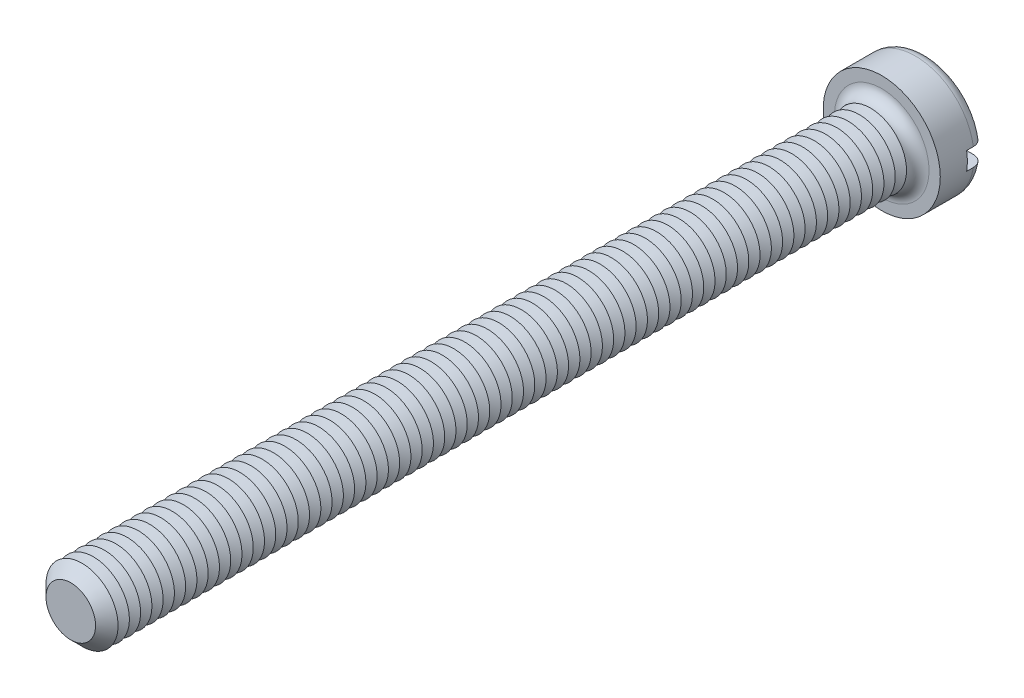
ISO-10303-21;
HEADER;
FILE_DESCRIPTION(('STEP AP214'),'2;1');
FILE_NAME('part.step','',(''),(''),'','','');
FILE_SCHEMA(('AUTOMOTIVE_DESIGN { 1 0 10303 214 1 1 1 1 }'));
ENDSEC;
DATA;
#1=APPLICATION_CONTEXT('core data for automotive mechanical design processes');
#2=APPLICATION_PROTOCOL_DEFINITION('international standard','automotive_design',2000,#1);
#3=PRODUCT_CONTEXT('',#1,'mechanical');
#4=PRODUCT('Part','Part','',(#3));
#5=PRODUCT_RELATED_PRODUCT_CATEGORY('part','',(#4));
#6=PRODUCT_DEFINITION_FORMATION('','',#4);
#7=PRODUCT_DEFINITION_CONTEXT('part definition',#1,'design');
#8=PRODUCT_DEFINITION('design','',#6,#7);
#9=PRODUCT_DEFINITION_SHAPE('','',#8);
#10=(LENGTH_UNIT() NAMED_UNIT(*) SI_UNIT(.MILLI.,.METRE.));
#11=(NAMED_UNIT(*) PLANE_ANGLE_UNIT() SI_UNIT($,.RADIAN.));
#12=(NAMED_UNIT(*) SI_UNIT($,.STERADIAN.) SOLID_ANGLE_UNIT());
#13=UNCERTAINTY_MEASURE_WITH_UNIT(LENGTH_MEASURE(1.E-05),#10,'distance_accuracy_value','');
#14=(GEOMETRIC_REPRESENTATION_CONTEXT(3) GLOBAL_UNCERTAINTY_ASSIGNED_CONTEXT((#13)) GLOBAL_UNIT_ASSIGNED_CONTEXT((#10,
#11,#12)) REPRESENTATION_CONTEXT('',''));
#15=CARTESIAN_POINT('',(0.,0.,0.));
#16=DIRECTION('',(0.,0.,1.));
#17=DIRECTION('',(1.,0.,0.));
#18=AXIS2_PLACEMENT_3D('',#15,#16,#17);
#19=CARTESIAN_POINT('',(0.,0.,-5.));
#20=DIRECTION('',(0.,0.,1.));
#21=DIRECTION('',(1.,0.,0.));
#22=AXIS2_PLACEMENT_3D('',#19,#20,#21);
#23=PLANE('',#22);
#24=CARTESIAN_POINT('',(0.,0.,-5.));
#25=DIRECTION('',(0.,0.,1.));
#26=DIRECTION('',(1.,0.,0.));
#27=AXIS2_PLACEMENT_3D('',#24,#25,#26);
#28=CIRCLE('',#27,5.25);
#29=CARTESIAN_POINT('',(-5.15388203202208,1.,-5.));
#30=VERTEX_POINT('',#29);
#31=CARTESIAN_POINT('',(5.15388203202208,1.,-5.));
#32=VERTEX_POINT('',#31);
#33=EDGE_CURVE('E116',#30,#32,#28,.F.);
#34=ORIENTED_EDGE('',*,*,#33,.T.);
#35=DIRECTION('',(1.,0.,0.));
#36=VECTOR('',#35,1.);
#37=CARTESIAN_POINT('',(-6.5,1.,-5.));
#38=LINE('',#37,#36);
#39=EDGE_CURVE('E111',#30,#32,#38,.T.);
#40=ORIENTED_EDGE('',*,*,#39,.F.);
#41=EDGE_LOOP('',(#34,#40));
#42=FACE_BOUND('',#41,.T.);
#43=ADVANCED_FACE('F39',(#42),#23,.F.);
#44=CARTESIAN_POINT('',(0.,0.,-3.75));
#45=DIRECTION('',(0.,0.,1.));
#46=DIRECTION('',(1.,0.,0.));
#47=AXIS2_PLACEMENT_3D('',#44,#45,#46);
#48=TOROIDAL_SURFACE('',#47,5.25,1.25);
#49=CARTESIAN_POINT('',(-6.04655789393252,1.,-4.63904490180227));
#50=CARTESIAN_POINT('',(-5.99546860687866,1.,-4.68885774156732));
#51=CARTESIAN_POINT('',(-5.94008472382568,1.,-4.73434760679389));
#52=CARTESIAN_POINT('',(-5.8223927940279,1.,-4.81538052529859));
#53=CARTESIAN_POINT('',(-5.7600753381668,1.,-4.85090982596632));
#54=CARTESIAN_POINT('',(-5.63044351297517,1.,-4.91100606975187));
#55=CARTESIAN_POINT('',(-5.56313479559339,1.,-4.93558519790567));
#56=CARTESIAN_POINT('',(-5.42539577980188,1.,-4.97322457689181));
#57=CARTESIAN_POINT('',(-5.35496625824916,1.,-4.98628767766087));
#58=CARTESIAN_POINT('',(-5.21212635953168,1.,-5.00070478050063));
#59=CARTESIAN_POINT('',(-5.13970265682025,1.,-5.00192674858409));
#60=CARTESIAN_POINT('',(-4.99565121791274,1.,-4.99234085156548));
#61=CARTESIAN_POINT('',(-4.92402357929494,1.,-4.98153152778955));
#62=CARTESIAN_POINT('',(-4.78274786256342,1.,-4.94801424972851));
#63=CARTESIAN_POINT('',(-4.71313137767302,1.,-4.92517296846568));
#64=CARTESIAN_POINT('',(-4.57871041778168,1.,-4.86813760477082));
#65=CARTESIAN_POINT('',(-4.51390612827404,1.,-4.83394308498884));
#66=CARTESIAN_POINT('',(-4.39095493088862,1.,-4.75508341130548));
#67=CARTESIAN_POINT('',(-4.33281197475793,1.,-4.7104120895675));
#68=CARTESIAN_POINT('',(-4.22499800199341,1.,-4.61179869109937));
#69=CARTESIAN_POINT('',(-4.17532640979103,1.,-4.55785724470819));
#70=CARTESIAN_POINT('',(-4.08677450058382,1.,-4.4431082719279));
#71=CARTESIAN_POINT('',(-4.0477350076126,1.,-4.38242369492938));
#72=CARTESIAN_POINT('',(-3.98074296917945,1.,-4.25521412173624));
#73=CARTESIAN_POINT('',(-3.95278836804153,1.,-4.18869021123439));
#74=CARTESIAN_POINT('',(-3.90959497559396,1.,-4.0537026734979));
#75=CARTESIAN_POINT('',(-3.89401985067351,1.,-3.98534663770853));
#76=CARTESIAN_POINT('',(-3.8748586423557,1.,-3.84697740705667));
#77=CARTESIAN_POINT('',(-3.87127067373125,1.,-3.7769644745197));
#78=CARTESIAN_POINT('',(-3.8761573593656,1.,-3.63892215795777));
#79=CARTESIAN_POINT('',(-3.88436651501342,1.,-3.57088319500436));
#80=CARTESIAN_POINT('',(-3.91207743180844,1.,-3.43714958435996));
#81=CARTESIAN_POINT('',(-3.93157911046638,1.,-3.37145491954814));
#82=CARTESIAN_POINT('',(-3.98125045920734,1.,-3.24411474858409));
#83=CARTESIAN_POINT('',(-4.01143761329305,1.,-3.18247607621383));
#84=CARTESIAN_POINT('',(-4.08150210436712,1.,-3.064981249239));
#85=CARTESIAN_POINT('',(-4.12138048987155,1.,-3.0091257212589));
#86=CARTESIAN_POINT('',(-4.2106718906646,1.,-2.90336353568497));
#87=CARTESIAN_POINT('',(-4.26028693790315,1.,-2.85362751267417));
#88=CARTESIAN_POINT('',(-4.36696587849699,1.,-2.76291710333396));
#89=CARTESIAN_POINT('',(-4.42403082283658,1.,-2.72194395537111));
#90=CARTESIAN_POINT('',(-4.54567957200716,1.,-2.64877280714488));
#91=CARTESIAN_POINT('',(-4.61042643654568,1.,-2.61684571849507));
#92=CARTESIAN_POINT('',(-4.74430563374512,1.,-2.56412359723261));
#93=CARTESIAN_POINT('',(-4.81343838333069,1.,-2.54332962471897));
#94=CARTESIAN_POINT('',(-4.95527237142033,1.,-2.51320471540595));
#95=CARTESIAN_POINT('',(-5.0280120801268,1.,-2.50405449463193));
#96=CARTESIAN_POINT('',(-5.17399775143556,1.,-2.49810126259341));
#97=CARTESIAN_POINT('',(-5.24724372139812,1.,-2.50129843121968));
#98=CARTESIAN_POINT('',(-5.3921014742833,1.,-2.52000776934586));
#99=CARTESIAN_POINT('',(-5.4637142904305,1.,-2.53551191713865));
#100=CARTESIAN_POINT('',(-5.60326680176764,1.,-2.57846304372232));
#101=CARTESIAN_POINT('',(-5.67120668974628,1.,-2.60590939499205));
#102=CARTESIAN_POINT('',(-5.80064060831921,1.,-2.67164926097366));
#103=CARTESIAN_POINT('',(-5.862199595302,1.,-2.7098148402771));
#104=CARTESIAN_POINT('',(-5.9779079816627,1.,-2.79608690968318));
#105=CARTESIAN_POINT('',(-6.03205795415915,1.,-2.84419263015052));
#106=CARTESIAN_POINT('',(-6.13055119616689,1.,-2.94820522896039));
#107=CARTESIAN_POINT('',(-6.17502887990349,1.,-3.00398483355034));
#108=CARTESIAN_POINT('',(-6.25384180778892,1.,-3.12230113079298));
#109=CARTESIAN_POINT('',(-6.28817779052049,1.,-3.18483733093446));
#110=CARTESIAN_POINT('',(-6.34527986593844,1.,-3.31401726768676));
#111=CARTESIAN_POINT('',(-6.36818984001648,1.,-3.38059742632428));
#112=CARTESIAN_POINT('',(-6.40240470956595,1.,-3.5166725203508));
#113=CARTESIAN_POINT('',(-6.41371067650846,1.,-3.58616718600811));
#114=CARTESIAN_POINT('',(-6.42433240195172,1.,-3.72550026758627));
#115=CARTESIAN_POINT('',(-6.4237441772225,1.,-3.79533138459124));
#116=CARTESIAN_POINT('',(-6.41082814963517,1.,-3.93391789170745));
#117=CARTESIAN_POINT('',(-6.39849757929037,1.,-4.00267302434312));
#118=CARTESIAN_POINT('',(-6.36249191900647,1.,-4.13704597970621));
#119=CARTESIAN_POINT('',(-6.33883072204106,1.,-4.20266753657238));
#120=CARTESIAN_POINT('',(-6.28088769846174,1.,-4.32897165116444));
#121=CARTESIAN_POINT('',(-6.24661890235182,1.,-4.38966015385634));
#122=CARTESIAN_POINT('',(-6.18404039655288,1.,-4.48163773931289));
#123=CARTESIAN_POINT('',(-6.15876600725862,1.,-4.51503333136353));
#124=CARTESIAN_POINT('',(-6.10500607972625,1.,-4.5791298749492));
#125=CARTESIAN_POINT('',(-6.07652056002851,1.,-4.60983084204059));
#126=CARTESIAN_POINT('',(-6.04655789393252,1.,-4.63904490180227));
#127=B_SPLINE_CURVE_WITH_KNOTS('',3,(#49,#50,#51,#52,#53,#54,#55,#56,#57,#58,#59,#60,#61,#62,
#63,#64,#65,#66,#67,#68,#69,#70,#71,#72,#73,#74,#75,#76,#77,#78,#79,#80,#81,#82,#83,#84,#85,#86,
#87,#88,#89,#90,#91,#92,#93,#94,#95,#96,#97,#98,#99,#100,#101,#102,#103,#104,#105,#106,#107,
#108,#109,#110,#111,#112,#113,#114,#115,#116,#117,#118,#119,#120,#121,#122,#123,#124,#125,#126),
.UNSPECIFIED.,.T.,.F.,(4,2,2,2,2,2,2,2,2,2,2,2,2,2,2,2,2,2,2,2,2,2,2,2,2,2,2,2,2,2,2,2,2,2,2,2,
2,2,4),(0.,0.213907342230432,0.428108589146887,0.642070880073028,0.855980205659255,
1.07227200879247,1.28859003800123,1.50735715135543,1.72613269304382,1.94503735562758,
2.16392713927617,2.37933295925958,2.59469881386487,2.80399176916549,3.01325180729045,
3.2178754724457,3.42249764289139,3.62745618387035,3.83243690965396,4.04223444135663,
4.25206160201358,4.46763253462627,4.68322399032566,4.90212226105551,5.12102372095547,
5.33978261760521,5.55853002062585,5.77477015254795,5.99099354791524,6.20398686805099,
6.41696467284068,6.62718821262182,6.83739233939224,7.0459002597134,7.25445733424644,
7.46275934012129,7.67080647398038,7.79625882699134,7.92171045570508),.UNSPECIFIED.);
#128=CARTESIAN_POINT('',(-6.42261628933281,1.,-3.74999999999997));
#129=VERTEX_POINT('',#128);
#130=EDGE_CURVE('E738',#129,#30,#127,.T.);
#131=ORIENTED_EDGE('',*,*,#130,.F.);
#132=CARTESIAN_POINT('',(0.,0.,-3.75));
#133=DIRECTION('',(0.,0.,1.));
#134=DIRECTION('',(1.,0.,0.));
#135=AXIS2_PLACEMENT_3D('',#132,#133,#134);
#136=CIRCLE('',#135,6.5);
#137=CARTESIAN_POINT('',(6.42261628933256,1.,-3.75));
#138=VERTEX_POINT('',#137);
#139=EDGE_CURVE('E124',#138,#129,#136,.T.);
#140=ORIENTED_EDGE('',*,*,#139,.F.);
#141=CARTESIAN_POINT('',(4.06944999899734,1.,-4.4133199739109));
#142=CARTESIAN_POINT('',(4.10828271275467,1.,-4.47354709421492));
#143=CARTESIAN_POINT('',(4.15233880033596,1.,-4.53047894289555));
#144=CARTESIAN_POINT('',(4.24946916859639,1.,-4.63614530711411));
#145=CARTESIAN_POINT('',(4.3025574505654,1.,-4.68486685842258));
#146=CARTESIAN_POINT('',(4.41603250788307,1.,-4.77271114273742));
#147=CARTESIAN_POINT('',(4.47640839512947,1.,-4.8118479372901));
#148=CARTESIAN_POINT('',(4.60277035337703,1.,-4.87959878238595));
#149=CARTESIAN_POINT('',(4.66875480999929,1.,-4.90821584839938));
#150=CARTESIAN_POINT('',(4.80558589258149,1.,-4.95456537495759));
#151=CARTESIAN_POINT('',(4.87649196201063,1.,-4.97212253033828));
#152=CARTESIAN_POINT('',(5.02024710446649,1.,-4.99514979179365));
#153=CARTESIAN_POINT('',(5.09309636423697,1.,-5.00061873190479));
#154=CARTESIAN_POINT('',(5.23902872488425,1.,-4.99926689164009));
#155=CARTESIAN_POINT('',(5.31211131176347,1.,-4.99238812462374));
#156=CARTESIAN_POINT('',(5.45605806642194,1.,-4.96635140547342));
#157=CARTESIAN_POINT('',(5.52692231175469,1.,-4.94719388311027));
#158=CARTESIAN_POINT('',(5.66376170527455,1.,-4.89728421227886));
#159=CARTESIAN_POINT('',(5.72977335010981,1.,-4.86663219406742));
#160=CARTESIAN_POINT('',(5.85560715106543,1.,-4.79452334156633));
#161=CARTESIAN_POINT('',(5.91542977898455,1.,-4.7530673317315));
#162=CARTESIAN_POINT('',(6.02626022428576,1.,-4.66116821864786));
#163=CARTESIAN_POINT('',(6.07738307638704,1.,-4.6108638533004));
#164=CARTESIAN_POINT('',(6.17030947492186,1.,-4.50227823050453));
#165=CARTESIAN_POINT('',(6.2121137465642,1.,-4.44399759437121));
#166=CARTESIAN_POINT('',(6.28460268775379,1.,-4.32200305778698));
#167=CARTESIAN_POINT('',(6.31543589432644,1.,-4.2583773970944));
#168=CARTESIAN_POINT('',(6.36586009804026,1.,-4.12681721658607));
#169=CARTESIAN_POINT('',(6.38545178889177,1.,-4.0588829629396));
#170=CARTESIAN_POINT('',(6.41265760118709,1.,-3.92136007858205));
#171=CARTESIAN_POINT('',(6.42038873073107,1.,-3.85179457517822));
#172=CARTESIAN_POINT('',(6.42401070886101,1.,-3.7123569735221));
#173=CARTESIAN_POINT('',(6.41990193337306,1.,-3.64248488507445));
#174=CARTESIAN_POINT('',(6.40000894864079,1.,-3.50470871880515));
#175=CARTESIAN_POINT('',(6.38427119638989,1.,-3.43679792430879));
#176=CARTESIAN_POINT('',(6.34164491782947,1.,-3.30457296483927));
#177=CARTESIAN_POINT('',(6.31475638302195,1.,-3.24025880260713));
#178=CARTESIAN_POINT('',(6.2505455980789,1.,-3.11686791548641));
#179=CARTESIAN_POINT('',(6.21319759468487,1.,-3.05780459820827));
#180=CARTESIAN_POINT('',(6.12919411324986,1.,-2.94671919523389));
#181=CARTESIAN_POINT('',(6.08253833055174,1.,-2.89469734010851));
#182=CARTESIAN_POINT('',(5.98083387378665,1.,-2.79868150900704));
#183=CARTESIAN_POINT('',(5.92571704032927,1.,-2.75475975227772));
#184=CARTESIAN_POINT('',(5.80897194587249,1.,-2.67665277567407));
#185=CARTESIAN_POINT('',(5.74734329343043,1.,-2.64246814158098));
#186=CARTESIAN_POINT('',(5.6184644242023,1.,-2.58431810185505));
#187=CARTESIAN_POINT('',(5.55115102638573,1.,-2.56049275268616));
#188=CARTESIAN_POINT('',(5.41351272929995,1.,-2.52429868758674));
#189=CARTESIAN_POINT('',(5.34318759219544,1.,-2.51193087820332));
#190=CARTESIAN_POINT('',(5.20041507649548,1.,-2.49882112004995));
#191=CARTESIAN_POINT('',(5.12795169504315,1.,-2.49825332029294));
#192=CARTESIAN_POINT('',(4.98393373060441,1.,-2.50914771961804));
#193=CARTESIAN_POINT('',(4.91237921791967,1.,-2.52061084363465));
#194=CARTESIAN_POINT('',(4.77137358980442,1.,-2.55542281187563));
#195=CARTESIAN_POINT('',(4.70195472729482,1.,-2.57890245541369));
#196=CARTESIAN_POINT('',(4.56803538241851,1.,-2.63717701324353));
#197=CARTESIAN_POINT('',(4.50353509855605,1.,-2.67197238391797));
#198=CARTESIAN_POINT('',(4.38131858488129,1.,-2.7519648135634));
#199=CARTESIAN_POINT('',(4.32360365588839,1.,-2.79716386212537));
#200=CARTESIAN_POINT('',(4.21673400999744,1.,-2.89675634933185));
#201=CARTESIAN_POINT('',(4.16757871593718,1.,-2.95114916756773));
#202=CARTESIAN_POINT('',(4.08014713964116,1.,-3.06667703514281));
#203=CARTESIAN_POINT('',(4.04170608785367,1.,-3.12768727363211));
#204=CARTESIAN_POINT('',(3.97596192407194,1.,-3.25543782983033));
#205=CARTESIAN_POINT('',(3.94865624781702,1.,-3.32217682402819));
#206=CARTESIAN_POINT('',(3.9067737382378,1.,-3.45745603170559));
#207=CARTESIAN_POINT('',(3.89185707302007,1.,-3.52589108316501));
#208=CARTESIAN_POINT('',(3.87400755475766,1.,-3.66432360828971));
#209=CARTESIAN_POINT('',(3.87107601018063,1.,-3.73432125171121));
#210=CARTESIAN_POINT('',(3.8772387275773,1.,-3.87228267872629));
#211=CARTESIAN_POINT('',(3.88607933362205,1.,-3.94025811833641));
#212=CARTESIAN_POINT('',(3.91502769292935,1.,-4.07370133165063));
#213=CARTESIAN_POINT('',(3.93512131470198,1.,-4.1391721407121));
#214=CARTESIAN_POINT('',(3.9752037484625,1.,-4.23926719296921));
#215=CARTESIAN_POINT('',(3.99171171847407,1.,-4.27532618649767));
#216=CARTESIAN_POINT('',(4.02809737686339,1.,-4.34569933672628));
#217=CARTESIAN_POINT('',(4.04797497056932,1.,-4.3800135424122));
#218=CARTESIAN_POINT('',(4.06944999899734,1.,-4.4133199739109));
#219=B_SPLINE_CURVE_WITH_KNOTS('',3,(#141,#142,#143,#144,#145,#146,#147,#148,#149,#150,#151,
#152,#153,#154,#155,#156,#157,#158,#159,#160,#161,#162,#163,#164,#165,#166,#167,#168,#169,#170,
#171,#172,#173,#174,#175,#176,#177,#178,#179,#180,#181,#182,#183,#184,#185,#186,#187,#188,#189,
#190,#191,#192,#193,#194,#195,#196,#197,#198,#199,#200,#201,#202,#203,#204,#205,#206,#207,#208,
#209,#210,#211,#212,#213,#214,#215,#216,#217,#218),.UNSPECIFIED.,.T.,.F.,(4,2,2,2,2,2,2,2,2,2,2,
2,2,2,2,2,2,2,2,2,2,2,2,2,2,2,2,2,2,2,2,2,2,2,2,2,2,2,4),(0.,0.214833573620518,
0.430003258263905,0.644855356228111,0.859645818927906,1.0777603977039,1.29589601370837,
1.51505870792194,1.73421373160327,1.95150241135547,2.16877451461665,2.38290237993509,
2.59701357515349,2.8081044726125,3.01918234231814,3.22816416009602,3.43713934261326,
3.64528416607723,3.85342914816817,4.06209119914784,4.27076008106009,4.48120788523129,
4.69166834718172,4.90489186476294,5.11813225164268,5.33451752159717,5.55091942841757,
5.76972860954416,5.98854661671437,6.20740650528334,6.42625163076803,6.64151774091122,
6.85673425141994,7.0658317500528,7.27495207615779,7.47963858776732,7.68406862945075,
7.80287790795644,7.92168384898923),.UNSPECIFIED.);
#220=EDGE_CURVE('E740',#32,#138,#219,.T.);
#221=ORIENTED_EDGE('',*,*,#220,.F.);
#222=ORIENTED_EDGE('',*,*,#33,.F.);
#223=EDGE_LOOP('',(#131,#140,#221,#222));
#224=FACE_BOUND('',#223,.T.);
#225=ADVANCED_FACE('F722',(#224),#48,.T.);
#226=CARTESIAN_POINT('',(0.,0.,-5.));
#227=DIRECTION('',(0.,0.,1.));
#228=DIRECTION('',(1.,0.,0.));
#229=AXIS2_PLACEMENT_3D('',#226,#227,#228);
#230=CYLINDRICAL_SURFACE('',#229,6.5);
#231=DIRECTION('',(0.,0.,1.));
#232=VECTOR('',#231,1.);
#233=CARTESIAN_POINT('',(6.42261628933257,1.,-5.));
#234=LINE('',#233,#232);
#235=CARTESIAN_POINT('',(6.42261628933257,1.,-3.));
#236=VERTEX_POINT('',#235);
#237=EDGE_CURVE('E756',#138,#236,#234,.T.);
#238=ORIENTED_EDGE('',*,*,#237,.F.);
#239=ORIENTED_EDGE('',*,*,#139,.T.);
#240=DIRECTION('',(0.,0.,1.));
#241=VECTOR('',#240,1.);
#242=CARTESIAN_POINT('',(-6.42261628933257,1.,-5.));
#243=LINE('',#242,#241);
#244=CARTESIAN_POINT('',(-6.42261628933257,1.,-3.));
#245=VERTEX_POINT('',#244);
#246=EDGE_CURVE('E63',#245,#129,#243,.F.);
#247=ORIENTED_EDGE('',*,*,#246,.F.);
#248=CARTESIAN_POINT('',(0.,0.,-3.));
#249=DIRECTION('',(0.,0.,-1.));
#250=DIRECTION('',(-1.,0.,0.));
#251=AXIS2_PLACEMENT_3D('',#248,#249,#250);
#252=CIRCLE('',#251,6.5);
#253=CARTESIAN_POINT('',(-6.42261628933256,-0.999999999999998,-3.));
#254=VERTEX_POINT('',#253);
#255=EDGE_CURVE('E43',#245,#254,#252,.F.);
#256=ORIENTED_EDGE('',*,*,#255,.T.);
#257=DIRECTION('',(0.,0.,1.));
#258=VECTOR('',#257,1.);
#259=CARTESIAN_POINT('',(-6.42261628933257,-0.999999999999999,-5.));
#260=LINE('',#259,#258);
#261=CARTESIAN_POINT('',(-6.42261628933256,-0.999999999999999,-3.75));
#262=VERTEX_POINT('',#261);
#263=EDGE_CURVE('E753',#262,#254,#260,.T.);
#264=ORIENTED_EDGE('',*,*,#263,.F.);
#265=CARTESIAN_POINT('',(6.42261628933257,-1.,-3.75));
#266=VERTEX_POINT('',#265);
#267=EDGE_CURVE('E126',#262,#266,#136,.T.);
#268=ORIENTED_EDGE('',*,*,#267,.T.);
#269=DIRECTION('',(0.,0.,1.));
#270=VECTOR('',#269,1.);
#271=CARTESIAN_POINT('',(6.42261628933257,-1.,-5.));
#272=LINE('',#271,#270);
#273=CARTESIAN_POINT('',(6.42261628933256,-1.,-3.));
#274=VERTEX_POINT('',#273);
#275=EDGE_CURVE('E55',#274,#266,#272,.F.);
#276=ORIENTED_EDGE('',*,*,#275,.F.);
#277=EDGE_CURVE('E11',#274,#236,#252,.F.);
#278=ORIENTED_EDGE('',*,*,#277,.T.);
#279=EDGE_LOOP('',(#238,#239,#247,#256,#264,#268,#276,#278));
#280=FACE_BOUND('',#279,.T.);
#281=CARTESIAN_POINT('',(0.,0.,0.));
#282=DIRECTION('',(0.,0.,1.));
#283=DIRECTION('',(1.,0.,0.));
#284=AXIS2_PLACEMENT_3D('',#281,#282,#283);
#285=CIRCLE('',#284,6.5);
#286=CARTESIAN_POINT('',(6.5,0.,0.));
#287=VERTEX_POINT('',#286);
#288=EDGE_CURVE('E759',#287,#287,#285,.T.);
#289=ORIENTED_EDGE('',*,*,#288,.F.);
#290=EDGE_LOOP('',(#289));
#291=FACE_BOUND('',#290,.T.);
#292=ADVANCED_FACE('F718',(#280,#291),#230,.T.);
#293=CARTESIAN_POINT('',(5.15388203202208,-1.,-5.));
#294=VERTEX_POINT('',#293);
#295=CARTESIAN_POINT('',(-5.15388203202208,-0.999999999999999,-5.));
#296=VERTEX_POINT('',#295);
#297=EDGE_CURVE('E109',#294,#296,#28,.F.);
#298=ORIENTED_EDGE('',*,*,#297,.T.);
#299=DIRECTION('',(-1.,0.,0.));
#300=VECTOR('',#299,1.);
#301=CARTESIAN_POINT('',(-6.5,-0.999999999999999,-5.));
#302=LINE('',#301,#300);
#303=EDGE_CURVE('E96',#294,#296,#302,.T.);
#304=ORIENTED_EDGE('',*,*,#303,.F.);
#305=EDGE_LOOP('',(#298,#304));
#306=FACE_BOUND('',#305,.T.);
#307=ADVANCED_FACE('F108',(#306),#23,.F.);
#308=CARTESIAN_POINT('',(0.,0.,0.));
#309=DIRECTION('',(0.,0.,1.));
#310=DIRECTION('',(1.,0.,0.));
#311=AXIS2_PLACEMENT_3D('',#308,#309,#310);
#312=PLANE('',#311);
#313=CARTESIAN_POINT('',(0.,0.,0.));
#314=DIRECTION('',(0.,0.,1.));
#315=DIRECTION('',(1.,0.,0.));
#316=AXIS2_PLACEMENT_3D('',#313,#314,#315);
#317=CIRCLE('',#316,5.25);
#318=CARTESIAN_POINT('',(5.25,0.,0.));
#319=VERTEX_POINT('',#318);
#320=EDGE_CURVE('E115',#319,#319,#317,.F.);
#321=ORIENTED_EDGE('',*,*,#320,.T.);
#322=EDGE_LOOP('',(#321));
#323=FACE_BOUND('',#322,.T.);
#324=ORIENTED_EDGE('',*,*,#288,.T.);
#325=EDGE_LOOP('',(#324));
#326=FACE_BOUND('',#325,.T.);
#327=ADVANCED_FACE('F717',(#323,#326),#312,.T.);
#328=CARTESIAN_POINT('',(-6.04655789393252,-0.999999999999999,-4.63904490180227));
#329=CARTESIAN_POINT('',(-6.0966604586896,-0.999999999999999,-4.59018532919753));
#330=CARTESIAN_POINT('',(-6.14270501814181,-0.999999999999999,-4.53709744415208));
#331=CARTESIAN_POINT('',(-6.22528519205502,-0.999999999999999,-4.42391631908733));
#332=CARTESIAN_POINT('',(-6.26181074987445,-0.999999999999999,-4.36381576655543));
#333=CARTESIAN_POINT('',(-6.32422109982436,-0.999999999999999,-4.23831836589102));
#334=CARTESIAN_POINT('',(-6.35010658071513,-0.999999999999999,-4.17292186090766));
#335=CARTESIAN_POINT('',(-6.39044668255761,-0.999999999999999,-4.03870925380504));
#336=CARTESIAN_POINT('',(-6.40490396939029,-0.999999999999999,-3.96989395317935));
#337=CARTESIAN_POINT('',(-6.42190814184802,-0.999999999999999,-3.83122595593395));
#338=CARTESIAN_POINT('',(-6.4245257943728,-0.999999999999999,-3.76138193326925));
#339=CARTESIAN_POINT('',(-6.41796432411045,-0.999999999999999,-3.62224935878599));
#340=CARTESIAN_POINT('',(-6.40878509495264,-0.999999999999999,-3.55296081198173));
#341=CARTESIAN_POINT('',(-6.37894560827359,-0.999999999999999,-3.41709241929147));
#342=CARTESIAN_POINT('',(-6.35831520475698,-0.999999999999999,-3.35050601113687));
#343=CARTESIAN_POINT('',(-6.30620980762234,-0.999999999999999,-3.22172312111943));
#344=CARTESIAN_POINT('',(-6.2747347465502,-0.999999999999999,-3.15952666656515));
#345=CARTESIAN_POINT('',(-6.20172710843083,-0.999999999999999,-3.04101762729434));
#346=CARTESIAN_POINT('',(-6.16015622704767,-0.999999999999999,-2.98472864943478));
#347=CARTESIAN_POINT('',(-6.06823774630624,-0.999999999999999,-2.87984578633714));
#348=CARTESIAN_POINT('',(-6.01788981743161,-0.999999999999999,-2.83125219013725));
#349=CARTESIAN_POINT('',(-5.90933830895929,-0.999999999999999,-2.74262118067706));
#350=CARTESIAN_POINT('',(-5.85106338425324,-0.999999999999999,-2.70267117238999));
#351=CARTESIAN_POINT('',(-5.72870702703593,-0.999999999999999,-2.63296796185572));
#352=CARTESIAN_POINT('',(-5.66462521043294,-0.999999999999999,-2.6032154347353));
#353=CARTESIAN_POINT('',(-5.53153273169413,-0.999999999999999,-2.55430842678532));
#354=CARTESIAN_POINT('',(-5.46246626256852,-0.999999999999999,-2.53530583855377));
#355=CARTESIAN_POINT('',(-5.32214267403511,-0.999999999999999,-2.5089831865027));
#356=CARTESIAN_POINT('',(-5.25088537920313,-0.999999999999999,-2.50166406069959));
#357=CARTESIAN_POINT('',(-5.10710123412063,-0.999999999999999,-2.49882202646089));
#358=CARTESIAN_POINT('',(-5.03457095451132,-0.999999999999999,-2.50347166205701));
#359=CARTESIAN_POINT('',(-4.8912897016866,-0.999999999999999,-2.52476029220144));
#360=CARTESIAN_POINT('',(-4.82053886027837,-0.999999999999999,-2.54140017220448));
#361=CARTESIAN_POINT('',(-4.68213257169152,-0.999999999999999,-2.58641614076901));
#362=CARTESIAN_POINT('',(-4.61451256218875,-0.999999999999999,-2.61490131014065));
#363=CARTESIAN_POINT('',(-4.48502801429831,-0.999999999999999,-2.68285095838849));
#364=CARTESIAN_POINT('',(-4.42316359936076,-0.999999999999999,-2.72231567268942));
#365=CARTESIAN_POINT('',(-4.30720694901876,-0.999999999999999,-2.81103994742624));
#366=CARTESIAN_POINT('',(-4.25309118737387,-0.999999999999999,-2.86026872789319));
#367=CARTESIAN_POINT('',(-4.15409408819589,-0.999999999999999,-2.9672764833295));
#368=CARTESIAN_POINT('',(-4.10921182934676,-0.999999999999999,-3.02505460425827));
#369=CARTESIAN_POINT('',(-4.03096584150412,-0.999999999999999,-3.14632492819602));
#370=CARTESIAN_POINT('',(-3.99739097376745,-0.999999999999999,-3.2096807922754));
#371=CARTESIAN_POINT('',(-3.94171839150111,-0.999999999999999,-3.34124912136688));
#372=CARTESIAN_POINT('',(-3.91961840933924,-0.999999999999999,-3.40946062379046));
#373=CARTESIAN_POINT('',(-3.88816636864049,-0.999999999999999,-3.54669256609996));
#374=CARTESIAN_POINT('',(-3.87846562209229,-0.999999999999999,-3.61563318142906));
#375=CARTESIAN_POINT('',(-3.87100568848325,-0.999999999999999,-3.75415397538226));
#376=CARTESIAN_POINT('',(-3.87324501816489,-0.999999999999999,-3.82373407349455));
#377=CARTESIAN_POINT('',(-3.88943589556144,-0.999999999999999,-3.96027701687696));
#378=CARTESIAN_POINT('',(-3.90318225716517,-0.999999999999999,-4.0272643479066));
#379=CARTESIAN_POINT('',(-3.94163954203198,-0.999999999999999,-4.1580093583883));
#380=CARTESIAN_POINT('',(-3.96635075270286,-0.999999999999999,-4.22176695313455));
#381=CARTESIAN_POINT('',(-4.026160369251,-0.999999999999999,-4.34483320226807));
#382=CARTESIAN_POINT('',(-4.06134035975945,-0.999999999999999,-4.40410214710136));
#383=CARTESIAN_POINT('',(-4.14090865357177,-0.999999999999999,-4.51609417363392));
#384=CARTESIAN_POINT('',(-4.18529811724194,-0.999999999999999,-4.56881642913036));
#385=CARTESIAN_POINT('',(-4.2832649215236,-0.999999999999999,-4.66770177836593));
#386=CARTESIAN_POINT('',(-4.33705327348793,-0.999999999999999,-4.71365579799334));
#387=CARTESIAN_POINT('',(-4.45141776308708,-0.999999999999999,-4.79615385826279));
#388=CARTESIAN_POINT('',(-4.51199483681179,-0.999999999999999,-4.83269659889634));
#389=CARTESIAN_POINT('',(-4.63989216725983,-0.999999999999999,-4.89626962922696));
#390=CARTESIAN_POINT('',(-4.70734508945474,-0.999999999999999,-4.92303326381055));
#391=CARTESIAN_POINT('',(-4.84575497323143,-0.999999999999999,-4.96500199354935));
#392=CARTESIAN_POINT('',(-4.91671207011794,-0.999999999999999,-4.98020664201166));
#393=CARTESIAN_POINT('',(-5.06097761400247,-0.999999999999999,-4.9987306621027));
#394=CARTESIAN_POINT('',(-5.13430353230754,-0.999999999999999,-5.00191441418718));
#395=CARTESIAN_POINT('',(-5.28046546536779,-0.999999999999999,-4.99587686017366));
#396=CARTESIAN_POINT('',(-5.35330135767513,-0.999999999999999,-4.98665256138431));
#397=CARTESIAN_POINT('',(-5.49610354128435,-0.999999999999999,-4.95604184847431));
#398=CARTESIAN_POINT('',(-5.56607890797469,-0.999999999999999,-4.93469772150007));
#399=CARTESIAN_POINT('',(-5.70131538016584,-0.999999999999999,-4.88041956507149));
#400=CARTESIAN_POINT('',(-5.76658233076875,-0.999999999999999,-4.84750021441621));
#401=CARTESIAN_POINT('',(-5.86782577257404,-0.999999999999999,-4.78498748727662));
#402=CARTESIAN_POINT('',(-5.90579749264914,-0.999999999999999,-4.75856648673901));
#403=CARTESIAN_POINT('',(-5.97862186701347,-0.999999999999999,-4.70172646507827));
#404=CARTESIAN_POINT('',(-6.0134745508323,-0.999999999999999,-4.6713074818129));
#405=CARTESIAN_POINT('',(-6.04655789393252,-0.999999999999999,-4.63904490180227));
#406=B_SPLINE_CURVE_WITH_KNOTS('',3,(#328,#329,#330,#331,#332,#333,#334,#335,#336,#337,#338,
#339,#340,#341,#342,#343,#344,#345,#346,#347,#348,#349,#350,#351,#352,#353,#354,#355,#356,#357,
#358,#359,#360,#361,#362,#363,#364,#365,#366,#367,#368,#369,#370,#371,#372,#373,#374,#375,#376,
#377,#378,#379,#380,#381,#382,#383,#384,#385,#386,#387,#388,#389,#390,#391,#392,#393,#394,#395,
#396,#397,#398,#399,#400,#401,#402,#403,#404,#405),.UNSPECIFIED.,.T.,.F.,(4,2,2,2,2,2,2,2,2,2,2,
2,2,2,2,2,2,2,2,2,2,2,2,2,2,2,2,2,2,2,2,2,2,2,2,2,2,2,4),(0.,0.209780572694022,
0.419781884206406,0.629769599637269,0.839708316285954,1.04839053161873,1.2570746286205,
1.46521720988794,1.67336108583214,1.88230736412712,2.09126148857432,2.30223890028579,
2.51323027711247,2.72713284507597,2.94105258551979,3.15807345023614,3.37511034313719,
3.59419176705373,3.81327788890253,4.03168404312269,4.25006839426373,4.46411376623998,
4.67811682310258,4.88595885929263,5.09377507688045,5.29796268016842,5.50215563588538,
5.70798353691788,5.91383738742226,6.12510741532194,6.33640661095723,6.55309998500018,
6.76980173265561,6.98894112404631,7.20813337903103,7.42656551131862,7.64472163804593,
7.78324365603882,7.92176436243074),.UNSPECIFIED.);
#407=EDGE_CURVE('E103',#296,#262,#406,.T.);
#408=ORIENTED_EDGE('',*,*,#407,.F.);
#409=ORIENTED_EDGE('',*,*,#297,.F.);
#410=CARTESIAN_POINT('',(4.06944999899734,-1.,-4.4133199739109));
#411=CARTESIAN_POINT('',(4.03213207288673,-1.,-4.3554312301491));
#412=CARTESIAN_POINT('',(3.9995849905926,-1.,-4.29441722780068));
#413=CARTESIAN_POINT('',(3.94511822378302,-1.,-4.16776604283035));
#414=CARTESIAN_POINT('',(3.92320762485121,-1.,-4.10212496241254));
#415=CARTESIAN_POINT('',(3.89078811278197,-1.,-3.96804412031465));
#416=CARTESIAN_POINT('',(3.88028409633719,-1.,-3.89960316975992));
#417=CARTESIAN_POINT('',(3.87107895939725,-1.,-3.76194650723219));
#418=CARTESIAN_POINT('',(3.87237511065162,-1.,-3.69273097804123));
#419=CARTESIAN_POINT('',(3.88662927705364,-1.,-3.55634460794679));
#420=CARTESIAN_POINT('',(3.89944923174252,-1.,-3.48915926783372));
#421=CARTESIAN_POINT('',(3.93611188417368,-1.,-3.35786953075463));
#422=CARTESIAN_POINT('',(3.95995518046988,-1.,-3.29376530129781));
#423=CARTESIAN_POINT('',(4.0180748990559,-1.,-3.16993562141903));
#424=CARTESIAN_POINT('',(4.05242297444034,-1.,-3.11024385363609));
#425=CARTESIAN_POINT('',(4.13041121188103,-1.,-2.9972793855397));
#426=CARTESIAN_POINT('',(4.17405248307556,-1.,-2.94400745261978));
#427=CARTESIAN_POINT('',(4.27058636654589,-1.,-2.8439150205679));
#428=CARTESIAN_POINT('',(4.32368948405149,-1.,-2.79729757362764));
#429=CARTESIAN_POINT('',(4.43679856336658,-1.,-2.71336600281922));
#430=CARTESIAN_POINT('',(4.49680546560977,-1.,-2.67605314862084));
#431=CARTESIAN_POINT('',(4.62370121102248,-1.,-2.61081752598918));
#432=CARTESIAN_POINT('',(4.69072799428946,-1.,-2.58316284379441));
#433=CARTESIAN_POINT('',(4.82843981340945,-1.,-2.5393441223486));
#434=CARTESIAN_POINT('',(4.899125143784,-1.,-2.52318100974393));
#435=CARTESIAN_POINT('',(5.04306377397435,-1.,-2.50267755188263));
#436=CARTESIAN_POINT('',(5.11633773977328,-1.,-2.49848181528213));
#437=CARTESIAN_POINT('',(5.26254809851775,-1.,-2.50249357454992));
#438=CARTESIAN_POINT('',(5.33548449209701,-1.,-2.51070104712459));
#439=CARTESIAN_POINT('',(5.4786703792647,-1.,-2.53930888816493));
#440=CARTESIAN_POINT('',(5.54892819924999,-1.,-2.5596675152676));
#441=CARTESIAN_POINT('',(5.68495799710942,-1.,-2.61204238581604));
#442=CARTESIAN_POINT('',(5.75073024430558,-1.,-2.64405792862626));
#443=CARTESIAN_POINT('',(5.8750178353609,-1.,-2.7184150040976));
#444=CARTESIAN_POINT('',(5.93361487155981,-1.,-2.76061995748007));
#445=CARTESIAN_POINT('',(6.04275377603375,-1.,-2.85440601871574));
#446=CARTESIAN_POINT('',(6.09329629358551,-1.,-2.90598637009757));
#447=CARTESIAN_POINT('',(6.18409572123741,-1.,-3.01622977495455));
#448=CARTESIAN_POINT('',(6.2244945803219,-1.,-3.07477592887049));
#449=CARTESIAN_POINT('',(6.29474798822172,-1.,-3.19788594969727));
#450=CARTESIAN_POINT('',(6.3246032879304,-1.,-3.26244938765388));
#451=CARTESIAN_POINT('',(6.37256001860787,-1.,-3.39491634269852));
#452=CARTESIAN_POINT('',(6.39079949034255,-1.,-3.46276990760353));
#453=CARTESIAN_POINT('',(6.41554133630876,-1.,-3.60058363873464));
#454=CARTESIAN_POINT('',(6.42204424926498,-1.,-3.67054370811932));
#455=CARTESIAN_POINT('',(6.42311237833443,-1.,-3.81007982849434));
#456=CARTESIAN_POINT('',(6.41775799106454,-1.,-3.879655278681));
#457=CARTESIAN_POINT('',(6.39543799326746,-1.,-4.01691664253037));
#458=CARTESIAN_POINT('',(6.3784725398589,-1.,-4.08460258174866));
#459=CARTESIAN_POINT('',(6.33344768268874,-1.,-4.21614537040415));
#460=CARTESIAN_POINT('',(6.30539273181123,-1.,-4.28000374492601));
#461=CARTESIAN_POINT('',(6.23902076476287,-1.,-4.40214140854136));
#462=CARTESIAN_POINT('',(6.20070356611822,-1.,-4.46042059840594));
#463=CARTESIAN_POINT('',(6.11467174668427,-1.,-4.5701315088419));
#464=CARTESIAN_POINT('',(6.06690270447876,-1.,-4.62152053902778));
#465=CARTESIAN_POINT('',(5.96350111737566,-1.,-4.715657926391));
#466=CARTESIAN_POINT('',(5.90786817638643,-1.,-4.75840584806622));
#467=CARTESIAN_POINT('',(5.78965380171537,-1.,-4.8345781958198));
#468=CARTESIAN_POINT('',(5.72700078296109,-1.,-4.86789149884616));
#469=CARTESIAN_POINT('',(5.59704977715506,-1.,-4.92369754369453));
#470=CARTESIAN_POINT('',(5.52975144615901,-1.,-4.94618948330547));
#471=CARTESIAN_POINT('',(5.39137621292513,-1.,-4.98006173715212));
#472=CARTESIAN_POINT('',(5.32025859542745,-1.,-4.99127571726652));
#473=CARTESIAN_POINT('',(5.17715081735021,-1.,-5.00177798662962));
#474=CARTESIAN_POINT('',(5.10516061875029,-1.,-5.00106575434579));
#475=CARTESIAN_POINT('',(4.96131924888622,-1.,-4.98769775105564));
#476=CARTESIAN_POINT('',(4.88948297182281,-1.,-4.97488146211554));
#477=CARTESIAN_POINT('',(4.74893184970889,-1.,-4.93744335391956));
#478=CARTESIAN_POINT('',(4.68021795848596,-1.,-4.91281795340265));
#479=CARTESIAN_POINT('',(4.54744428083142,-1.,-4.8522329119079));
#480=CARTESIAN_POINT('',(4.48341761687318,-1.,-4.81620070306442));
#481=CARTESIAN_POINT('',(4.36244497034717,-1.,-4.73383277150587));
#482=CARTESIAN_POINT('',(4.30549069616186,-1.,-4.68750929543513));
#483=CARTESIAN_POINT('',(4.21823158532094,-1.,-4.60311228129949));
#484=CARTESIAN_POINT('',(4.18544074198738,-1.,-4.56757118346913));
#485=CARTESIAN_POINT('',(4.12413461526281,-1.,-4.49297229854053));
#486=CARTESIAN_POINT('',(4.09561926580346,-1.,-4.45391456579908));
#487=CARTESIAN_POINT('',(4.06944999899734,-1.,-4.4133199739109));
#488=B_SPLINE_CURVE_WITH_KNOTS('',3,(#410,#411,#412,#413,#414,#415,#416,#417,#418,#419,#420,
#421,#422,#423,#424,#425,#426,#427,#428,#429,#430,#431,#432,#433,#434,#435,#436,#437,#438,#439,
#440,#441,#442,#443,#444,#445,#446,#447,#448,#449,#450,#451,#452,#453,#454,#455,#456,#457,#458,
#459,#460,#461,#462,#463,#464,#465,#466,#467,#468,#469,#470,#471,#472,#473,#474,#475,#476,#477,
#478,#479,#480,#481,#482,#483,#484,#485,#486,#487),.UNSPECIFIED.,.T.,.F.,(4,2,2,2,2,2,2,2,2,2,2,
2,2,2,2,2,2,2,2,2,2,2,2,2,2,2,2,2,2,2,2,2,2,2,2,2,2,2,4),(0.,0.206453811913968,0.4130836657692,
0.619802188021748,0.826472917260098,1.03070015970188,1.23493849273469,1.44060223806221,
1.64629054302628,1.85731119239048,2.06836062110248,2.28487349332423,2.5014038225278,
2.72053974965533,2.9396752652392,3.15806230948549,3.37643622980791,3.59203140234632,
3.80760918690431,4.01997696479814,4.23232961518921,4.44210913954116,4.65187903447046,
4.86023097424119,5.06858009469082,5.27684563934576,5.48511488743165,5.69462015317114,
5.90413597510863,6.11602561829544,6.32793096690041,6.54291770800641,6.75791385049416,
6.97580180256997,7.19375587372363,7.41312537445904,7.63223520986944,7.77701357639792,
7.92178970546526),.UNSPECIFIED.);
#489=EDGE_CURVE('E92',#266,#294,#488,.T.);
#490=ORIENTED_EDGE('',*,*,#489,.F.);
#491=ORIENTED_EDGE('',*,*,#267,.F.);
#492=EDGE_LOOP('',(#408,#409,#490,#491));
#493=FACE_BOUND('',#492,.T.);
#494=ADVANCED_FACE('F113',(#493),#48,.T.);
#495=CARTESIAN_POINT('',(0.,0.,1.25));
#496=DIRECTION('',(0.,0.,1.));
#497=DIRECTION('',(1.,0.,0.));
#498=AXIS2_PLACEMENT_3D('',#495,#496,#497);
#499=TOROIDAL_SURFACE('',#498,5.25,1.25);
#500=ORIENTED_EDGE('',*,*,#320,.F.);
#501=EDGE_LOOP('',(#500));
#502=FACE_BOUND('',#501,.T.);
#503=CARTESIAN_POINT('',(0.,0.,1.25));
#504=DIRECTION('',(0.,0.,-1.));
#505=DIRECTION('',(-1.,0.,0.));
#506=AXIS2_PLACEMENT_3D('',#503,#504,#505);
#507=CIRCLE('',#506,4.);
#508=CARTESIAN_POINT('',(-4.,0.,1.25));
#509=VERTEX_POINT('',#508);
#510=EDGE_CURVE('E765',#509,#509,#507,.T.);
#511=ORIENTED_EDGE('',*,*,#510,.T.);
#512=EDGE_LOOP('',(#511));
#513=FACE_BOUND('',#512,.T.);
#514=ADVANCED_FACE('F710',(#502,#513),#499,.F.);
#515=CARTESIAN_POINT('',(0.,0.,1.875));
#516=DIRECTION('',(0.,0.,-1.));
#517=DIRECTION('',(-1.,0.,0.));
#518=AXIS2_PLACEMENT_3D('',#515,#516,#517);
#519=CONICAL_SURFACE('',#518,2.91746824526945,1.0471975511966);
#520=ORIENTED_EDGE('',*,*,#510,.F.);
#521=EDGE_LOOP('',(#520));
#522=FACE_BOUND('',#521,.T.);
#523=CARTESIAN_POINT('',(0.,0.,1.875));
#524=DIRECTION('',(0.,0.,-1.));
#525=DIRECTION('',(-1.,0.,0.));
#526=AXIS2_PLACEMENT_3D('',#523,#524,#525);
#527=CIRCLE('',#526,2.91746824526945);
#528=CARTESIAN_POINT('',(-2.91746824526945,0.,1.875));
#529=VERTEX_POINT('',#528);
#530=EDGE_CURVE('E771',#529,#529,#527,.T.);
#531=ORIENTED_EDGE('',*,*,#530,.T.);
#532=EDGE_LOOP('',(#531));
#533=FACE_BOUND('',#532,.T.);
#534=ADVANCED_FACE('F706',(#522,#533),#519,.T.);
#535=CARTESIAN_POINT('',(0.,0.,2.5));
#536=DIRECTION('',(0.,0.,1.));
#537=DIRECTION('',(1.,0.,0.));
#538=AXIS2_PLACEMENT_3D('',#535,#536,#537);
#539=CONICAL_SURFACE('',#538,4.,1.0471975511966);
#540=ORIENTED_EDGE('',*,*,#530,.F.);
#541=EDGE_LOOP('',(#540));
#542=FACE_BOUND('',#541,.T.);
#543=CARTESIAN_POINT('',(0.,0.,2.5));
#544=DIRECTION('',(0.,0.,-1.));
#545=DIRECTION('',(-1.,0.,0.));
#546=AXIS2_PLACEMENT_3D('',#543,#544,#545);
#547=CIRCLE('',#546,4.);
#548=CARTESIAN_POINT('',(-4.,0.,2.5));
#549=VERTEX_POINT('',#548);
#550=EDGE_CURVE('E777',#549,#549,#547,.T.);
#551=ORIENTED_EDGE('',*,*,#550,.T.);
#552=EDGE_LOOP('',(#551));
#553=FACE_BOUND('',#552,.T.);
#554=ADVANCED_FACE('F702',(#542,#553),#539,.T.);
#555=CARTESIAN_POINT('',(0.,0.,3.125));
#556=DIRECTION('',(0.,0.,-1.));
#557=DIRECTION('',(-1.,0.,0.));
#558=AXIS2_PLACEMENT_3D('',#555,#556,#557);
#559=CONICAL_SURFACE('',#558,2.91746824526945,1.0471975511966);
#560=ORIENTED_EDGE('',*,*,#550,.F.);
#561=EDGE_LOOP('',(#560));
#562=FACE_BOUND('',#561,.T.);
#563=CARTESIAN_POINT('',(0.,0.,3.125));
#564=DIRECTION('',(0.,0.,-1.));
#565=DIRECTION('',(-1.,0.,0.));
#566=AXIS2_PLACEMENT_3D('',#563,#564,#565);
#567=CIRCLE('',#566,2.91746824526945);
#568=CARTESIAN_POINT('',(-2.91746824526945,0.,3.125));
#569=VERTEX_POINT('',#568);
#570=EDGE_CURVE('E781',#569,#569,#567,.T.);
#571=ORIENTED_EDGE('',*,*,#570,.T.);
#572=EDGE_LOOP('',(#571));
#573=FACE_BOUND('',#572,.T.);
#574=ADVANCED_FACE('F698',(#562,#573),#559,.T.);
#575=CARTESIAN_POINT('',(0.,0.,3.75));
#576=DIRECTION('',(0.,0.,1.));
#577=DIRECTION('',(1.,0.,0.));
#578=AXIS2_PLACEMENT_3D('',#575,#576,#577);
#579=CONICAL_SURFACE('',#578,4.,1.0471975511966);
#580=ORIENTED_EDGE('',*,*,#570,.F.);
#581=EDGE_LOOP('',(#580));
#582=FACE_BOUND('',#581,.T.);
#583=CARTESIAN_POINT('',(0.,0.,3.75));
#584=DIRECTION('',(0.,0.,-1.));
#585=DIRECTION('',(-1.,0.,0.));
#586=AXIS2_PLACEMENT_3D('',#583,#584,#585);
#587=CIRCLE('',#586,4.);
#588=CARTESIAN_POINT('',(-4.,0.,3.75));
#589=VERTEX_POINT('',#588);
#590=EDGE_CURVE('E784',#589,#589,#587,.T.);
#591=ORIENTED_EDGE('',*,*,#590,.T.);
#592=EDGE_LOOP('',(#591));
#593=FACE_BOUND('',#592,.T.);
#594=ADVANCED_FACE('F694',(#582,#593),#579,.T.);
#595=CARTESIAN_POINT('',(0.,0.,4.375));
#596=DIRECTION('',(0.,0.,-1.));
#597=DIRECTION('',(-1.,0.,0.));
#598=AXIS2_PLACEMENT_3D('',#595,#596,#597);
#599=CONICAL_SURFACE('',#598,2.91746824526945,1.0471975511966);
#600=ORIENTED_EDGE('',*,*,#590,.F.);
#601=EDGE_LOOP('',(#600));
#602=FACE_BOUND('',#601,.T.);
#603=CARTESIAN_POINT('',(0.,0.,4.375));
#604=DIRECTION('',(0.,0.,-1.));
#605=DIRECTION('',(-1.,0.,0.));
#606=AXIS2_PLACEMENT_3D('',#603,#604,#605);
#607=CIRCLE('',#606,2.91746824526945);
#608=CARTESIAN_POINT('',(-2.91746824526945,0.,4.375));
#609=VERTEX_POINT('',#608);
#610=EDGE_CURVE('E788',#609,#609,#607,.T.);
#611=ORIENTED_EDGE('',*,*,#610,.T.);
#612=EDGE_LOOP('',(#611));
#613=FACE_BOUND('',#612,.T.);
#614=ADVANCED_FACE('F690',(#602,#613),#599,.T.);
#615=CARTESIAN_POINT('',(0.,0.,5.));
#616=DIRECTION('',(0.,0.,1.));
#617=DIRECTION('',(1.,0.,0.));
#618=AXIS2_PLACEMENT_3D('',#615,#616,#617);
#619=CONICAL_SURFACE('',#618,4.,1.0471975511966);
#620=ORIENTED_EDGE('',*,*,#610,.F.);
#621=EDGE_LOOP('',(#620));
#622=FACE_BOUND('',#621,.T.);
#623=CARTESIAN_POINT('',(0.,0.,5.));
#624=DIRECTION('',(0.,0.,-1.));
#625=DIRECTION('',(-1.,0.,0.));
#626=AXIS2_PLACEMENT_3D('',#623,#624,#625);
#627=CIRCLE('',#626,4.);
#628=CARTESIAN_POINT('',(-4.,0.,5.));
#629=VERTEX_POINT('',#628);
#630=EDGE_CURVE('E792',#629,#629,#627,.T.);
#631=ORIENTED_EDGE('',*,*,#630,.T.);
#632=EDGE_LOOP('',(#631));
#633=FACE_BOUND('',#632,.T.);
#634=ADVANCED_FACE('F686',(#622,#633),#619,.T.);
#635=CARTESIAN_POINT('',(0.,0.,5.625));
#636=DIRECTION('',(0.,0.,-1.));
#637=DIRECTION('',(-1.,0.,0.));
#638=AXIS2_PLACEMENT_3D('',#635,#636,#637);
#639=CONICAL_SURFACE('',#638,2.91746824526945,1.0471975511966);
#640=ORIENTED_EDGE('',*,*,#630,.F.);
#641=EDGE_LOOP('',(#640));
#642=FACE_BOUND('',#641,.T.);
#643=CARTESIAN_POINT('',(0.,0.,5.625));
#644=DIRECTION('',(0.,0.,-1.));
#645=DIRECTION('',(-1.,0.,0.));
#646=AXIS2_PLACEMENT_3D('',#643,#644,#645);
#647=CIRCLE('',#646,2.91746824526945);
#648=CARTESIAN_POINT('',(-2.91746824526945,0.,5.625));
#649=VERTEX_POINT('',#648);
#650=EDGE_CURVE('E796',#649,#649,#647,.T.);
#651=ORIENTED_EDGE('',*,*,#650,.T.);
#652=EDGE_LOOP('',(#651));
#653=FACE_BOUND('',#652,.T.);
#654=ADVANCED_FACE('F682',(#642,#653),#639,.T.);
#655=CARTESIAN_POINT('',(0.,0.,6.25));
#656=DIRECTION('',(0.,0.,1.));
#657=DIRECTION('',(1.,0.,0.));
#658=AXIS2_PLACEMENT_3D('',#655,#656,#657);
#659=CONICAL_SURFACE('',#658,4.,1.0471975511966);
#660=ORIENTED_EDGE('',*,*,#650,.F.);
#661=EDGE_LOOP('',(#660));
#662=FACE_BOUND('',#661,.T.);
#663=CARTESIAN_POINT('',(0.,0.,6.25));
#664=DIRECTION('',(0.,0.,-1.));
#665=DIRECTION('',(-1.,0.,0.));
#666=AXIS2_PLACEMENT_3D('',#663,#664,#665);
#667=CIRCLE('',#666,4.);
#668=CARTESIAN_POINT('',(-4.,0.,6.25));
#669=VERTEX_POINT('',#668);
#670=EDGE_CURVE('E800',#669,#669,#667,.T.);
#671=ORIENTED_EDGE('',*,*,#670,.T.);
#672=EDGE_LOOP('',(#671));
#673=FACE_BOUND('',#672,.T.);
#674=ADVANCED_FACE('F678',(#662,#673),#659,.T.);
#675=CARTESIAN_POINT('',(0.,0.,6.875));
#676=DIRECTION('',(0.,0.,-1.));
#677=DIRECTION('',(-1.,0.,0.));
#678=AXIS2_PLACEMENT_3D('',#675,#676,#677);
#679=CONICAL_SURFACE('',#678,2.91746824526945,1.0471975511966);
#680=ORIENTED_EDGE('',*,*,#670,.F.);
#681=EDGE_LOOP('',(#680));
#682=FACE_BOUND('',#681,.T.);
#683=CARTESIAN_POINT('',(0.,0.,6.875));
#684=DIRECTION('',(0.,0.,-1.));
#685=DIRECTION('',(-1.,0.,0.));
#686=AXIS2_PLACEMENT_3D('',#683,#684,#685);
#687=CIRCLE('',#686,2.91746824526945);
#688=CARTESIAN_POINT('',(-2.91746824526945,0.,6.875));
#689=VERTEX_POINT('',#688);
#690=EDGE_CURVE('E804',#689,#689,#687,.T.);
#691=ORIENTED_EDGE('',*,*,#690,.T.);
#692=EDGE_LOOP('',(#691));
#693=FACE_BOUND('',#692,.T.);
#694=ADVANCED_FACE('F674',(#682,#693),#679,.T.);
#695=CARTESIAN_POINT('',(0.,0.,7.5));
#696=DIRECTION('',(0.,0.,1.));
#697=DIRECTION('',(1.,0.,0.));
#698=AXIS2_PLACEMENT_3D('',#695,#696,#697);
#699=CONICAL_SURFACE('',#698,4.,1.0471975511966);
#700=ORIENTED_EDGE('',*,*,#690,.F.);
#701=EDGE_LOOP('',(#700));
#702=FACE_BOUND('',#701,.T.);
#703=CARTESIAN_POINT('',(0.,0.,7.5));
#704=DIRECTION('',(0.,0.,-1.));
#705=DIRECTION('',(-1.,0.,0.));
#706=AXIS2_PLACEMENT_3D('',#703,#704,#705);
#707=CIRCLE('',#706,4.);
#708=CARTESIAN_POINT('',(-4.,0.,7.5));
#709=VERTEX_POINT('',#708);
#710=EDGE_CURVE('E808',#709,#709,#707,.T.);
#711=ORIENTED_EDGE('',*,*,#710,.T.);
#712=EDGE_LOOP('',(#711));
#713=FACE_BOUND('',#712,.T.);
#714=ADVANCED_FACE('F670',(#702,#713),#699,.T.);
#715=CARTESIAN_POINT('',(0.,0.,8.125));
#716=DIRECTION('',(0.,0.,-1.));
#717=DIRECTION('',(-1.,0.,0.));
#718=AXIS2_PLACEMENT_3D('',#715,#716,#717);
#719=CONICAL_SURFACE('',#718,2.91746824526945,1.0471975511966);
#720=ORIENTED_EDGE('',*,*,#710,.F.);
#721=EDGE_LOOP('',(#720));
#722=FACE_BOUND('',#721,.T.);
#723=CARTESIAN_POINT('',(0.,0.,8.125));
#724=DIRECTION('',(0.,0.,-1.));
#725=DIRECTION('',(-1.,0.,0.));
#726=AXIS2_PLACEMENT_3D('',#723,#724,#725);
#727=CIRCLE('',#726,2.91746824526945);
#728=CARTESIAN_POINT('',(-2.91746824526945,0.,8.125));
#729=VERTEX_POINT('',#728);
#730=EDGE_CURVE('E812',#729,#729,#727,.T.);
#731=ORIENTED_EDGE('',*,*,#730,.T.);
#732=EDGE_LOOP('',(#731));
#733=FACE_BOUND('',#732,.T.);
#734=ADVANCED_FACE('F666',(#722,#733),#719,.T.);
#735=CARTESIAN_POINT('',(0.,0.,8.75));
#736=DIRECTION('',(0.,0.,1.));
#737=DIRECTION('',(1.,0.,0.));
#738=AXIS2_PLACEMENT_3D('',#735,#736,#737);
#739=CONICAL_SURFACE('',#738,4.,1.0471975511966);
#740=ORIENTED_EDGE('',*,*,#730,.F.);
#741=EDGE_LOOP('',(#740));
#742=FACE_BOUND('',#741,.T.);
#743=CARTESIAN_POINT('',(0.,0.,8.75));
#744=DIRECTION('',(0.,0.,-1.));
#745=DIRECTION('',(-1.,0.,0.));
#746=AXIS2_PLACEMENT_3D('',#743,#744,#745);
#747=CIRCLE('',#746,4.);
#748=CARTESIAN_POINT('',(-4.,0.,8.75));
#749=VERTEX_POINT('',#748);
#750=EDGE_CURVE('E816',#749,#749,#747,.T.);
#751=ORIENTED_EDGE('',*,*,#750,.T.);
#752=EDGE_LOOP('',(#751));
#753=FACE_BOUND('',#752,.T.);
#754=ADVANCED_FACE('F662',(#742,#753),#739,.T.);
#755=CARTESIAN_POINT('',(0.,0.,9.375));
#756=DIRECTION('',(0.,0.,-1.));
#757=DIRECTION('',(-1.,0.,0.));
#758=AXIS2_PLACEMENT_3D('',#755,#756,#757);
#759=CONICAL_SURFACE('',#758,2.91746824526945,1.0471975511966);
#760=ORIENTED_EDGE('',*,*,#750,.F.);
#761=EDGE_LOOP('',(#760));
#762=FACE_BOUND('',#761,.T.);
#763=CARTESIAN_POINT('',(0.,0.,9.375));
#764=DIRECTION('',(0.,0.,-1.));
#765=DIRECTION('',(-1.,0.,0.));
#766=AXIS2_PLACEMENT_3D('',#763,#764,#765);
#767=CIRCLE('',#766,2.91746824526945);
#768=CARTESIAN_POINT('',(-2.91746824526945,0.,9.375));
#769=VERTEX_POINT('',#768);
#770=EDGE_CURVE('E820',#769,#769,#767,.T.);
#771=ORIENTED_EDGE('',*,*,#770,.T.);
#772=EDGE_LOOP('',(#771));
#773=FACE_BOUND('',#772,.T.);
#774=ADVANCED_FACE('F658',(#762,#773),#759,.T.);
#775=CARTESIAN_POINT('',(0.,0.,10.));
#776=DIRECTION('',(0.,0.,1.));
#777=DIRECTION('',(1.,0.,0.));
#778=AXIS2_PLACEMENT_3D('',#775,#776,#777);
#779=CONICAL_SURFACE('',#778,4.,1.0471975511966);
#780=ORIENTED_EDGE('',*,*,#770,.F.);
#781=EDGE_LOOP('',(#780));
#782=FACE_BOUND('',#781,.T.);
#783=CARTESIAN_POINT('',(0.,0.,10.));
#784=DIRECTION('',(0.,0.,-1.));
#785=DIRECTION('',(-1.,0.,0.));
#786=AXIS2_PLACEMENT_3D('',#783,#784,#785);
#787=CIRCLE('',#786,4.);
#788=CARTESIAN_POINT('',(-4.,0.,10.));
#789=VERTEX_POINT('',#788);
#790=EDGE_CURVE('E824',#789,#789,#787,.T.);
#791=ORIENTED_EDGE('',*,*,#790,.T.);
#792=EDGE_LOOP('',(#791));
#793=FACE_BOUND('',#792,.T.);
#794=ADVANCED_FACE('F654',(#782,#793),#779,.T.);
#795=CARTESIAN_POINT('',(0.,0.,10.625));
#796=DIRECTION('',(0.,0.,-1.));
#797=DIRECTION('',(-1.,0.,0.));
#798=AXIS2_PLACEMENT_3D('',#795,#796,#797);
#799=CONICAL_SURFACE('',#798,2.91746824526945,1.0471975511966);
#800=ORIENTED_EDGE('',*,*,#790,.F.);
#801=EDGE_LOOP('',(#800));
#802=FACE_BOUND('',#801,.T.);
#803=CARTESIAN_POINT('',(0.,0.,10.625));
#804=DIRECTION('',(0.,0.,-1.));
#805=DIRECTION('',(-1.,0.,0.));
#806=AXIS2_PLACEMENT_3D('',#803,#804,#805);
#807=CIRCLE('',#806,2.91746824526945);
#808=CARTESIAN_POINT('',(-2.91746824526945,0.,10.625));
#809=VERTEX_POINT('',#808);
#810=EDGE_CURVE('E827',#809,#809,#807,.T.);
#811=ORIENTED_EDGE('',*,*,#810,.T.);
#812=EDGE_LOOP('',(#811));
#813=FACE_BOUND('',#812,.T.);
#814=ADVANCED_FACE('F650',(#802,#813),#799,.T.);
#815=CARTESIAN_POINT('',(0.,0.,11.25));
#816=DIRECTION('',(0.,0.,1.));
#817=DIRECTION('',(1.,0.,0.));
#818=AXIS2_PLACEMENT_3D('',#815,#816,#817);
#819=CONICAL_SURFACE('',#818,4.,1.0471975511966);
#820=ORIENTED_EDGE('',*,*,#810,.F.);
#821=EDGE_LOOP('',(#820));
#822=FACE_BOUND('',#821,.T.);
#823=CARTESIAN_POINT('',(0.,0.,11.25));
#824=DIRECTION('',(0.,0.,-1.));
#825=DIRECTION('',(-1.,0.,0.));
#826=AXIS2_PLACEMENT_3D('',#823,#824,#825);
#827=CIRCLE('',#826,4.);
#828=CARTESIAN_POINT('',(-4.,0.,11.25));
#829=VERTEX_POINT('',#828);
#830=EDGE_CURVE('E831',#829,#829,#827,.T.);
#831=ORIENTED_EDGE('',*,*,#830,.T.);
#832=EDGE_LOOP('',(#831));
#833=FACE_BOUND('',#832,.T.);
#834=ADVANCED_FACE('F646',(#822,#833),#819,.T.);
#835=CARTESIAN_POINT('',(0.,0.,11.875));
#836=DIRECTION('',(0.,0.,-1.));
#837=DIRECTION('',(-1.,0.,0.));
#838=AXIS2_PLACEMENT_3D('',#835,#836,#837);
#839=CONICAL_SURFACE('',#838,2.91746824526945,1.0471975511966);
#840=ORIENTED_EDGE('',*,*,#830,.F.);
#841=EDGE_LOOP('',(#840));
#842=FACE_BOUND('',#841,.T.);
#843=CARTESIAN_POINT('',(0.,0.,11.875));
#844=DIRECTION('',(0.,0.,-1.));
#845=DIRECTION('',(-1.,0.,0.));
#846=AXIS2_PLACEMENT_3D('',#843,#844,#845);
#847=CIRCLE('',#846,2.91746824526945);
#848=CARTESIAN_POINT('',(-2.91746824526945,0.,11.875));
#849=VERTEX_POINT('',#848);
#850=EDGE_CURVE('E835',#849,#849,#847,.T.);
#851=ORIENTED_EDGE('',*,*,#850,.T.);
#852=EDGE_LOOP('',(#851));
#853=FACE_BOUND('',#852,.T.);
#854=ADVANCED_FACE('F642',(#842,#853),#839,.T.);
#855=CARTESIAN_POINT('',(0.,0.,12.5));
#856=DIRECTION('',(0.,0.,1.));
#857=DIRECTION('',(1.,0.,0.));
#858=AXIS2_PLACEMENT_3D('',#855,#856,#857);
#859=CONICAL_SURFACE('',#858,4.,1.0471975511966);
#860=ORIENTED_EDGE('',*,*,#850,.F.);
#861=EDGE_LOOP('',(#860));
#862=FACE_BOUND('',#861,.T.);
#863=CARTESIAN_POINT('',(0.,0.,12.5));
#864=DIRECTION('',(0.,0.,-1.));
#865=DIRECTION('',(-1.,0.,0.));
#866=AXIS2_PLACEMENT_3D('',#863,#864,#865);
#867=CIRCLE('',#866,4.);
#868=CARTESIAN_POINT('',(-4.,0.,12.5));
#869=VERTEX_POINT('',#868);
#870=EDGE_CURVE('E839',#869,#869,#867,.T.);
#871=ORIENTED_EDGE('',*,*,#870,.T.);
#872=EDGE_LOOP('',(#871));
#873=FACE_BOUND('',#872,.T.);
#874=ADVANCED_FACE('F638',(#862,#873),#859,.T.);
#875=CARTESIAN_POINT('',(0.,0.,13.125));
#876=DIRECTION('',(0.,0.,-1.));
#877=DIRECTION('',(-1.,0.,0.));
#878=AXIS2_PLACEMENT_3D('',#875,#876,#877);
#879=CONICAL_SURFACE('',#878,2.91746824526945,1.0471975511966);
#880=ORIENTED_EDGE('',*,*,#870,.F.);
#881=EDGE_LOOP('',(#880));
#882=FACE_BOUND('',#881,.T.);
#883=CARTESIAN_POINT('',(0.,0.,13.125));
#884=DIRECTION('',(0.,0.,-1.));
#885=DIRECTION('',(-1.,0.,0.));
#886=AXIS2_PLACEMENT_3D('',#883,#884,#885);
#887=CIRCLE('',#886,2.91746824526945);
#888=CARTESIAN_POINT('',(-2.91746824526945,0.,13.125));
#889=VERTEX_POINT('',#888);
#890=EDGE_CURVE('E843',#889,#889,#887,.T.);
#891=ORIENTED_EDGE('',*,*,#890,.T.);
#892=EDGE_LOOP('',(#891));
#893=FACE_BOUND('',#892,.T.);
#894=ADVANCED_FACE('F634',(#882,#893),#879,.T.);
#895=CARTESIAN_POINT('',(0.,0.,13.75));
#896=DIRECTION('',(0.,0.,1.));
#897=DIRECTION('',(1.,0.,0.));
#898=AXIS2_PLACEMENT_3D('',#895,#896,#897);
#899=CONICAL_SURFACE('',#898,4.,1.0471975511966);
#900=ORIENTED_EDGE('',*,*,#890,.F.);
#901=EDGE_LOOP('',(#900));
#902=FACE_BOUND('',#901,.T.);
#903=CARTESIAN_POINT('',(0.,0.,13.75));
#904=DIRECTION('',(0.,0.,-1.));
#905=DIRECTION('',(-1.,0.,0.));
#906=AXIS2_PLACEMENT_3D('',#903,#904,#905);
#907=CIRCLE('',#906,4.);
#908=CARTESIAN_POINT('',(-4.,0.,13.75));
#909=VERTEX_POINT('',#908);
#910=EDGE_CURVE('E847',#909,#909,#907,.T.);
#911=ORIENTED_EDGE('',*,*,#910,.T.);
#912=EDGE_LOOP('',(#911));
#913=FACE_BOUND('',#912,.T.);
#914=ADVANCED_FACE('F630',(#902,#913),#899,.T.);
#915=CARTESIAN_POINT('',(0.,0.,14.375));
#916=DIRECTION('',(0.,0.,-1.));
#917=DIRECTION('',(-1.,0.,0.));
#918=AXIS2_PLACEMENT_3D('',#915,#916,#917);
#919=CONICAL_SURFACE('',#918,2.91746824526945,1.0471975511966);
#920=ORIENTED_EDGE('',*,*,#910,.F.);
#921=EDGE_LOOP('',(#920));
#922=FACE_BOUND('',#921,.T.);
#923=CARTESIAN_POINT('',(0.,0.,14.375));
#924=DIRECTION('',(0.,0.,-1.));
#925=DIRECTION('',(-1.,0.,0.));
#926=AXIS2_PLACEMENT_3D('',#923,#924,#925);
#927=CIRCLE('',#926,2.91746824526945);
#928=CARTESIAN_POINT('',(-2.91746824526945,0.,14.375));
#929=VERTEX_POINT('',#928);
#930=EDGE_CURVE('E851',#929,#929,#927,.T.);
#931=ORIENTED_EDGE('',*,*,#930,.T.);
#932=EDGE_LOOP('',(#931));
#933=FACE_BOUND('',#932,.T.);
#934=ADVANCED_FACE('F626',(#922,#933),#919,.T.);
#935=CARTESIAN_POINT('',(0.,0.,15.));
#936=DIRECTION('',(0.,0.,1.));
#937=DIRECTION('',(1.,0.,0.));
#938=AXIS2_PLACEMENT_3D('',#935,#936,#937);
#939=CONICAL_SURFACE('',#938,4.,1.0471975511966);
#940=ORIENTED_EDGE('',*,*,#930,.F.);
#941=EDGE_LOOP('',(#940));
#942=FACE_BOUND('',#941,.T.);
#943=CARTESIAN_POINT('',(0.,0.,15.));
#944=DIRECTION('',(0.,0.,-1.));
#945=DIRECTION('',(-1.,0.,0.));
#946=AXIS2_PLACEMENT_3D('',#943,#944,#945);
#947=CIRCLE('',#946,4.);
#948=CARTESIAN_POINT('',(-4.,0.,15.));
#949=VERTEX_POINT('',#948);
#950=EDGE_CURVE('E854',#949,#949,#947,.T.);
#951=ORIENTED_EDGE('',*,*,#950,.T.);
#952=EDGE_LOOP('',(#951));
#953=FACE_BOUND('',#952,.T.);
#954=ADVANCED_FACE('F622',(#942,#953),#939,.T.);
#955=CARTESIAN_POINT('',(0.,0.,15.625));
#956=DIRECTION('',(0.,0.,-1.));
#957=DIRECTION('',(-1.,0.,0.));
#958=AXIS2_PLACEMENT_3D('',#955,#956,#957);
#959=CONICAL_SURFACE('',#958,2.91746824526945,1.0471975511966);
#960=ORIENTED_EDGE('',*,*,#950,.F.);
#961=EDGE_LOOP('',(#960));
#962=FACE_BOUND('',#961,.T.);
#963=CARTESIAN_POINT('',(0.,0.,15.625));
#964=DIRECTION('',(0.,0.,-1.));
#965=DIRECTION('',(-1.,0.,0.));
#966=AXIS2_PLACEMENT_3D('',#963,#964,#965);
#967=CIRCLE('',#966,2.91746824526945);
#968=CARTESIAN_POINT('',(-2.91746824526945,0.,15.625));
#969=VERTEX_POINT('',#968);
#970=EDGE_CURVE('E858',#969,#969,#967,.T.);
#971=ORIENTED_EDGE('',*,*,#970,.T.);
#972=EDGE_LOOP('',(#971));
#973=FACE_BOUND('',#972,.T.);
#974=ADVANCED_FACE('F618',(#962,#973),#959,.T.);
#975=CARTESIAN_POINT('',(0.,0.,16.25));
#976=DIRECTION('',(0.,0.,1.));
#977=DIRECTION('',(1.,0.,0.));
#978=AXIS2_PLACEMENT_3D('',#975,#976,#977);
#979=CONICAL_SURFACE('',#978,4.,1.0471975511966);
#980=ORIENTED_EDGE('',*,*,#970,.F.);
#981=EDGE_LOOP('',(#980));
#982=FACE_BOUND('',#981,.T.);
#983=CARTESIAN_POINT('',(0.,0.,16.25));
#984=DIRECTION('',(0.,0.,-1.));
#985=DIRECTION('',(-1.,0.,0.));
#986=AXIS2_PLACEMENT_3D('',#983,#984,#985);
#987=CIRCLE('',#986,4.);
#988=CARTESIAN_POINT('',(-4.,0.,16.25));
#989=VERTEX_POINT('',#988);
#990=EDGE_CURVE('E862',#989,#989,#987,.T.);
#991=ORIENTED_EDGE('',*,*,#990,.T.);
#992=EDGE_LOOP('',(#991));
#993=FACE_BOUND('',#992,.T.);
#994=ADVANCED_FACE('F614',(#982,#993),#979,.T.);
#995=CARTESIAN_POINT('',(0.,0.,16.875));
#996=DIRECTION('',(0.,0.,-1.));
#997=DIRECTION('',(-1.,0.,0.));
#998=AXIS2_PLACEMENT_3D('',#995,#996,#997);
#999=CONICAL_SURFACE('',#998,2.91746824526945,1.0471975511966);
#1000=ORIENTED_EDGE('',*,*,#990,.F.);
#1001=EDGE_LOOP('',(#1000));
#1002=FACE_BOUND('',#1001,.T.);
#1003=CARTESIAN_POINT('',(0.,0.,16.875));
#1004=DIRECTION('',(0.,0.,-1.));
#1005=DIRECTION('',(-1.,0.,0.));
#1006=AXIS2_PLACEMENT_3D('',#1003,#1004,#1005);
#1007=CIRCLE('',#1006,2.91746824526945);
#1008=CARTESIAN_POINT('',(-2.91746824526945,0.,16.875));
#1009=VERTEX_POINT('',#1008);
#1010=EDGE_CURVE('E866',#1009,#1009,#1007,.T.);
#1011=ORIENTED_EDGE('',*,*,#1010,.T.);
#1012=EDGE_LOOP('',(#1011));
#1013=FACE_BOUND('',#1012,.T.);
#1014=ADVANCED_FACE('F610',(#1002,#1013),#999,.T.);
#1015=CARTESIAN_POINT('',(0.,0.,17.5));
#1016=DIRECTION('',(0.,0.,1.));
#1017=DIRECTION('',(1.,0.,0.));
#1018=AXIS2_PLACEMENT_3D('',#1015,#1016,#1017);
#1019=CONICAL_SURFACE('',#1018,4.,1.0471975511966);
#1020=ORIENTED_EDGE('',*,*,#1010,.F.);
#1021=EDGE_LOOP('',(#1020));
#1022=FACE_BOUND('',#1021,.T.);
#1023=CARTESIAN_POINT('',(0.,0.,17.5));
#1024=DIRECTION('',(0.,0.,-1.));
#1025=DIRECTION('',(-1.,0.,0.));
#1026=AXIS2_PLACEMENT_3D('',#1023,#1024,#1025);
#1027=CIRCLE('',#1026,4.);
#1028=CARTESIAN_POINT('',(-4.,0.,17.5));
#1029=VERTEX_POINT('',#1028);
#1030=EDGE_CURVE('E870',#1029,#1029,#1027,.T.);
#1031=ORIENTED_EDGE('',*,*,#1030,.T.);
#1032=EDGE_LOOP('',(#1031));
#1033=FACE_BOUND('',#1032,.T.);
#1034=ADVANCED_FACE('F606',(#1022,#1033),#1019,.T.);
#1035=CARTESIAN_POINT('',(0.,0.,18.125));
#1036=DIRECTION('',(0.,0.,-1.));
#1037=DIRECTION('',(-1.,0.,0.));
#1038=AXIS2_PLACEMENT_3D('',#1035,#1036,#1037);
#1039=CONICAL_SURFACE('',#1038,2.91746824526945,1.0471975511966);
#1040=ORIENTED_EDGE('',*,*,#1030,.F.);
#1041=EDGE_LOOP('',(#1040));
#1042=FACE_BOUND('',#1041,.T.);
#1043=CARTESIAN_POINT('',(0.,0.,18.125));
#1044=DIRECTION('',(0.,0.,-1.));
#1045=DIRECTION('',(-1.,0.,0.));
#1046=AXIS2_PLACEMENT_3D('',#1043,#1044,#1045);
#1047=CIRCLE('',#1046,2.91746824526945);
#1048=CARTESIAN_POINT('',(-2.91746824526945,0.,18.125));
#1049=VERTEX_POINT('',#1048);
#1050=EDGE_CURVE('E874',#1049,#1049,#1047,.T.);
#1051=ORIENTED_EDGE('',*,*,#1050,.T.);
#1052=EDGE_LOOP('',(#1051));
#1053=FACE_BOUND('',#1052,.T.);
#1054=ADVANCED_FACE('F602',(#1042,#1053),#1039,.T.);
#1055=CARTESIAN_POINT('',(0.,0.,18.75));
#1056=DIRECTION('',(0.,0.,1.));
#1057=DIRECTION('',(1.,0.,0.));
#1058=AXIS2_PLACEMENT_3D('',#1055,#1056,#1057);
#1059=CONICAL_SURFACE('',#1058,4.,1.0471975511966);
#1060=ORIENTED_EDGE('',*,*,#1050,.F.);
#1061=EDGE_LOOP('',(#1060));
#1062=FACE_BOUND('',#1061,.T.);
#1063=CARTESIAN_POINT('',(0.,0.,18.75));
#1064=DIRECTION('',(0.,0.,-1.));
#1065=DIRECTION('',(-1.,0.,0.));
#1066=AXIS2_PLACEMENT_3D('',#1063,#1064,#1065);
#1067=CIRCLE('',#1066,4.);
#1068=CARTESIAN_POINT('',(-4.,0.,18.75));
#1069=VERTEX_POINT('',#1068);
#1070=EDGE_CURVE('E878',#1069,#1069,#1067,.T.);
#1071=ORIENTED_EDGE('',*,*,#1070,.T.);
#1072=EDGE_LOOP('',(#1071));
#1073=FACE_BOUND('',#1072,.T.);
#1074=ADVANCED_FACE('F598',(#1062,#1073),#1059,.T.);
#1075=CARTESIAN_POINT('',(0.,0.,19.375));
#1076=DIRECTION('',(0.,0.,-1.));
#1077=DIRECTION('',(-1.,0.,0.));
#1078=AXIS2_PLACEMENT_3D('',#1075,#1076,#1077);
#1079=CONICAL_SURFACE('',#1078,2.91746824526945,1.0471975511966);
#1080=ORIENTED_EDGE('',*,*,#1070,.F.);
#1081=EDGE_LOOP('',(#1080));
#1082=FACE_BOUND('',#1081,.T.);
#1083=CARTESIAN_POINT('',(0.,0.,19.375));
#1084=DIRECTION('',(0.,0.,-1.));
#1085=DIRECTION('',(-1.,0.,0.));
#1086=AXIS2_PLACEMENT_3D('',#1083,#1084,#1085);
#1087=CIRCLE('',#1086,2.91746824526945);
#1088=CARTESIAN_POINT('',(-2.91746824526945,0.,19.375));
#1089=VERTEX_POINT('',#1088);
#1090=EDGE_CURVE('E882',#1089,#1089,#1087,.T.);
#1091=ORIENTED_EDGE('',*,*,#1090,.T.);
#1092=EDGE_LOOP('',(#1091));
#1093=FACE_BOUND('',#1092,.T.);
#1094=ADVANCED_FACE('F594',(#1082,#1093),#1079,.T.);
#1095=CARTESIAN_POINT('',(0.,0.,20.));
#1096=DIRECTION('',(0.,0.,1.));
#1097=DIRECTION('',(1.,0.,0.));
#1098=AXIS2_PLACEMENT_3D('',#1095,#1096,#1097);
#1099=CONICAL_SURFACE('',#1098,4.,1.0471975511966);
#1100=ORIENTED_EDGE('',*,*,#1090,.F.);
#1101=EDGE_LOOP('',(#1100));
#1102=FACE_BOUND('',#1101,.T.);
#1103=CARTESIAN_POINT('',(0.,0.,20.));
#1104=DIRECTION('',(0.,0.,-1.));
#1105=DIRECTION('',(-1.,0.,0.));
#1106=AXIS2_PLACEMENT_3D('',#1103,#1104,#1105);
#1107=CIRCLE('',#1106,4.);
#1108=CARTESIAN_POINT('',(-4.,0.,20.));
#1109=VERTEX_POINT('',#1108);
#1110=EDGE_CURVE('E886',#1109,#1109,#1107,.T.);
#1111=ORIENTED_EDGE('',*,*,#1110,.T.);
#1112=EDGE_LOOP('',(#1111));
#1113=FACE_BOUND('',#1112,.T.);
#1114=ADVANCED_FACE('F590',(#1102,#1113),#1099,.T.);
#1115=CARTESIAN_POINT('',(0.,0.,20.625));
#1116=DIRECTION('',(0.,0.,-1.));
#1117=DIRECTION('',(-1.,0.,0.));
#1118=AXIS2_PLACEMENT_3D('',#1115,#1116,#1117);
#1119=CONICAL_SURFACE('',#1118,2.91746824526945,1.0471975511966);
#1120=ORIENTED_EDGE('',*,*,#1110,.F.);
#1121=EDGE_LOOP('',(#1120));
#1122=FACE_BOUND('',#1121,.T.);
#1123=CARTESIAN_POINT('',(0.,0.,20.625));
#1124=DIRECTION('',(0.,0.,-1.));
#1125=DIRECTION('',(-1.,0.,0.));
#1126=AXIS2_PLACEMENT_3D('',#1123,#1124,#1125);
#1127=CIRCLE('',#1126,2.91746824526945);
#1128=CARTESIAN_POINT('',(-2.91746824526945,0.,20.625));
#1129=VERTEX_POINT('',#1128);
#1130=EDGE_CURVE('E890',#1129,#1129,#1127,.T.);
#1131=ORIENTED_EDGE('',*,*,#1130,.T.);
#1132=EDGE_LOOP('',(#1131));
#1133=FACE_BOUND('',#1132,.T.);
#1134=ADVANCED_FACE('F586',(#1122,#1133),#1119,.T.);
#1135=CARTESIAN_POINT('',(0.,0.,21.25));
#1136=DIRECTION('',(0.,0.,1.));
#1137=DIRECTION('',(1.,0.,0.));
#1138=AXIS2_PLACEMENT_3D('',#1135,#1136,#1137);
#1139=CONICAL_SURFACE('',#1138,4.,1.0471975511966);
#1140=ORIENTED_EDGE('',*,*,#1130,.F.);
#1141=EDGE_LOOP('',(#1140));
#1142=FACE_BOUND('',#1141,.T.);
#1143=CARTESIAN_POINT('',(0.,0.,21.25));
#1144=DIRECTION('',(0.,0.,-1.));
#1145=DIRECTION('',(-1.,0.,0.));
#1146=AXIS2_PLACEMENT_3D('',#1143,#1144,#1145);
#1147=CIRCLE('',#1146,4.);
#1148=CARTESIAN_POINT('',(-4.,0.,21.25));
#1149=VERTEX_POINT('',#1148);
#1150=EDGE_CURVE('E894',#1149,#1149,#1147,.T.);
#1151=ORIENTED_EDGE('',*,*,#1150,.T.);
#1152=EDGE_LOOP('',(#1151));
#1153=FACE_BOUND('',#1152,.T.);
#1154=ADVANCED_FACE('F582',(#1142,#1153),#1139,.T.);
#1155=CARTESIAN_POINT('',(0.,0.,21.875));
#1156=DIRECTION('',(0.,0.,-1.));
#1157=DIRECTION('',(-1.,0.,0.));
#1158=AXIS2_PLACEMENT_3D('',#1155,#1156,#1157);
#1159=CONICAL_SURFACE('',#1158,2.91746824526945,1.0471975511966);
#1160=ORIENTED_EDGE('',*,*,#1150,.F.);
#1161=EDGE_LOOP('',(#1160));
#1162=FACE_BOUND('',#1161,.T.);
#1163=CARTESIAN_POINT('',(0.,0.,21.875));
#1164=DIRECTION('',(0.,0.,-1.));
#1165=DIRECTION('',(-1.,0.,0.));
#1166=AXIS2_PLACEMENT_3D('',#1163,#1164,#1165);
#1167=CIRCLE('',#1166,2.91746824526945);
#1168=CARTESIAN_POINT('',(-2.91746824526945,0.,21.875));
#1169=VERTEX_POINT('',#1168);
#1170=EDGE_CURVE('E898',#1169,#1169,#1167,.T.);
#1171=ORIENTED_EDGE('',*,*,#1170,.T.);
#1172=EDGE_LOOP('',(#1171));
#1173=FACE_BOUND('',#1172,.T.);
#1174=ADVANCED_FACE('F578',(#1162,#1173),#1159,.T.);
#1175=CARTESIAN_POINT('',(0.,0.,22.5));
#1176=DIRECTION('',(0.,0.,1.));
#1177=DIRECTION('',(1.,0.,0.));
#1178=AXIS2_PLACEMENT_3D('',#1175,#1176,#1177);
#1179=CONICAL_SURFACE('',#1178,4.,1.0471975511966);
#1180=ORIENTED_EDGE('',*,*,#1170,.F.);
#1181=EDGE_LOOP('',(#1180));
#1182=FACE_BOUND('',#1181,.T.);
#1183=CARTESIAN_POINT('',(0.,0.,22.5));
#1184=DIRECTION('',(0.,0.,-1.));
#1185=DIRECTION('',(-1.,0.,0.));
#1186=AXIS2_PLACEMENT_3D('',#1183,#1184,#1185);
#1187=CIRCLE('',#1186,4.);
#1188=CARTESIAN_POINT('',(-4.,0.,22.5));
#1189=VERTEX_POINT('',#1188);
#1190=EDGE_CURVE('E902',#1189,#1189,#1187,.T.);
#1191=ORIENTED_EDGE('',*,*,#1190,.T.);
#1192=EDGE_LOOP('',(#1191));
#1193=FACE_BOUND('',#1192,.T.);
#1194=ADVANCED_FACE('F574',(#1182,#1193),#1179,.T.);
#1195=CARTESIAN_POINT('',(0.,0.,23.125));
#1196=DIRECTION('',(0.,0.,-1.));
#1197=DIRECTION('',(-1.,0.,0.));
#1198=AXIS2_PLACEMENT_3D('',#1195,#1196,#1197);
#1199=CONICAL_SURFACE('',#1198,2.91746824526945,1.0471975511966);
#1200=ORIENTED_EDGE('',*,*,#1190,.F.);
#1201=EDGE_LOOP('',(#1200));
#1202=FACE_BOUND('',#1201,.T.);
#1203=CARTESIAN_POINT('',(0.,0.,23.125));
#1204=DIRECTION('',(0.,0.,-1.));
#1205=DIRECTION('',(-1.,0.,0.));
#1206=AXIS2_PLACEMENT_3D('',#1203,#1204,#1205);
#1207=CIRCLE('',#1206,2.91746824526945);
#1208=CARTESIAN_POINT('',(-2.91746824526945,0.,23.125));
#1209=VERTEX_POINT('',#1208);
#1210=EDGE_CURVE('E906',#1209,#1209,#1207,.T.);
#1211=ORIENTED_EDGE('',*,*,#1210,.T.);
#1212=EDGE_LOOP('',(#1211));
#1213=FACE_BOUND('',#1212,.T.);
#1214=ADVANCED_FACE('F570',(#1202,#1213),#1199,.T.);
#1215=CARTESIAN_POINT('',(0.,0.,23.75));
#1216=DIRECTION('',(0.,0.,1.));
#1217=DIRECTION('',(1.,0.,0.));
#1218=AXIS2_PLACEMENT_3D('',#1215,#1216,#1217);
#1219=CONICAL_SURFACE('',#1218,4.,1.0471975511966);
#1220=ORIENTED_EDGE('',*,*,#1210,.F.);
#1221=EDGE_LOOP('',(#1220));
#1222=FACE_BOUND('',#1221,.T.);
#1223=CARTESIAN_POINT('',(0.,0.,23.75));
#1224=DIRECTION('',(0.,0.,-1.));
#1225=DIRECTION('',(-1.,0.,0.));
#1226=AXIS2_PLACEMENT_3D('',#1223,#1224,#1225);
#1227=CIRCLE('',#1226,4.);
#1228=CARTESIAN_POINT('',(-4.,0.,23.75));
#1229=VERTEX_POINT('',#1228);
#1230=EDGE_CURVE('E910',#1229,#1229,#1227,.T.);
#1231=ORIENTED_EDGE('',*,*,#1230,.T.);
#1232=EDGE_LOOP('',(#1231));
#1233=FACE_BOUND('',#1232,.T.);
#1234=ADVANCED_FACE('F566',(#1222,#1233),#1219,.T.);
#1235=CARTESIAN_POINT('',(0.,0.,24.375));
#1236=DIRECTION('',(0.,0.,-1.));
#1237=DIRECTION('',(-1.,0.,0.));
#1238=AXIS2_PLACEMENT_3D('',#1235,#1236,#1237);
#1239=CONICAL_SURFACE('',#1238,2.91746824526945,1.0471975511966);
#1240=ORIENTED_EDGE('',*,*,#1230,.F.);
#1241=EDGE_LOOP('',(#1240));
#1242=FACE_BOUND('',#1241,.T.);
#1243=CARTESIAN_POINT('',(0.,0.,24.375));
#1244=DIRECTION('',(0.,0.,-1.));
#1245=DIRECTION('',(-1.,0.,0.));
#1246=AXIS2_PLACEMENT_3D('',#1243,#1244,#1245);
#1247=CIRCLE('',#1246,2.91746824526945);
#1248=CARTESIAN_POINT('',(-2.91746824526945,0.,24.375));
#1249=VERTEX_POINT('',#1248);
#1250=EDGE_CURVE('E914',#1249,#1249,#1247,.T.);
#1251=ORIENTED_EDGE('',*,*,#1250,.T.);
#1252=EDGE_LOOP('',(#1251));
#1253=FACE_BOUND('',#1252,.T.);
#1254=ADVANCED_FACE('F562',(#1242,#1253),#1239,.T.);
#1255=CARTESIAN_POINT('',(0.,0.,25.));
#1256=DIRECTION('',(0.,0.,1.));
#1257=DIRECTION('',(1.,0.,0.));
#1258=AXIS2_PLACEMENT_3D('',#1255,#1256,#1257);
#1259=CONICAL_SURFACE('',#1258,4.,1.0471975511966);
#1260=ORIENTED_EDGE('',*,*,#1250,.F.);
#1261=EDGE_LOOP('',(#1260));
#1262=FACE_BOUND('',#1261,.T.);
#1263=CARTESIAN_POINT('',(0.,0.,25.));
#1264=DIRECTION('',(0.,0.,-1.));
#1265=DIRECTION('',(-1.,0.,0.));
#1266=AXIS2_PLACEMENT_3D('',#1263,#1264,#1265);
#1267=CIRCLE('',#1266,4.);
#1268=CARTESIAN_POINT('',(-4.,0.,25.));
#1269=VERTEX_POINT('',#1268);
#1270=EDGE_CURVE('E918',#1269,#1269,#1267,.T.);
#1271=ORIENTED_EDGE('',*,*,#1270,.T.);
#1272=EDGE_LOOP('',(#1271));
#1273=FACE_BOUND('',#1272,.T.);
#1274=ADVANCED_FACE('F558',(#1262,#1273),#1259,.T.);
#1275=CARTESIAN_POINT('',(0.,0.,25.625));
#1276=DIRECTION('',(0.,0.,-1.));
#1277=DIRECTION('',(-1.,0.,0.));
#1278=AXIS2_PLACEMENT_3D('',#1275,#1276,#1277);
#1279=CONICAL_SURFACE('',#1278,2.91746824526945,1.0471975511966);
#1280=ORIENTED_EDGE('',*,*,#1270,.F.);
#1281=EDGE_LOOP('',(#1280));
#1282=FACE_BOUND('',#1281,.T.);
#1283=CARTESIAN_POINT('',(0.,0.,25.625));
#1284=DIRECTION('',(0.,0.,-1.));
#1285=DIRECTION('',(-1.,0.,0.));
#1286=AXIS2_PLACEMENT_3D('',#1283,#1284,#1285);
#1287=CIRCLE('',#1286,2.91746824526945);
#1288=CARTESIAN_POINT('',(-2.91746824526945,0.,25.625));
#1289=VERTEX_POINT('',#1288);
#1290=EDGE_CURVE('E922',#1289,#1289,#1287,.T.);
#1291=ORIENTED_EDGE('',*,*,#1290,.T.);
#1292=EDGE_LOOP('',(#1291));
#1293=FACE_BOUND('',#1292,.T.);
#1294=ADVANCED_FACE('F554',(#1282,#1293),#1279,.T.);
#1295=CARTESIAN_POINT('',(0.,0.,26.25));
#1296=DIRECTION('',(0.,0.,1.));
#1297=DIRECTION('',(1.,0.,0.));
#1298=AXIS2_PLACEMENT_3D('',#1295,#1296,#1297);
#1299=CONICAL_SURFACE('',#1298,4.,1.0471975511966);
#1300=ORIENTED_EDGE('',*,*,#1290,.F.);
#1301=EDGE_LOOP('',(#1300));
#1302=FACE_BOUND('',#1301,.T.);
#1303=CARTESIAN_POINT('',(0.,0.,26.25));
#1304=DIRECTION('',(0.,0.,-1.));
#1305=DIRECTION('',(-1.,0.,0.));
#1306=AXIS2_PLACEMENT_3D('',#1303,#1304,#1305);
#1307=CIRCLE('',#1306,4.);
#1308=CARTESIAN_POINT('',(-4.,0.,26.25));
#1309=VERTEX_POINT('',#1308);
#1310=EDGE_CURVE('E926',#1309,#1309,#1307,.T.);
#1311=ORIENTED_EDGE('',*,*,#1310,.T.);
#1312=EDGE_LOOP('',(#1311));
#1313=FACE_BOUND('',#1312,.T.);
#1314=ADVANCED_FACE('F550',(#1302,#1313),#1299,.T.);
#1315=CARTESIAN_POINT('',(0.,0.,26.875));
#1316=DIRECTION('',(0.,0.,-1.));
#1317=DIRECTION('',(-1.,0.,0.));
#1318=AXIS2_PLACEMENT_3D('',#1315,#1316,#1317);
#1319=CONICAL_SURFACE('',#1318,2.91746824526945,1.0471975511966);
#1320=ORIENTED_EDGE('',*,*,#1310,.F.);
#1321=EDGE_LOOP('',(#1320));
#1322=FACE_BOUND('',#1321,.T.);
#1323=CARTESIAN_POINT('',(0.,0.,26.875));
#1324=DIRECTION('',(0.,0.,-1.));
#1325=DIRECTION('',(-1.,0.,0.));
#1326=AXIS2_PLACEMENT_3D('',#1323,#1324,#1325);
#1327=CIRCLE('',#1326,2.91746824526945);
#1328=CARTESIAN_POINT('',(-2.91746824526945,0.,26.875));
#1329=VERTEX_POINT('',#1328);
#1330=EDGE_CURVE('E930',#1329,#1329,#1327,.T.);
#1331=ORIENTED_EDGE('',*,*,#1330,.T.);
#1332=EDGE_LOOP('',(#1331));
#1333=FACE_BOUND('',#1332,.T.);
#1334=ADVANCED_FACE('F546',(#1322,#1333),#1319,.T.);
#1335=CARTESIAN_POINT('',(0.,0.,27.5));
#1336=DIRECTION('',(0.,0.,1.));
#1337=DIRECTION('',(1.,0.,0.));
#1338=AXIS2_PLACEMENT_3D('',#1335,#1336,#1337);
#1339=CONICAL_SURFACE('',#1338,4.,1.0471975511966);
#1340=ORIENTED_EDGE('',*,*,#1330,.F.);
#1341=EDGE_LOOP('',(#1340));
#1342=FACE_BOUND('',#1341,.T.);
#1343=CARTESIAN_POINT('',(0.,0.,27.5));
#1344=DIRECTION('',(0.,0.,-1.));
#1345=DIRECTION('',(-1.,0.,0.));
#1346=AXIS2_PLACEMENT_3D('',#1343,#1344,#1345);
#1347=CIRCLE('',#1346,4.);
#1348=CARTESIAN_POINT('',(-4.,0.,27.5));
#1349=VERTEX_POINT('',#1348);
#1350=EDGE_CURVE('E934',#1349,#1349,#1347,.T.);
#1351=ORIENTED_EDGE('',*,*,#1350,.T.);
#1352=EDGE_LOOP('',(#1351));
#1353=FACE_BOUND('',#1352,.T.);
#1354=ADVANCED_FACE('F542',(#1342,#1353),#1339,.T.);
#1355=CARTESIAN_POINT('',(0.,0.,28.125));
#1356=DIRECTION('',(0.,0.,-1.));
#1357=DIRECTION('',(-1.,0.,0.));
#1358=AXIS2_PLACEMENT_3D('',#1355,#1356,#1357);
#1359=CONICAL_SURFACE('',#1358,2.91746824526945,1.0471975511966);
#1360=ORIENTED_EDGE('',*,*,#1350,.F.);
#1361=EDGE_LOOP('',(#1360));
#1362=FACE_BOUND('',#1361,.T.);
#1363=CARTESIAN_POINT('',(0.,0.,28.125));
#1364=DIRECTION('',(0.,0.,-1.));
#1365=DIRECTION('',(-1.,0.,0.));
#1366=AXIS2_PLACEMENT_3D('',#1363,#1364,#1365);
#1367=CIRCLE('',#1366,2.91746824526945);
#1368=CARTESIAN_POINT('',(-2.91746824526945,0.,28.125));
#1369=VERTEX_POINT('',#1368);
#1370=EDGE_CURVE('E938',#1369,#1369,#1367,.T.);
#1371=ORIENTED_EDGE('',*,*,#1370,.T.);
#1372=EDGE_LOOP('',(#1371));
#1373=FACE_BOUND('',#1372,.T.);
#1374=ADVANCED_FACE('F538',(#1362,#1373),#1359,.T.);
#1375=CARTESIAN_POINT('',(0.,0.,28.75));
#1376=DIRECTION('',(0.,0.,1.));
#1377=DIRECTION('',(1.,0.,0.));
#1378=AXIS2_PLACEMENT_3D('',#1375,#1376,#1377);
#1379=CONICAL_SURFACE('',#1378,4.,1.0471975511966);
#1380=ORIENTED_EDGE('',*,*,#1370,.F.);
#1381=EDGE_LOOP('',(#1380));
#1382=FACE_BOUND('',#1381,.T.);
#1383=CARTESIAN_POINT('',(0.,0.,28.75));
#1384=DIRECTION('',(0.,0.,-1.));
#1385=DIRECTION('',(-1.,0.,0.));
#1386=AXIS2_PLACEMENT_3D('',#1383,#1384,#1385);
#1387=CIRCLE('',#1386,4.);
#1388=CARTESIAN_POINT('',(-4.,0.,28.75));
#1389=VERTEX_POINT('',#1388);
#1390=EDGE_CURVE('E942',#1389,#1389,#1387,.T.);
#1391=ORIENTED_EDGE('',*,*,#1390,.T.);
#1392=EDGE_LOOP('',(#1391));
#1393=FACE_BOUND('',#1392,.T.);
#1394=ADVANCED_FACE('F534',(#1382,#1393),#1379,.T.);
#1395=CARTESIAN_POINT('',(0.,0.,29.375));
#1396=DIRECTION('',(0.,0.,-1.));
#1397=DIRECTION('',(-1.,0.,0.));
#1398=AXIS2_PLACEMENT_3D('',#1395,#1396,#1397);
#1399=CONICAL_SURFACE('',#1398,2.91746824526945,1.0471975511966);
#1400=ORIENTED_EDGE('',*,*,#1390,.F.);
#1401=EDGE_LOOP('',(#1400));
#1402=FACE_BOUND('',#1401,.T.);
#1403=CARTESIAN_POINT('',(0.,0.,29.375));
#1404=DIRECTION('',(0.,0.,-1.));
#1405=DIRECTION('',(-1.,0.,0.));
#1406=AXIS2_PLACEMENT_3D('',#1403,#1404,#1405);
#1407=CIRCLE('',#1406,2.91746824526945);
#1408=CARTESIAN_POINT('',(-2.91746824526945,0.,29.375));
#1409=VERTEX_POINT('',#1408);
#1410=EDGE_CURVE('E946',#1409,#1409,#1407,.T.);
#1411=ORIENTED_EDGE('',*,*,#1410,.T.);
#1412=EDGE_LOOP('',(#1411));
#1413=FACE_BOUND('',#1412,.T.);
#1414=ADVANCED_FACE('F530',(#1402,#1413),#1399,.T.);
#1415=CARTESIAN_POINT('',(0.,0.,30.));
#1416=DIRECTION('',(0.,0.,1.));
#1417=DIRECTION('',(1.,0.,0.));
#1418=AXIS2_PLACEMENT_3D('',#1415,#1416,#1417);
#1419=CONICAL_SURFACE('',#1418,4.,1.0471975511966);
#1420=ORIENTED_EDGE('',*,*,#1410,.F.);
#1421=EDGE_LOOP('',(#1420));
#1422=FACE_BOUND('',#1421,.T.);
#1423=CARTESIAN_POINT('',(0.,0.,30.));
#1424=DIRECTION('',(0.,0.,-1.));
#1425=DIRECTION('',(-1.,0.,0.));
#1426=AXIS2_PLACEMENT_3D('',#1423,#1424,#1425);
#1427=CIRCLE('',#1426,4.);
#1428=CARTESIAN_POINT('',(-4.,0.,30.));
#1429=VERTEX_POINT('',#1428);
#1430=EDGE_CURVE('E950',#1429,#1429,#1427,.T.);
#1431=ORIENTED_EDGE('',*,*,#1430,.T.);
#1432=EDGE_LOOP('',(#1431));
#1433=FACE_BOUND('',#1432,.T.);
#1434=ADVANCED_FACE('F526',(#1422,#1433),#1419,.T.);
#1435=CARTESIAN_POINT('',(0.,0.,30.625));
#1436=DIRECTION('',(0.,0.,-1.));
#1437=DIRECTION('',(-1.,0.,0.));
#1438=AXIS2_PLACEMENT_3D('',#1435,#1436,#1437);
#1439=CONICAL_SURFACE('',#1438,2.91746824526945,1.0471975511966);
#1440=ORIENTED_EDGE('',*,*,#1430,.F.);
#1441=EDGE_LOOP('',(#1440));
#1442=FACE_BOUND('',#1441,.T.);
#1443=CARTESIAN_POINT('',(0.,0.,30.625));
#1444=DIRECTION('',(0.,0.,-1.));
#1445=DIRECTION('',(-1.,0.,0.));
#1446=AXIS2_PLACEMENT_3D('',#1443,#1444,#1445);
#1447=CIRCLE('',#1446,2.91746824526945);
#1448=CARTESIAN_POINT('',(-2.91746824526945,0.,30.625));
#1449=VERTEX_POINT('',#1448);
#1450=EDGE_CURVE('E954',#1449,#1449,#1447,.T.);
#1451=ORIENTED_EDGE('',*,*,#1450,.T.);
#1452=EDGE_LOOP('',(#1451));
#1453=FACE_BOUND('',#1452,.T.);
#1454=ADVANCED_FACE('F522',(#1442,#1453),#1439,.T.);
#1455=CARTESIAN_POINT('',(0.,0.,31.25));
#1456=DIRECTION('',(0.,0.,1.));
#1457=DIRECTION('',(1.,0.,0.));
#1458=AXIS2_PLACEMENT_3D('',#1455,#1456,#1457);
#1459=CONICAL_SURFACE('',#1458,4.,1.0471975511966);
#1460=ORIENTED_EDGE('',*,*,#1450,.F.);
#1461=EDGE_LOOP('',(#1460));
#1462=FACE_BOUND('',#1461,.T.);
#1463=CARTESIAN_POINT('',(0.,0.,31.25));
#1464=DIRECTION('',(0.,0.,-1.));
#1465=DIRECTION('',(-1.,0.,0.));
#1466=AXIS2_PLACEMENT_3D('',#1463,#1464,#1465);
#1467=CIRCLE('',#1466,4.);
#1468=CARTESIAN_POINT('',(-4.,0.,31.25));
#1469=VERTEX_POINT('',#1468);
#1470=EDGE_CURVE('E958',#1469,#1469,#1467,.T.);
#1471=ORIENTED_EDGE('',*,*,#1470,.T.);
#1472=EDGE_LOOP('',(#1471));
#1473=FACE_BOUND('',#1472,.T.);
#1474=ADVANCED_FACE('F518',(#1462,#1473),#1459,.T.);
#1475=CARTESIAN_POINT('',(0.,0.,31.875));
#1476=DIRECTION('',(0.,0.,-1.));
#1477=DIRECTION('',(-1.,0.,0.));
#1478=AXIS2_PLACEMENT_3D('',#1475,#1476,#1477);
#1479=CONICAL_SURFACE('',#1478,2.91746824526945,1.0471975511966);
#1480=ORIENTED_EDGE('',*,*,#1470,.F.);
#1481=EDGE_LOOP('',(#1480));
#1482=FACE_BOUND('',#1481,.T.);
#1483=CARTESIAN_POINT('',(0.,0.,31.875));
#1484=DIRECTION('',(0.,0.,-1.));
#1485=DIRECTION('',(-1.,0.,0.));
#1486=AXIS2_PLACEMENT_3D('',#1483,#1484,#1485);
#1487=CIRCLE('',#1486,2.91746824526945);
#1488=CARTESIAN_POINT('',(-2.91746824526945,0.,31.875));
#1489=VERTEX_POINT('',#1488);
#1490=EDGE_CURVE('E962',#1489,#1489,#1487,.T.);
#1491=ORIENTED_EDGE('',*,*,#1490,.T.);
#1492=EDGE_LOOP('',(#1491));
#1493=FACE_BOUND('',#1492,.T.);
#1494=ADVANCED_FACE('F514',(#1482,#1493),#1479,.T.);
#1495=CARTESIAN_POINT('',(0.,0.,32.5));
#1496=DIRECTION('',(0.,0.,1.));
#1497=DIRECTION('',(1.,0.,0.));
#1498=AXIS2_PLACEMENT_3D('',#1495,#1496,#1497);
#1499=CONICAL_SURFACE('',#1498,4.,1.0471975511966);
#1500=ORIENTED_EDGE('',*,*,#1490,.F.);
#1501=EDGE_LOOP('',(#1500));
#1502=FACE_BOUND('',#1501,.T.);
#1503=CARTESIAN_POINT('',(0.,0.,32.5));
#1504=DIRECTION('',(0.,0.,-1.));
#1505=DIRECTION('',(-1.,0.,0.));
#1506=AXIS2_PLACEMENT_3D('',#1503,#1504,#1505);
#1507=CIRCLE('',#1506,4.);
#1508=CARTESIAN_POINT('',(-4.,0.,32.5));
#1509=VERTEX_POINT('',#1508);
#1510=EDGE_CURVE('E966',#1509,#1509,#1507,.T.);
#1511=ORIENTED_EDGE('',*,*,#1510,.T.);
#1512=EDGE_LOOP('',(#1511));
#1513=FACE_BOUND('',#1512,.T.);
#1514=ADVANCED_FACE('F510',(#1502,#1513),#1499,.T.);
#1515=CARTESIAN_POINT('',(0.,0.,33.125));
#1516=DIRECTION('',(0.,0.,-1.));
#1517=DIRECTION('',(-1.,0.,0.));
#1518=AXIS2_PLACEMENT_3D('',#1515,#1516,#1517);
#1519=CONICAL_SURFACE('',#1518,2.91746824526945,1.0471975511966);
#1520=ORIENTED_EDGE('',*,*,#1510,.F.);
#1521=EDGE_LOOP('',(#1520));
#1522=FACE_BOUND('',#1521,.T.);
#1523=CARTESIAN_POINT('',(0.,0.,33.125));
#1524=DIRECTION('',(0.,0.,-1.));
#1525=DIRECTION('',(-1.,0.,0.));
#1526=AXIS2_PLACEMENT_3D('',#1523,#1524,#1525);
#1527=CIRCLE('',#1526,2.91746824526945);
#1528=CARTESIAN_POINT('',(-2.91746824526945,0.,33.125));
#1529=VERTEX_POINT('',#1528);
#1530=EDGE_CURVE('E970',#1529,#1529,#1527,.T.);
#1531=ORIENTED_EDGE('',*,*,#1530,.T.);
#1532=EDGE_LOOP('',(#1531));
#1533=FACE_BOUND('',#1532,.T.);
#1534=ADVANCED_FACE('F506',(#1522,#1533),#1519,.T.);
#1535=CARTESIAN_POINT('',(0.,0.,33.75));
#1536=DIRECTION('',(0.,0.,1.));
#1537=DIRECTION('',(1.,0.,0.));
#1538=AXIS2_PLACEMENT_3D('',#1535,#1536,#1537);
#1539=CONICAL_SURFACE('',#1538,4.,1.0471975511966);
#1540=ORIENTED_EDGE('',*,*,#1530,.F.);
#1541=EDGE_LOOP('',(#1540));
#1542=FACE_BOUND('',#1541,.T.);
#1543=CARTESIAN_POINT('',(0.,0.,33.75));
#1544=DIRECTION('',(0.,0.,-1.));
#1545=DIRECTION('',(-1.,0.,0.));
#1546=AXIS2_PLACEMENT_3D('',#1543,#1544,#1545);
#1547=CIRCLE('',#1546,4.);
#1548=CARTESIAN_POINT('',(-4.,0.,33.75));
#1549=VERTEX_POINT('',#1548);
#1550=EDGE_CURVE('E974',#1549,#1549,#1547,.T.);
#1551=ORIENTED_EDGE('',*,*,#1550,.T.);
#1552=EDGE_LOOP('',(#1551));
#1553=FACE_BOUND('',#1552,.T.);
#1554=ADVANCED_FACE('F502',(#1542,#1553),#1539,.T.);
#1555=CARTESIAN_POINT('',(0.,0.,34.375));
#1556=DIRECTION('',(0.,0.,-1.));
#1557=DIRECTION('',(-1.,0.,0.));
#1558=AXIS2_PLACEMENT_3D('',#1555,#1556,#1557);
#1559=CONICAL_SURFACE('',#1558,2.91746824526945,1.0471975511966);
#1560=ORIENTED_EDGE('',*,*,#1550,.F.);
#1561=EDGE_LOOP('',(#1560));
#1562=FACE_BOUND('',#1561,.T.);
#1563=CARTESIAN_POINT('',(0.,0.,34.375));
#1564=DIRECTION('',(0.,0.,-1.));
#1565=DIRECTION('',(-1.,0.,0.));
#1566=AXIS2_PLACEMENT_3D('',#1563,#1564,#1565);
#1567=CIRCLE('',#1566,2.91746824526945);
#1568=CARTESIAN_POINT('',(-2.91746824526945,0.,34.375));
#1569=VERTEX_POINT('',#1568);
#1570=EDGE_CURVE('E978',#1569,#1569,#1567,.T.);
#1571=ORIENTED_EDGE('',*,*,#1570,.T.);
#1572=EDGE_LOOP('',(#1571));
#1573=FACE_BOUND('',#1572,.T.);
#1574=ADVANCED_FACE('F498',(#1562,#1573),#1559,.T.);
#1575=CARTESIAN_POINT('',(0.,0.,35.));
#1576=DIRECTION('',(0.,0.,1.));
#1577=DIRECTION('',(1.,0.,0.));
#1578=AXIS2_PLACEMENT_3D('',#1575,#1576,#1577);
#1579=CONICAL_SURFACE('',#1578,4.,1.0471975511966);
#1580=ORIENTED_EDGE('',*,*,#1570,.F.);
#1581=EDGE_LOOP('',(#1580));
#1582=FACE_BOUND('',#1581,.T.);
#1583=CARTESIAN_POINT('',(0.,0.,35.));
#1584=DIRECTION('',(0.,0.,-1.));
#1585=DIRECTION('',(-1.,0.,0.));
#1586=AXIS2_PLACEMENT_3D('',#1583,#1584,#1585);
#1587=CIRCLE('',#1586,4.);
#1588=CARTESIAN_POINT('',(-4.,0.,35.));
#1589=VERTEX_POINT('',#1588);
#1590=EDGE_CURVE('E982',#1589,#1589,#1587,.T.);
#1591=ORIENTED_EDGE('',*,*,#1590,.T.);
#1592=EDGE_LOOP('',(#1591));
#1593=FACE_BOUND('',#1592,.T.);
#1594=ADVANCED_FACE('F494',(#1582,#1593),#1579,.T.);
#1595=CARTESIAN_POINT('',(0.,0.,35.625));
#1596=DIRECTION('',(0.,0.,-1.));
#1597=DIRECTION('',(-1.,0.,0.));
#1598=AXIS2_PLACEMENT_3D('',#1595,#1596,#1597);
#1599=CONICAL_SURFACE('',#1598,2.91746824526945,1.0471975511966);
#1600=ORIENTED_EDGE('',*,*,#1590,.F.);
#1601=EDGE_LOOP('',(#1600));
#1602=FACE_BOUND('',#1601,.T.);
#1603=CARTESIAN_POINT('',(0.,0.,35.625));
#1604=DIRECTION('',(0.,0.,-1.));
#1605=DIRECTION('',(-1.,0.,0.));
#1606=AXIS2_PLACEMENT_3D('',#1603,#1604,#1605);
#1607=CIRCLE('',#1606,2.91746824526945);
#1608=CARTESIAN_POINT('',(-2.91746824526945,0.,35.625));
#1609=VERTEX_POINT('',#1608);
#1610=EDGE_CURVE('E986',#1609,#1609,#1607,.T.);
#1611=ORIENTED_EDGE('',*,*,#1610,.T.);
#1612=EDGE_LOOP('',(#1611));
#1613=FACE_BOUND('',#1612,.T.);
#1614=ADVANCED_FACE('F490',(#1602,#1613),#1599,.T.);
#1615=CARTESIAN_POINT('',(0.,0.,36.25));
#1616=DIRECTION('',(0.,0.,1.));
#1617=DIRECTION('',(1.,0.,0.));
#1618=AXIS2_PLACEMENT_3D('',#1615,#1616,#1617);
#1619=CONICAL_SURFACE('',#1618,4.,1.0471975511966);
#1620=ORIENTED_EDGE('',*,*,#1610,.F.);
#1621=EDGE_LOOP('',(#1620));
#1622=FACE_BOUND('',#1621,.T.);
#1623=CARTESIAN_POINT('',(0.,0.,36.25));
#1624=DIRECTION('',(0.,0.,-1.));
#1625=DIRECTION('',(-1.,0.,0.));
#1626=AXIS2_PLACEMENT_3D('',#1623,#1624,#1625);
#1627=CIRCLE('',#1626,4.);
#1628=CARTESIAN_POINT('',(-4.,0.,36.25));
#1629=VERTEX_POINT('',#1628);
#1630=EDGE_CURVE('E990',#1629,#1629,#1627,.T.);
#1631=ORIENTED_EDGE('',*,*,#1630,.T.);
#1632=EDGE_LOOP('',(#1631));
#1633=FACE_BOUND('',#1632,.T.);
#1634=ADVANCED_FACE('F486',(#1622,#1633),#1619,.T.);
#1635=CARTESIAN_POINT('',(0.,0.,36.875));
#1636=DIRECTION('',(0.,0.,-1.));
#1637=DIRECTION('',(-1.,0.,0.));
#1638=AXIS2_PLACEMENT_3D('',#1635,#1636,#1637);
#1639=CONICAL_SURFACE('',#1638,2.91746824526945,1.0471975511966);
#1640=ORIENTED_EDGE('',*,*,#1630,.F.);
#1641=EDGE_LOOP('',(#1640));
#1642=FACE_BOUND('',#1641,.T.);
#1643=CARTESIAN_POINT('',(0.,0.,36.875));
#1644=DIRECTION('',(0.,0.,-1.));
#1645=DIRECTION('',(-1.,0.,0.));
#1646=AXIS2_PLACEMENT_3D('',#1643,#1644,#1645);
#1647=CIRCLE('',#1646,2.91746824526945);
#1648=CARTESIAN_POINT('',(-2.91746824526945,0.,36.875));
#1649=VERTEX_POINT('',#1648);
#1650=EDGE_CURVE('E994',#1649,#1649,#1647,.T.);
#1651=ORIENTED_EDGE('',*,*,#1650,.T.);
#1652=EDGE_LOOP('',(#1651));
#1653=FACE_BOUND('',#1652,.T.);
#1654=ADVANCED_FACE('F482',(#1642,#1653),#1639,.T.);
#1655=CARTESIAN_POINT('',(0.,0.,37.5));
#1656=DIRECTION('',(0.,0.,1.));
#1657=DIRECTION('',(1.,0.,0.));
#1658=AXIS2_PLACEMENT_3D('',#1655,#1656,#1657);
#1659=CONICAL_SURFACE('',#1658,4.,1.0471975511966);
#1660=ORIENTED_EDGE('',*,*,#1650,.F.);
#1661=EDGE_LOOP('',(#1660));
#1662=FACE_BOUND('',#1661,.T.);
#1663=CARTESIAN_POINT('',(0.,0.,37.5));
#1664=DIRECTION('',(0.,0.,-1.));
#1665=DIRECTION('',(-1.,0.,0.));
#1666=AXIS2_PLACEMENT_3D('',#1663,#1664,#1665);
#1667=CIRCLE('',#1666,4.);
#1668=CARTESIAN_POINT('',(-4.,0.,37.5));
#1669=VERTEX_POINT('',#1668);
#1670=EDGE_CURVE('E998',#1669,#1669,#1667,.T.);
#1671=ORIENTED_EDGE('',*,*,#1670,.T.);
#1672=EDGE_LOOP('',(#1671));
#1673=FACE_BOUND('',#1672,.T.);
#1674=ADVANCED_FACE('F478',(#1662,#1673),#1659,.T.);
#1675=CARTESIAN_POINT('',(0.,0.,38.125));
#1676=DIRECTION('',(0.,0.,-1.));
#1677=DIRECTION('',(-1.,0.,0.));
#1678=AXIS2_PLACEMENT_3D('',#1675,#1676,#1677);
#1679=CONICAL_SURFACE('',#1678,2.91746824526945,1.0471975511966);
#1680=ORIENTED_EDGE('',*,*,#1670,.F.);
#1681=EDGE_LOOP('',(#1680));
#1682=FACE_BOUND('',#1681,.T.);
#1683=CARTESIAN_POINT('',(0.,0.,38.125));
#1684=DIRECTION('',(0.,0.,-1.));
#1685=DIRECTION('',(-1.,0.,0.));
#1686=AXIS2_PLACEMENT_3D('',#1683,#1684,#1685);
#1687=CIRCLE('',#1686,2.91746824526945);
#1688=CARTESIAN_POINT('',(-2.91746824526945,0.,38.125));
#1689=VERTEX_POINT('',#1688);
#1690=EDGE_CURVE('E1002',#1689,#1689,#1687,.T.);
#1691=ORIENTED_EDGE('',*,*,#1690,.T.);
#1692=EDGE_LOOP('',(#1691));
#1693=FACE_BOUND('',#1692,.T.);
#1694=ADVANCED_FACE('F474',(#1682,#1693),#1679,.T.);
#1695=CARTESIAN_POINT('',(0.,0.,38.75));
#1696=DIRECTION('',(0.,0.,1.));
#1697=DIRECTION('',(1.,0.,0.));
#1698=AXIS2_PLACEMENT_3D('',#1695,#1696,#1697);
#1699=CONICAL_SURFACE('',#1698,4.,1.0471975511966);
#1700=ORIENTED_EDGE('',*,*,#1690,.F.);
#1701=EDGE_LOOP('',(#1700));
#1702=FACE_BOUND('',#1701,.T.);
#1703=CARTESIAN_POINT('',(0.,0.,38.75));
#1704=DIRECTION('',(0.,0.,-1.));
#1705=DIRECTION('',(-1.,0.,0.));
#1706=AXIS2_PLACEMENT_3D('',#1703,#1704,#1705);
#1707=CIRCLE('',#1706,4.);
#1708=CARTESIAN_POINT('',(-4.,0.,38.75));
#1709=VERTEX_POINT('',#1708);
#1710=EDGE_CURVE('E1006',#1709,#1709,#1707,.T.);
#1711=ORIENTED_EDGE('',*,*,#1710,.T.);
#1712=EDGE_LOOP('',(#1711));
#1713=FACE_BOUND('',#1712,.T.);
#1714=ADVANCED_FACE('F470',(#1702,#1713),#1699,.T.);
#1715=CARTESIAN_POINT('',(0.,0.,39.375));
#1716=DIRECTION('',(0.,0.,-1.));
#1717=DIRECTION('',(-1.,0.,0.));
#1718=AXIS2_PLACEMENT_3D('',#1715,#1716,#1717);
#1719=CONICAL_SURFACE('',#1718,2.91746824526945,1.0471975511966);
#1720=ORIENTED_EDGE('',*,*,#1710,.F.);
#1721=EDGE_LOOP('',(#1720));
#1722=FACE_BOUND('',#1721,.T.);
#1723=CARTESIAN_POINT('',(0.,0.,39.375));
#1724=DIRECTION('',(0.,0.,-1.));
#1725=DIRECTION('',(-1.,0.,0.));
#1726=AXIS2_PLACEMENT_3D('',#1723,#1724,#1725);
#1727=CIRCLE('',#1726,2.91746824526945);
#1728=CARTESIAN_POINT('',(-2.91746824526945,0.,39.375));
#1729=VERTEX_POINT('',#1728);
#1730=EDGE_CURVE('E1010',#1729,#1729,#1727,.T.);
#1731=ORIENTED_EDGE('',*,*,#1730,.T.);
#1732=EDGE_LOOP('',(#1731));
#1733=FACE_BOUND('',#1732,.T.);
#1734=ADVANCED_FACE('F466',(#1722,#1733),#1719,.T.);
#1735=CARTESIAN_POINT('',(0.,0.,40.));
#1736=DIRECTION('',(0.,0.,1.));
#1737=DIRECTION('',(1.,0.,0.));
#1738=AXIS2_PLACEMENT_3D('',#1735,#1736,#1737);
#1739=CONICAL_SURFACE('',#1738,4.,1.0471975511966);
#1740=ORIENTED_EDGE('',*,*,#1730,.F.);
#1741=EDGE_LOOP('',(#1740));
#1742=FACE_BOUND('',#1741,.T.);
#1743=CARTESIAN_POINT('',(0.,0.,40.));
#1744=DIRECTION('',(0.,0.,-1.));
#1745=DIRECTION('',(-1.,0.,0.));
#1746=AXIS2_PLACEMENT_3D('',#1743,#1744,#1745);
#1747=CIRCLE('',#1746,4.);
#1748=CARTESIAN_POINT('',(-4.,0.,40.));
#1749=VERTEX_POINT('',#1748);
#1750=EDGE_CURVE('E1014',#1749,#1749,#1747,.T.);
#1751=ORIENTED_EDGE('',*,*,#1750,.T.);
#1752=EDGE_LOOP('',(#1751));
#1753=FACE_BOUND('',#1752,.T.);
#1754=ADVANCED_FACE('F462',(#1742,#1753),#1739,.T.);
#1755=CARTESIAN_POINT('',(0.,0.,40.625));
#1756=DIRECTION('',(0.,0.,-1.));
#1757=DIRECTION('',(-1.,0.,0.));
#1758=AXIS2_PLACEMENT_3D('',#1755,#1756,#1757);
#1759=CONICAL_SURFACE('',#1758,2.91746824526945,1.0471975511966);
#1760=ORIENTED_EDGE('',*,*,#1750,.F.);
#1761=EDGE_LOOP('',(#1760));
#1762=FACE_BOUND('',#1761,.T.);
#1763=CARTESIAN_POINT('',(0.,0.,40.625));
#1764=DIRECTION('',(0.,0.,-1.));
#1765=DIRECTION('',(-1.,0.,0.));
#1766=AXIS2_PLACEMENT_3D('',#1763,#1764,#1765);
#1767=CIRCLE('',#1766,2.91746824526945);
#1768=CARTESIAN_POINT('',(-2.91746824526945,0.,40.625));
#1769=VERTEX_POINT('',#1768);
#1770=EDGE_CURVE('E1018',#1769,#1769,#1767,.T.);
#1771=ORIENTED_EDGE('',*,*,#1770,.T.);
#1772=EDGE_LOOP('',(#1771));
#1773=FACE_BOUND('',#1772,.T.);
#1774=ADVANCED_FACE('F458',(#1762,#1773),#1759,.T.);
#1775=CARTESIAN_POINT('',(0.,0.,41.25));
#1776=DIRECTION('',(0.,0.,1.));
#1777=DIRECTION('',(1.,0.,0.));
#1778=AXIS2_PLACEMENT_3D('',#1775,#1776,#1777);
#1779=CONICAL_SURFACE('',#1778,4.,1.0471975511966);
#1780=ORIENTED_EDGE('',*,*,#1770,.F.);
#1781=EDGE_LOOP('',(#1780));
#1782=FACE_BOUND('',#1781,.T.);
#1783=CARTESIAN_POINT('',(0.,0.,41.25));
#1784=DIRECTION('',(0.,0.,-1.));
#1785=DIRECTION('',(-1.,0.,0.));
#1786=AXIS2_PLACEMENT_3D('',#1783,#1784,#1785);
#1787=CIRCLE('',#1786,4.);
#1788=CARTESIAN_POINT('',(-4.,0.,41.25));
#1789=VERTEX_POINT('',#1788);
#1790=EDGE_CURVE('E1022',#1789,#1789,#1787,.T.);
#1791=ORIENTED_EDGE('',*,*,#1790,.T.);
#1792=EDGE_LOOP('',(#1791));
#1793=FACE_BOUND('',#1792,.T.);
#1794=ADVANCED_FACE('F454',(#1782,#1793),#1779,.T.);
#1795=CARTESIAN_POINT('',(0.,0.,41.875));
#1796=DIRECTION('',(0.,0.,-1.));
#1797=DIRECTION('',(-1.,0.,0.));
#1798=AXIS2_PLACEMENT_3D('',#1795,#1796,#1797);
#1799=CONICAL_SURFACE('',#1798,2.91746824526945,1.0471975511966);
#1800=ORIENTED_EDGE('',*,*,#1790,.F.);
#1801=EDGE_LOOP('',(#1800));
#1802=FACE_BOUND('',#1801,.T.);
#1803=CARTESIAN_POINT('',(0.,0.,41.875));
#1804=DIRECTION('',(0.,0.,-1.));
#1805=DIRECTION('',(-1.,0.,0.));
#1806=AXIS2_PLACEMENT_3D('',#1803,#1804,#1805);
#1807=CIRCLE('',#1806,2.91746824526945);
#1808=CARTESIAN_POINT('',(-2.91746824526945,0.,41.875));
#1809=VERTEX_POINT('',#1808);
#1810=EDGE_CURVE('E1026',#1809,#1809,#1807,.T.);
#1811=ORIENTED_EDGE('',*,*,#1810,.T.);
#1812=EDGE_LOOP('',(#1811));
#1813=FACE_BOUND('',#1812,.T.);
#1814=ADVANCED_FACE('F450',(#1802,#1813),#1799,.T.);
#1815=CARTESIAN_POINT('',(0.,0.,42.5));
#1816=DIRECTION('',(0.,0.,1.));
#1817=DIRECTION('',(1.,0.,0.));
#1818=AXIS2_PLACEMENT_3D('',#1815,#1816,#1817);
#1819=CONICAL_SURFACE('',#1818,4.,1.0471975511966);
#1820=ORIENTED_EDGE('',*,*,#1810,.F.);
#1821=EDGE_LOOP('',(#1820));
#1822=FACE_BOUND('',#1821,.T.);
#1823=CARTESIAN_POINT('',(0.,0.,42.5));
#1824=DIRECTION('',(0.,0.,-1.));
#1825=DIRECTION('',(-1.,0.,0.));
#1826=AXIS2_PLACEMENT_3D('',#1823,#1824,#1825);
#1827=CIRCLE('',#1826,4.);
#1828=CARTESIAN_POINT('',(-4.,0.,42.5));
#1829=VERTEX_POINT('',#1828);
#1830=EDGE_CURVE('E1030',#1829,#1829,#1827,.T.);
#1831=ORIENTED_EDGE('',*,*,#1830,.T.);
#1832=EDGE_LOOP('',(#1831));
#1833=FACE_BOUND('',#1832,.T.);
#1834=ADVANCED_FACE('F446',(#1822,#1833),#1819,.T.);
#1835=CARTESIAN_POINT('',(0.,0.,43.125));
#1836=DIRECTION('',(0.,0.,-1.));
#1837=DIRECTION('',(-1.,0.,0.));
#1838=AXIS2_PLACEMENT_3D('',#1835,#1836,#1837);
#1839=CONICAL_SURFACE('',#1838,2.91746824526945,1.0471975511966);
#1840=ORIENTED_EDGE('',*,*,#1830,.F.);
#1841=EDGE_LOOP('',(#1840));
#1842=FACE_BOUND('',#1841,.T.);
#1843=CARTESIAN_POINT('',(0.,0.,43.125));
#1844=DIRECTION('',(0.,0.,-1.));
#1845=DIRECTION('',(-1.,0.,0.));
#1846=AXIS2_PLACEMENT_3D('',#1843,#1844,#1845);
#1847=CIRCLE('',#1846,2.91746824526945);
#1848=CARTESIAN_POINT('',(-2.91746824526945,0.,43.125));
#1849=VERTEX_POINT('',#1848);
#1850=EDGE_CURVE('E1034',#1849,#1849,#1847,.T.);
#1851=ORIENTED_EDGE('',*,*,#1850,.T.);
#1852=EDGE_LOOP('',(#1851));
#1853=FACE_BOUND('',#1852,.T.);
#1854=ADVANCED_FACE('F442',(#1842,#1853),#1839,.T.);
#1855=CARTESIAN_POINT('',(0.,0.,43.75));
#1856=DIRECTION('',(0.,0.,1.));
#1857=DIRECTION('',(1.,0.,0.));
#1858=AXIS2_PLACEMENT_3D('',#1855,#1856,#1857);
#1859=CONICAL_SURFACE('',#1858,4.,1.0471975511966);
#1860=ORIENTED_EDGE('',*,*,#1850,.F.);
#1861=EDGE_LOOP('',(#1860));
#1862=FACE_BOUND('',#1861,.T.);
#1863=CARTESIAN_POINT('',(0.,0.,43.75));
#1864=DIRECTION('',(0.,0.,-1.));
#1865=DIRECTION('',(-1.,0.,0.));
#1866=AXIS2_PLACEMENT_3D('',#1863,#1864,#1865);
#1867=CIRCLE('',#1866,4.);
#1868=CARTESIAN_POINT('',(-4.,0.,43.75));
#1869=VERTEX_POINT('',#1868);
#1870=EDGE_CURVE('E1038',#1869,#1869,#1867,.T.);
#1871=ORIENTED_EDGE('',*,*,#1870,.T.);
#1872=EDGE_LOOP('',(#1871));
#1873=FACE_BOUND('',#1872,.T.);
#1874=ADVANCED_FACE('F438',(#1862,#1873),#1859,.T.);
#1875=CARTESIAN_POINT('',(0.,0.,44.375));
#1876=DIRECTION('',(0.,0.,-1.));
#1877=DIRECTION('',(-1.,0.,0.));
#1878=AXIS2_PLACEMENT_3D('',#1875,#1876,#1877);
#1879=CONICAL_SURFACE('',#1878,2.91746824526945,1.0471975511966);
#1880=ORIENTED_EDGE('',*,*,#1870,.F.);
#1881=EDGE_LOOP('',(#1880));
#1882=FACE_BOUND('',#1881,.T.);
#1883=CARTESIAN_POINT('',(0.,0.,44.375));
#1884=DIRECTION('',(0.,0.,-1.));
#1885=DIRECTION('',(-1.,0.,0.));
#1886=AXIS2_PLACEMENT_3D('',#1883,#1884,#1885);
#1887=CIRCLE('',#1886,2.91746824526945);
#1888=CARTESIAN_POINT('',(-2.91746824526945,0.,44.375));
#1889=VERTEX_POINT('',#1888);
#1890=EDGE_CURVE('E1042',#1889,#1889,#1887,.T.);
#1891=ORIENTED_EDGE('',*,*,#1890,.T.);
#1892=EDGE_LOOP('',(#1891));
#1893=FACE_BOUND('',#1892,.T.);
#1894=ADVANCED_FACE('F434',(#1882,#1893),#1879,.T.);
#1895=CARTESIAN_POINT('',(0.,0.,45.));
#1896=DIRECTION('',(0.,0.,1.));
#1897=DIRECTION('',(1.,0.,0.));
#1898=AXIS2_PLACEMENT_3D('',#1895,#1896,#1897);
#1899=CONICAL_SURFACE('',#1898,4.,1.0471975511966);
#1900=ORIENTED_EDGE('',*,*,#1890,.F.);
#1901=EDGE_LOOP('',(#1900));
#1902=FACE_BOUND('',#1901,.T.);
#1903=CARTESIAN_POINT('',(0.,0.,45.));
#1904=DIRECTION('',(0.,0.,-1.));
#1905=DIRECTION('',(-1.,0.,0.));
#1906=AXIS2_PLACEMENT_3D('',#1903,#1904,#1905);
#1907=CIRCLE('',#1906,4.);
#1908=CARTESIAN_POINT('',(-4.,0.,45.));
#1909=VERTEX_POINT('',#1908);
#1910=EDGE_CURVE('E1046',#1909,#1909,#1907,.T.);
#1911=ORIENTED_EDGE('',*,*,#1910,.T.);
#1912=EDGE_LOOP('',(#1911));
#1913=FACE_BOUND('',#1912,.T.);
#1914=ADVANCED_FACE('F430',(#1902,#1913),#1899,.T.);
#1915=CARTESIAN_POINT('',(0.,0.,45.625));
#1916=DIRECTION('',(0.,0.,-1.));
#1917=DIRECTION('',(-1.,0.,0.));
#1918=AXIS2_PLACEMENT_3D('',#1915,#1916,#1917);
#1919=CONICAL_SURFACE('',#1918,2.91746824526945,1.0471975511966);
#1920=ORIENTED_EDGE('',*,*,#1910,.F.);
#1921=EDGE_LOOP('',(#1920));
#1922=FACE_BOUND('',#1921,.T.);
#1923=CARTESIAN_POINT('',(0.,0.,45.625));
#1924=DIRECTION('',(0.,0.,-1.));
#1925=DIRECTION('',(-1.,0.,0.));
#1926=AXIS2_PLACEMENT_3D('',#1923,#1924,#1925);
#1927=CIRCLE('',#1926,2.91746824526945);
#1928=CARTESIAN_POINT('',(-2.91746824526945,0.,45.625));
#1929=VERTEX_POINT('',#1928);
#1930=EDGE_CURVE('E1050',#1929,#1929,#1927,.T.);
#1931=ORIENTED_EDGE('',*,*,#1930,.T.);
#1932=EDGE_LOOP('',(#1931));
#1933=FACE_BOUND('',#1932,.T.);
#1934=ADVANCED_FACE('F426',(#1922,#1933),#1919,.T.);
#1935=CARTESIAN_POINT('',(0.,0.,46.25));
#1936=DIRECTION('',(0.,0.,1.));
#1937=DIRECTION('',(1.,0.,0.));
#1938=AXIS2_PLACEMENT_3D('',#1935,#1936,#1937);
#1939=CONICAL_SURFACE('',#1938,4.,1.0471975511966);
#1940=ORIENTED_EDGE('',*,*,#1930,.F.);
#1941=EDGE_LOOP('',(#1940));
#1942=FACE_BOUND('',#1941,.T.);
#1943=CARTESIAN_POINT('',(0.,0.,46.25));
#1944=DIRECTION('',(0.,0.,-1.));
#1945=DIRECTION('',(-1.,0.,0.));
#1946=AXIS2_PLACEMENT_3D('',#1943,#1944,#1945);
#1947=CIRCLE('',#1946,4.);
#1948=CARTESIAN_POINT('',(-4.,0.,46.25));
#1949=VERTEX_POINT('',#1948);
#1950=EDGE_CURVE('E1054',#1949,#1949,#1947,.T.);
#1951=ORIENTED_EDGE('',*,*,#1950,.T.);
#1952=EDGE_LOOP('',(#1951));
#1953=FACE_BOUND('',#1952,.T.);
#1954=ADVANCED_FACE('F422',(#1942,#1953),#1939,.T.);
#1955=CARTESIAN_POINT('',(0.,0.,46.875));
#1956=DIRECTION('',(0.,0.,-1.));
#1957=DIRECTION('',(-1.,0.,0.));
#1958=AXIS2_PLACEMENT_3D('',#1955,#1956,#1957);
#1959=CONICAL_SURFACE('',#1958,2.91746824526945,1.0471975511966);
#1960=ORIENTED_EDGE('',*,*,#1950,.F.);
#1961=EDGE_LOOP('',(#1960));
#1962=FACE_BOUND('',#1961,.T.);
#1963=CARTESIAN_POINT('',(0.,0.,46.875));
#1964=DIRECTION('',(0.,0.,-1.));
#1965=DIRECTION('',(-1.,0.,0.));
#1966=AXIS2_PLACEMENT_3D('',#1963,#1964,#1965);
#1967=CIRCLE('',#1966,2.91746824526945);
#1968=CARTESIAN_POINT('',(-2.91746824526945,0.,46.875));
#1969=VERTEX_POINT('',#1968);
#1970=EDGE_CURVE('E1058',#1969,#1969,#1967,.T.);
#1971=ORIENTED_EDGE('',*,*,#1970,.T.);
#1972=EDGE_LOOP('',(#1971));
#1973=FACE_BOUND('',#1972,.T.);
#1974=ADVANCED_FACE('F418',(#1962,#1973),#1959,.T.);
#1975=CARTESIAN_POINT('',(0.,0.,47.5));
#1976=DIRECTION('',(0.,0.,1.));
#1977=DIRECTION('',(1.,0.,0.));
#1978=AXIS2_PLACEMENT_3D('',#1975,#1976,#1977);
#1979=CONICAL_SURFACE('',#1978,4.,1.0471975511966);
#1980=ORIENTED_EDGE('',*,*,#1970,.F.);
#1981=EDGE_LOOP('',(#1980));
#1982=FACE_BOUND('',#1981,.T.);
#1983=CARTESIAN_POINT('',(0.,0.,47.5));
#1984=DIRECTION('',(0.,0.,-1.));
#1985=DIRECTION('',(-1.,0.,0.));
#1986=AXIS2_PLACEMENT_3D('',#1983,#1984,#1985);
#1987=CIRCLE('',#1986,4.);
#1988=CARTESIAN_POINT('',(-4.,0.,47.5));
#1989=VERTEX_POINT('',#1988);
#1990=EDGE_CURVE('E1062',#1989,#1989,#1987,.T.);
#1991=ORIENTED_EDGE('',*,*,#1990,.T.);
#1992=EDGE_LOOP('',(#1991));
#1993=FACE_BOUND('',#1992,.T.);
#1994=ADVANCED_FACE('F414',(#1982,#1993),#1979,.T.);
#1995=CARTESIAN_POINT('',(0.,0.,48.125));
#1996=DIRECTION('',(0.,0.,-1.));
#1997=DIRECTION('',(-1.,0.,0.));
#1998=AXIS2_PLACEMENT_3D('',#1995,#1996,#1997);
#1999=CONICAL_SURFACE('',#1998,2.91746824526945,1.0471975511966);
#2000=ORIENTED_EDGE('',*,*,#1990,.F.);
#2001=EDGE_LOOP('',(#2000));
#2002=FACE_BOUND('',#2001,.T.);
#2003=CARTESIAN_POINT('',(0.,0.,48.125));
#2004=DIRECTION('',(0.,0.,-1.));
#2005=DIRECTION('',(-1.,0.,0.));
#2006=AXIS2_PLACEMENT_3D('',#2003,#2004,#2005);
#2007=CIRCLE('',#2006,2.91746824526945);
#2008=CARTESIAN_POINT('',(-2.91746824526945,0.,48.125));
#2009=VERTEX_POINT('',#2008);
#2010=EDGE_CURVE('E1066',#2009,#2009,#2007,.T.);
#2011=ORIENTED_EDGE('',*,*,#2010,.T.);
#2012=EDGE_LOOP('',(#2011));
#2013=FACE_BOUND('',#2012,.T.);
#2014=ADVANCED_FACE('F410',(#2002,#2013),#1999,.T.);
#2015=CARTESIAN_POINT('',(0.,0.,48.75));
#2016=DIRECTION('',(0.,0.,1.));
#2017=DIRECTION('',(1.,0.,0.));
#2018=AXIS2_PLACEMENT_3D('',#2015,#2016,#2017);
#2019=CONICAL_SURFACE('',#2018,4.,1.0471975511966);
#2020=ORIENTED_EDGE('',*,*,#2010,.F.);
#2021=EDGE_LOOP('',(#2020));
#2022=FACE_BOUND('',#2021,.T.);
#2023=CARTESIAN_POINT('',(0.,0.,48.75));
#2024=DIRECTION('',(0.,0.,-1.));
#2025=DIRECTION('',(-1.,0.,0.));
#2026=AXIS2_PLACEMENT_3D('',#2023,#2024,#2025);
#2027=CIRCLE('',#2026,4.);
#2028=CARTESIAN_POINT('',(-4.,0.,48.75));
#2029=VERTEX_POINT('',#2028);
#2030=EDGE_CURVE('E1070',#2029,#2029,#2027,.T.);
#2031=ORIENTED_EDGE('',*,*,#2030,.T.);
#2032=EDGE_LOOP('',(#2031));
#2033=FACE_BOUND('',#2032,.T.);
#2034=ADVANCED_FACE('F406',(#2022,#2033),#2019,.T.);
#2035=CARTESIAN_POINT('',(0.,0.,49.375));
#2036=DIRECTION('',(0.,0.,-1.));
#2037=DIRECTION('',(-1.,0.,0.));
#2038=AXIS2_PLACEMENT_3D('',#2035,#2036,#2037);
#2039=CONICAL_SURFACE('',#2038,2.91746824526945,1.0471975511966);
#2040=ORIENTED_EDGE('',*,*,#2030,.F.);
#2041=EDGE_LOOP('',(#2040));
#2042=FACE_BOUND('',#2041,.T.);
#2043=CARTESIAN_POINT('',(0.,0.,49.375));
#2044=DIRECTION('',(0.,0.,-1.));
#2045=DIRECTION('',(-1.,0.,0.));
#2046=AXIS2_PLACEMENT_3D('',#2043,#2044,#2045);
#2047=CIRCLE('',#2046,2.91746824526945);
#2048=CARTESIAN_POINT('',(-2.91746824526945,0.,49.375));
#2049=VERTEX_POINT('',#2048);
#2050=EDGE_CURVE('E1074',#2049,#2049,#2047,.T.);
#2051=ORIENTED_EDGE('',*,*,#2050,.T.);
#2052=EDGE_LOOP('',(#2051));
#2053=FACE_BOUND('',#2052,.T.);
#2054=ADVANCED_FACE('F402',(#2042,#2053),#2039,.T.);
#2055=CARTESIAN_POINT('',(0.,0.,50.));
#2056=DIRECTION('',(0.,0.,1.));
#2057=DIRECTION('',(1.,0.,0.));
#2058=AXIS2_PLACEMENT_3D('',#2055,#2056,#2057);
#2059=CONICAL_SURFACE('',#2058,4.,1.0471975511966);
#2060=ORIENTED_EDGE('',*,*,#2050,.F.);
#2061=EDGE_LOOP('',(#2060));
#2062=FACE_BOUND('',#2061,.T.);
#2063=CARTESIAN_POINT('',(0.,0.,50.));
#2064=DIRECTION('',(0.,0.,-1.));
#2065=DIRECTION('',(-1.,0.,0.));
#2066=AXIS2_PLACEMENT_3D('',#2063,#2064,#2065);
#2067=CIRCLE('',#2066,4.);
#2068=CARTESIAN_POINT('',(-4.,0.,50.));
#2069=VERTEX_POINT('',#2068);
#2070=EDGE_CURVE('E1078',#2069,#2069,#2067,.T.);
#2071=ORIENTED_EDGE('',*,*,#2070,.T.);
#2072=EDGE_LOOP('',(#2071));
#2073=FACE_BOUND('',#2072,.T.);
#2074=ADVANCED_FACE('F398',(#2062,#2073),#2059,.T.);
#2075=CARTESIAN_POINT('',(0.,0.,50.625));
#2076=DIRECTION('',(0.,0.,-1.));
#2077=DIRECTION('',(-1.,0.,0.));
#2078=AXIS2_PLACEMENT_3D('',#2075,#2076,#2077);
#2079=CONICAL_SURFACE('',#2078,2.91746824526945,1.0471975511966);
#2080=ORIENTED_EDGE('',*,*,#2070,.F.);
#2081=EDGE_LOOP('',(#2080));
#2082=FACE_BOUND('',#2081,.T.);
#2083=CARTESIAN_POINT('',(0.,0.,50.625));
#2084=DIRECTION('',(0.,0.,-1.));
#2085=DIRECTION('',(-1.,0.,0.));
#2086=AXIS2_PLACEMENT_3D('',#2083,#2084,#2085);
#2087=CIRCLE('',#2086,2.91746824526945);
#2088=CARTESIAN_POINT('',(-2.91746824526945,0.,50.625));
#2089=VERTEX_POINT('',#2088);
#2090=EDGE_CURVE('E1082',#2089,#2089,#2087,.T.);
#2091=ORIENTED_EDGE('',*,*,#2090,.T.);
#2092=EDGE_LOOP('',(#2091));
#2093=FACE_BOUND('',#2092,.T.);
#2094=ADVANCED_FACE('F394',(#2082,#2093),#2079,.T.);
#2095=CARTESIAN_POINT('',(0.,0.,51.25));
#2096=DIRECTION('',(0.,0.,1.));
#2097=DIRECTION('',(1.,0.,0.));
#2098=AXIS2_PLACEMENT_3D('',#2095,#2096,#2097);
#2099=CONICAL_SURFACE('',#2098,4.,1.0471975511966);
#2100=ORIENTED_EDGE('',*,*,#2090,.F.);
#2101=EDGE_LOOP('',(#2100));
#2102=FACE_BOUND('',#2101,.T.);
#2103=CARTESIAN_POINT('',(0.,0.,51.25));
#2104=DIRECTION('',(0.,0.,-1.));
#2105=DIRECTION('',(-1.,0.,0.));
#2106=AXIS2_PLACEMENT_3D('',#2103,#2104,#2105);
#2107=CIRCLE('',#2106,4.);
#2108=CARTESIAN_POINT('',(-4.,0.,51.25));
#2109=VERTEX_POINT('',#2108);
#2110=EDGE_CURVE('E1086',#2109,#2109,#2107,.T.);
#2111=ORIENTED_EDGE('',*,*,#2110,.T.);
#2112=EDGE_LOOP('',(#2111));
#2113=FACE_BOUND('',#2112,.T.);
#2114=ADVANCED_FACE('F390',(#2102,#2113),#2099,.T.);
#2115=CARTESIAN_POINT('',(0.,0.,51.875));
#2116=DIRECTION('',(0.,0.,-1.));
#2117=DIRECTION('',(-1.,0.,0.));
#2118=AXIS2_PLACEMENT_3D('',#2115,#2116,#2117);
#2119=CONICAL_SURFACE('',#2118,2.91746824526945,1.0471975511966);
#2120=ORIENTED_EDGE('',*,*,#2110,.F.);
#2121=EDGE_LOOP('',(#2120));
#2122=FACE_BOUND('',#2121,.T.);
#2123=CARTESIAN_POINT('',(0.,0.,51.875));
#2124=DIRECTION('',(0.,0.,-1.));
#2125=DIRECTION('',(-1.,0.,0.));
#2126=AXIS2_PLACEMENT_3D('',#2123,#2124,#2125);
#2127=CIRCLE('',#2126,2.91746824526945);
#2128=CARTESIAN_POINT('',(-2.91746824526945,0.,51.875));
#2129=VERTEX_POINT('',#2128);
#2130=EDGE_CURVE('E1090',#2129,#2129,#2127,.T.);
#2131=ORIENTED_EDGE('',*,*,#2130,.T.);
#2132=EDGE_LOOP('',(#2131));
#2133=FACE_BOUND('',#2132,.T.);
#2134=ADVANCED_FACE('F386',(#2122,#2133),#2119,.T.);
#2135=CARTESIAN_POINT('',(0.,0.,52.5));
#2136=DIRECTION('',(0.,0.,1.));
#2137=DIRECTION('',(1.,0.,0.));
#2138=AXIS2_PLACEMENT_3D('',#2135,#2136,#2137);
#2139=CONICAL_SURFACE('',#2138,4.,1.0471975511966);
#2140=ORIENTED_EDGE('',*,*,#2130,.F.);
#2141=EDGE_LOOP('',(#2140));
#2142=FACE_BOUND('',#2141,.T.);
#2143=CARTESIAN_POINT('',(0.,0.,52.5));
#2144=DIRECTION('',(0.,0.,-1.));
#2145=DIRECTION('',(-1.,0.,0.));
#2146=AXIS2_PLACEMENT_3D('',#2143,#2144,#2145);
#2147=CIRCLE('',#2146,4.);
#2148=CARTESIAN_POINT('',(-4.,0.,52.5));
#2149=VERTEX_POINT('',#2148);
#2150=EDGE_CURVE('E1094',#2149,#2149,#2147,.T.);
#2151=ORIENTED_EDGE('',*,*,#2150,.T.);
#2152=EDGE_LOOP('',(#2151));
#2153=FACE_BOUND('',#2152,.T.);
#2154=ADVANCED_FACE('F382',(#2142,#2153),#2139,.T.);
#2155=CARTESIAN_POINT('',(0.,0.,53.125));
#2156=DIRECTION('',(0.,0.,-1.));
#2157=DIRECTION('',(-1.,0.,0.));
#2158=AXIS2_PLACEMENT_3D('',#2155,#2156,#2157);
#2159=CONICAL_SURFACE('',#2158,2.91746824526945,1.0471975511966);
#2160=ORIENTED_EDGE('',*,*,#2150,.F.);
#2161=EDGE_LOOP('',(#2160));
#2162=FACE_BOUND('',#2161,.T.);
#2163=CARTESIAN_POINT('',(0.,0.,53.125));
#2164=DIRECTION('',(0.,0.,-1.));
#2165=DIRECTION('',(-1.,0.,0.));
#2166=AXIS2_PLACEMENT_3D('',#2163,#2164,#2165);
#2167=CIRCLE('',#2166,2.91746824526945);
#2168=CARTESIAN_POINT('',(-2.91746824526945,0.,53.125));
#2169=VERTEX_POINT('',#2168);
#2170=EDGE_CURVE('E1098',#2169,#2169,#2167,.T.);
#2171=ORIENTED_EDGE('',*,*,#2170,.T.);
#2172=EDGE_LOOP('',(#2171));
#2173=FACE_BOUND('',#2172,.T.);
#2174=ADVANCED_FACE('F378',(#2162,#2173),#2159,.T.);
#2175=CARTESIAN_POINT('',(0.,0.,53.75));
#2176=DIRECTION('',(0.,0.,1.));
#2177=DIRECTION('',(1.,0.,0.));
#2178=AXIS2_PLACEMENT_3D('',#2175,#2176,#2177);
#2179=CONICAL_SURFACE('',#2178,4.,1.0471975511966);
#2180=ORIENTED_EDGE('',*,*,#2170,.F.);
#2181=EDGE_LOOP('',(#2180));
#2182=FACE_BOUND('',#2181,.T.);
#2183=CARTESIAN_POINT('',(0.,0.,53.75));
#2184=DIRECTION('',(0.,0.,-1.));
#2185=DIRECTION('',(-1.,0.,0.));
#2186=AXIS2_PLACEMENT_3D('',#2183,#2184,#2185);
#2187=CIRCLE('',#2186,4.);
#2188=CARTESIAN_POINT('',(-4.,0.,53.75));
#2189=VERTEX_POINT('',#2188);
#2190=EDGE_CURVE('E1102',#2189,#2189,#2187,.T.);
#2191=ORIENTED_EDGE('',*,*,#2190,.T.);
#2192=EDGE_LOOP('',(#2191));
#2193=FACE_BOUND('',#2192,.T.);
#2194=ADVANCED_FACE('F374',(#2182,#2193),#2179,.T.);
#2195=CARTESIAN_POINT('',(0.,0.,54.375));
#2196=DIRECTION('',(0.,0.,-1.));
#2197=DIRECTION('',(-1.,0.,0.));
#2198=AXIS2_PLACEMENT_3D('',#2195,#2196,#2197);
#2199=CONICAL_SURFACE('',#2198,2.91746824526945,1.0471975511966);
#2200=ORIENTED_EDGE('',*,*,#2190,.F.);
#2201=EDGE_LOOP('',(#2200));
#2202=FACE_BOUND('',#2201,.T.);
#2203=CARTESIAN_POINT('',(0.,0.,54.375));
#2204=DIRECTION('',(0.,0.,-1.));
#2205=DIRECTION('',(-1.,0.,0.));
#2206=AXIS2_PLACEMENT_3D('',#2203,#2204,#2205);
#2207=CIRCLE('',#2206,2.91746824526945);
#2208=CARTESIAN_POINT('',(-2.91746824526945,0.,54.375));
#2209=VERTEX_POINT('',#2208);
#2210=EDGE_CURVE('E1106',#2209,#2209,#2207,.T.);
#2211=ORIENTED_EDGE('',*,*,#2210,.T.);
#2212=EDGE_LOOP('',(#2211));
#2213=FACE_BOUND('',#2212,.T.);
#2214=ADVANCED_FACE('F370',(#2202,#2213),#2199,.T.);
#2215=CARTESIAN_POINT('',(0.,0.,55.));
#2216=DIRECTION('',(0.,0.,1.));
#2217=DIRECTION('',(1.,0.,0.));
#2218=AXIS2_PLACEMENT_3D('',#2215,#2216,#2217);
#2219=CONICAL_SURFACE('',#2218,4.,1.0471975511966);
#2220=ORIENTED_EDGE('',*,*,#2210,.F.);
#2221=EDGE_LOOP('',(#2220));
#2222=FACE_BOUND('',#2221,.T.);
#2223=CARTESIAN_POINT('',(0.,0.,55.));
#2224=DIRECTION('',(0.,0.,-1.));
#2225=DIRECTION('',(-1.,0.,0.));
#2226=AXIS2_PLACEMENT_3D('',#2223,#2224,#2225);
#2227=CIRCLE('',#2226,4.);
#2228=CARTESIAN_POINT('',(-4.,0.,55.));
#2229=VERTEX_POINT('',#2228);
#2230=EDGE_CURVE('E1110',#2229,#2229,#2227,.T.);
#2231=ORIENTED_EDGE('',*,*,#2230,.T.);
#2232=EDGE_LOOP('',(#2231));
#2233=FACE_BOUND('',#2232,.T.);
#2234=ADVANCED_FACE('F366',(#2222,#2233),#2219,.T.);
#2235=CARTESIAN_POINT('',(0.,0.,55.625));
#2236=DIRECTION('',(0.,0.,-1.));
#2237=DIRECTION('',(-1.,0.,0.));
#2238=AXIS2_PLACEMENT_3D('',#2235,#2236,#2237);
#2239=CONICAL_SURFACE('',#2238,2.91746824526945,1.0471975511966);
#2240=ORIENTED_EDGE('',*,*,#2230,.F.);
#2241=EDGE_LOOP('',(#2240));
#2242=FACE_BOUND('',#2241,.T.);
#2243=CARTESIAN_POINT('',(0.,0.,55.625));
#2244=DIRECTION('',(0.,0.,-1.));
#2245=DIRECTION('',(-1.,0.,0.));
#2246=AXIS2_PLACEMENT_3D('',#2243,#2244,#2245);
#2247=CIRCLE('',#2246,2.91746824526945);
#2248=CARTESIAN_POINT('',(-2.91746824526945,0.,55.625));
#2249=VERTEX_POINT('',#2248);
#2250=EDGE_CURVE('E1114',#2249,#2249,#2247,.T.);
#2251=ORIENTED_EDGE('',*,*,#2250,.T.);
#2252=EDGE_LOOP('',(#2251));
#2253=FACE_BOUND('',#2252,.T.);
#2254=ADVANCED_FACE('F362',(#2242,#2253),#2239,.T.);
#2255=CARTESIAN_POINT('',(0.,0.,56.25));
#2256=DIRECTION('',(0.,0.,1.));
#2257=DIRECTION('',(1.,0.,0.));
#2258=AXIS2_PLACEMENT_3D('',#2255,#2256,#2257);
#2259=CONICAL_SURFACE('',#2258,4.,1.0471975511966);
#2260=ORIENTED_EDGE('',*,*,#2250,.F.);
#2261=EDGE_LOOP('',(#2260));
#2262=FACE_BOUND('',#2261,.T.);
#2263=CARTESIAN_POINT('',(0.,0.,56.25));
#2264=DIRECTION('',(0.,0.,-1.));
#2265=DIRECTION('',(-1.,0.,0.));
#2266=AXIS2_PLACEMENT_3D('',#2263,#2264,#2265);
#2267=CIRCLE('',#2266,4.);
#2268=CARTESIAN_POINT('',(-4.,0.,56.25));
#2269=VERTEX_POINT('',#2268);
#2270=EDGE_CURVE('E1118',#2269,#2269,#2267,.T.);
#2271=ORIENTED_EDGE('',*,*,#2270,.T.);
#2272=EDGE_LOOP('',(#2271));
#2273=FACE_BOUND('',#2272,.T.);
#2274=ADVANCED_FACE('F358',(#2262,#2273),#2259,.T.);
#2275=CARTESIAN_POINT('',(0.,0.,56.875));
#2276=DIRECTION('',(0.,0.,-1.));
#2277=DIRECTION('',(-1.,0.,0.));
#2278=AXIS2_PLACEMENT_3D('',#2275,#2276,#2277);
#2279=CONICAL_SURFACE('',#2278,2.91746824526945,1.0471975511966);
#2280=ORIENTED_EDGE('',*,*,#2270,.F.);
#2281=EDGE_LOOP('',(#2280));
#2282=FACE_BOUND('',#2281,.T.);
#2283=CARTESIAN_POINT('',(0.,0.,56.875));
#2284=DIRECTION('',(0.,0.,-1.));
#2285=DIRECTION('',(-1.,0.,0.));
#2286=AXIS2_PLACEMENT_3D('',#2283,#2284,#2285);
#2287=CIRCLE('',#2286,2.91746824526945);
#2288=CARTESIAN_POINT('',(-2.91746824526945,0.,56.875));
#2289=VERTEX_POINT('',#2288);
#2290=EDGE_CURVE('E1122',#2289,#2289,#2287,.T.);
#2291=ORIENTED_EDGE('',*,*,#2290,.T.);
#2292=EDGE_LOOP('',(#2291));
#2293=FACE_BOUND('',#2292,.T.);
#2294=ADVANCED_FACE('F354',(#2282,#2293),#2279,.T.);
#2295=CARTESIAN_POINT('',(0.,0.,57.5));
#2296=DIRECTION('',(0.,0.,1.));
#2297=DIRECTION('',(1.,0.,0.));
#2298=AXIS2_PLACEMENT_3D('',#2295,#2296,#2297);
#2299=CONICAL_SURFACE('',#2298,4.,1.0471975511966);
#2300=ORIENTED_EDGE('',*,*,#2290,.F.);
#2301=EDGE_LOOP('',(#2300));
#2302=FACE_BOUND('',#2301,.T.);
#2303=CARTESIAN_POINT('',(0.,0.,57.5));
#2304=DIRECTION('',(0.,0.,-1.));
#2305=DIRECTION('',(-1.,0.,0.));
#2306=AXIS2_PLACEMENT_3D('',#2303,#2304,#2305);
#2307=CIRCLE('',#2306,4.);
#2308=CARTESIAN_POINT('',(-4.,0.,57.5));
#2309=VERTEX_POINT('',#2308);
#2310=EDGE_CURVE('E1126',#2309,#2309,#2307,.T.);
#2311=ORIENTED_EDGE('',*,*,#2310,.T.);
#2312=EDGE_LOOP('',(#2311));
#2313=FACE_BOUND('',#2312,.T.);
#2314=ADVANCED_FACE('F350',(#2302,#2313),#2299,.T.);
#2315=CARTESIAN_POINT('',(0.,0.,58.125));
#2316=DIRECTION('',(0.,0.,-1.));
#2317=DIRECTION('',(-1.,0.,0.));
#2318=AXIS2_PLACEMENT_3D('',#2315,#2316,#2317);
#2319=CONICAL_SURFACE('',#2318,2.91746824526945,1.0471975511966);
#2320=ORIENTED_EDGE('',*,*,#2310,.F.);
#2321=EDGE_LOOP('',(#2320));
#2322=FACE_BOUND('',#2321,.T.);
#2323=CARTESIAN_POINT('',(0.,0.,58.125));
#2324=DIRECTION('',(0.,0.,-1.));
#2325=DIRECTION('',(-1.,0.,0.));
#2326=AXIS2_PLACEMENT_3D('',#2323,#2324,#2325);
#2327=CIRCLE('',#2326,2.91746824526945);
#2328=CARTESIAN_POINT('',(-2.91746824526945,0.,58.125));
#2329=VERTEX_POINT('',#2328);
#2330=EDGE_CURVE('E1130',#2329,#2329,#2327,.T.);
#2331=ORIENTED_EDGE('',*,*,#2330,.T.);
#2332=EDGE_LOOP('',(#2331));
#2333=FACE_BOUND('',#2332,.T.);
#2334=ADVANCED_FACE('F346',(#2322,#2333),#2319,.T.);
#2335=CARTESIAN_POINT('',(0.,0.,58.75));
#2336=DIRECTION('',(0.,0.,1.));
#2337=DIRECTION('',(1.,0.,0.));
#2338=AXIS2_PLACEMENT_3D('',#2335,#2336,#2337);
#2339=CONICAL_SURFACE('',#2338,4.,1.0471975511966);
#2340=ORIENTED_EDGE('',*,*,#2330,.F.);
#2341=EDGE_LOOP('',(#2340));
#2342=FACE_BOUND('',#2341,.T.);
#2343=CARTESIAN_POINT('',(0.,0.,58.75));
#2344=DIRECTION('',(0.,0.,-1.));
#2345=DIRECTION('',(-1.,0.,0.));
#2346=AXIS2_PLACEMENT_3D('',#2343,#2344,#2345);
#2347=CIRCLE('',#2346,4.);
#2348=CARTESIAN_POINT('',(-4.,0.,58.75));
#2349=VERTEX_POINT('',#2348);
#2350=EDGE_CURVE('E1134',#2349,#2349,#2347,.T.);
#2351=ORIENTED_EDGE('',*,*,#2350,.T.);
#2352=EDGE_LOOP('',(#2351));
#2353=FACE_BOUND('',#2352,.T.);
#2354=ADVANCED_FACE('F342',(#2342,#2353),#2339,.T.);
#2355=CARTESIAN_POINT('',(0.,0.,59.375));
#2356=DIRECTION('',(0.,0.,-1.));
#2357=DIRECTION('',(-1.,0.,0.));
#2358=AXIS2_PLACEMENT_3D('',#2355,#2356,#2357);
#2359=CONICAL_SURFACE('',#2358,2.91746824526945,1.0471975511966);
#2360=ORIENTED_EDGE('',*,*,#2350,.F.);
#2361=EDGE_LOOP('',(#2360));
#2362=FACE_BOUND('',#2361,.T.);
#2363=CARTESIAN_POINT('',(0.,0.,59.375));
#2364=DIRECTION('',(0.,0.,-1.));
#2365=DIRECTION('',(-1.,0.,0.));
#2366=AXIS2_PLACEMENT_3D('',#2363,#2364,#2365);
#2367=CIRCLE('',#2366,2.91746824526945);
#2368=CARTESIAN_POINT('',(-2.91746824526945,0.,59.375));
#2369=VERTEX_POINT('',#2368);
#2370=EDGE_CURVE('E1138',#2369,#2369,#2367,.T.);
#2371=ORIENTED_EDGE('',*,*,#2370,.T.);
#2372=EDGE_LOOP('',(#2371));
#2373=FACE_BOUND('',#2372,.T.);
#2374=ADVANCED_FACE('F338',(#2362,#2373),#2359,.T.);
#2375=CARTESIAN_POINT('',(0.,0.,60.));
#2376=DIRECTION('',(0.,0.,1.));
#2377=DIRECTION('',(1.,0.,0.));
#2378=AXIS2_PLACEMENT_3D('',#2375,#2376,#2377);
#2379=CONICAL_SURFACE('',#2378,4.,1.0471975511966);
#2380=ORIENTED_EDGE('',*,*,#2370,.F.);
#2381=EDGE_LOOP('',(#2380));
#2382=FACE_BOUND('',#2381,.T.);
#2383=CARTESIAN_POINT('',(0.,0.,60.));
#2384=DIRECTION('',(0.,0.,-1.));
#2385=DIRECTION('',(-1.,0.,0.));
#2386=AXIS2_PLACEMENT_3D('',#2383,#2384,#2385);
#2387=CIRCLE('',#2386,4.);
#2388=CARTESIAN_POINT('',(-4.,0.,60.));
#2389=VERTEX_POINT('',#2388);
#2390=EDGE_CURVE('E1142',#2389,#2389,#2387,.T.);
#2391=ORIENTED_EDGE('',*,*,#2390,.T.);
#2392=EDGE_LOOP('',(#2391));
#2393=FACE_BOUND('',#2392,.T.);
#2394=ADVANCED_FACE('F334',(#2382,#2393),#2379,.T.);
#2395=CARTESIAN_POINT('',(0.,0.,60.625));
#2396=DIRECTION('',(0.,0.,-1.));
#2397=DIRECTION('',(-1.,0.,0.));
#2398=AXIS2_PLACEMENT_3D('',#2395,#2396,#2397);
#2399=CONICAL_SURFACE('',#2398,2.91746824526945,1.0471975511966);
#2400=ORIENTED_EDGE('',*,*,#2390,.F.);
#2401=EDGE_LOOP('',(#2400));
#2402=FACE_BOUND('',#2401,.T.);
#2403=CARTESIAN_POINT('',(0.,0.,60.625));
#2404=DIRECTION('',(0.,0.,-1.));
#2405=DIRECTION('',(-1.,0.,0.));
#2406=AXIS2_PLACEMENT_3D('',#2403,#2404,#2405);
#2407=CIRCLE('',#2406,2.91746824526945);
#2408=CARTESIAN_POINT('',(-2.91746824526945,0.,60.625));
#2409=VERTEX_POINT('',#2408);
#2410=EDGE_CURVE('E1146',#2409,#2409,#2407,.T.);
#2411=ORIENTED_EDGE('',*,*,#2410,.T.);
#2412=EDGE_LOOP('',(#2411));
#2413=FACE_BOUND('',#2412,.T.);
#2414=ADVANCED_FACE('F330',(#2402,#2413),#2399,.T.);
#2415=CARTESIAN_POINT('',(0.,0.,61.25));
#2416=DIRECTION('',(0.,0.,1.));
#2417=DIRECTION('',(1.,0.,0.));
#2418=AXIS2_PLACEMENT_3D('',#2415,#2416,#2417);
#2419=CONICAL_SURFACE('',#2418,4.,1.0471975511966);
#2420=ORIENTED_EDGE('',*,*,#2410,.F.);
#2421=EDGE_LOOP('',(#2420));
#2422=FACE_BOUND('',#2421,.T.);
#2423=CARTESIAN_POINT('',(0.,0.,61.25));
#2424=DIRECTION('',(0.,0.,-1.));
#2425=DIRECTION('',(-1.,0.,0.));
#2426=AXIS2_PLACEMENT_3D('',#2423,#2424,#2425);
#2427=CIRCLE('',#2426,4.);
#2428=CARTESIAN_POINT('',(-4.,0.,61.25));
#2429=VERTEX_POINT('',#2428);
#2430=EDGE_CURVE('E1150',#2429,#2429,#2427,.T.);
#2431=ORIENTED_EDGE('',*,*,#2430,.T.);
#2432=EDGE_LOOP('',(#2431));
#2433=FACE_BOUND('',#2432,.T.);
#2434=ADVANCED_FACE('F326',(#2422,#2433),#2419,.T.);
#2435=CARTESIAN_POINT('',(0.,0.,61.875));
#2436=DIRECTION('',(0.,0.,-1.));
#2437=DIRECTION('',(-1.,0.,0.));
#2438=AXIS2_PLACEMENT_3D('',#2435,#2436,#2437);
#2439=CONICAL_SURFACE('',#2438,2.91746824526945,1.0471975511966);
#2440=ORIENTED_EDGE('',*,*,#2430,.F.);
#2441=EDGE_LOOP('',(#2440));
#2442=FACE_BOUND('',#2441,.T.);
#2443=CARTESIAN_POINT('',(0.,0.,61.875));
#2444=DIRECTION('',(0.,0.,-1.));
#2445=DIRECTION('',(-1.,0.,0.));
#2446=AXIS2_PLACEMENT_3D('',#2443,#2444,#2445);
#2447=CIRCLE('',#2446,2.91746824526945);
#2448=CARTESIAN_POINT('',(-2.91746824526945,0.,61.875));
#2449=VERTEX_POINT('',#2448);
#2450=EDGE_CURVE('E1154',#2449,#2449,#2447,.T.);
#2451=ORIENTED_EDGE('',*,*,#2450,.T.);
#2452=EDGE_LOOP('',(#2451));
#2453=FACE_BOUND('',#2452,.T.);
#2454=ADVANCED_FACE('F322',(#2442,#2453),#2439,.T.);
#2455=CARTESIAN_POINT('',(0.,0.,62.5));
#2456=DIRECTION('',(0.,0.,1.));
#2457=DIRECTION('',(1.,0.,0.));
#2458=AXIS2_PLACEMENT_3D('',#2455,#2456,#2457);
#2459=CONICAL_SURFACE('',#2458,4.,1.0471975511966);
#2460=ORIENTED_EDGE('',*,*,#2450,.F.);
#2461=EDGE_LOOP('',(#2460));
#2462=FACE_BOUND('',#2461,.T.);
#2463=CARTESIAN_POINT('',(0.,0.,62.5));
#2464=DIRECTION('',(0.,0.,-1.));
#2465=DIRECTION('',(-1.,0.,0.));
#2466=AXIS2_PLACEMENT_3D('',#2463,#2464,#2465);
#2467=CIRCLE('',#2466,4.);
#2468=CARTESIAN_POINT('',(-4.,0.,62.5));
#2469=VERTEX_POINT('',#2468);
#2470=EDGE_CURVE('E1157',#2469,#2469,#2467,.T.);
#2471=ORIENTED_EDGE('',*,*,#2470,.T.);
#2472=EDGE_LOOP('',(#2471));
#2473=FACE_BOUND('',#2472,.T.);
#2474=ADVANCED_FACE('F318',(#2462,#2473),#2459,.T.);
#2475=CARTESIAN_POINT('',(0.,0.,63.125));
#2476=DIRECTION('',(0.,0.,-1.));
#2477=DIRECTION('',(-1.,0.,0.));
#2478=AXIS2_PLACEMENT_3D('',#2475,#2476,#2477);
#2479=CONICAL_SURFACE('',#2478,2.91746824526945,1.0471975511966);
#2480=ORIENTED_EDGE('',*,*,#2470,.F.);
#2481=EDGE_LOOP('',(#2480));
#2482=FACE_BOUND('',#2481,.T.);
#2483=CARTESIAN_POINT('',(0.,0.,63.125));
#2484=DIRECTION('',(0.,0.,-1.));
#2485=DIRECTION('',(-1.,0.,0.));
#2486=AXIS2_PLACEMENT_3D('',#2483,#2484,#2485);
#2487=CIRCLE('',#2486,2.91746824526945);
#2488=CARTESIAN_POINT('',(-2.91746824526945,0.,63.125));
#2489=VERTEX_POINT('',#2488);
#2490=EDGE_CURVE('E1161',#2489,#2489,#2487,.T.);
#2491=ORIENTED_EDGE('',*,*,#2490,.T.);
#2492=EDGE_LOOP('',(#2491));
#2493=FACE_BOUND('',#2492,.T.);
#2494=ADVANCED_FACE('F314',(#2482,#2493),#2479,.T.);
#2495=CARTESIAN_POINT('',(0.,0.,63.75));
#2496=DIRECTION('',(0.,0.,1.));
#2497=DIRECTION('',(1.,0.,0.));
#2498=AXIS2_PLACEMENT_3D('',#2495,#2496,#2497);
#2499=CONICAL_SURFACE('',#2498,4.,1.0471975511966);
#2500=ORIENTED_EDGE('',*,*,#2490,.F.);
#2501=EDGE_LOOP('',(#2500));
#2502=FACE_BOUND('',#2501,.T.);
#2503=CARTESIAN_POINT('',(0.,0.,63.75));
#2504=DIRECTION('',(0.,0.,-1.));
#2505=DIRECTION('',(-1.,0.,0.));
#2506=AXIS2_PLACEMENT_3D('',#2503,#2504,#2505);
#2507=CIRCLE('',#2506,4.);
#2508=CARTESIAN_POINT('',(-4.,0.,63.75));
#2509=VERTEX_POINT('',#2508);
#2510=EDGE_CURVE('E1165',#2509,#2509,#2507,.T.);
#2511=ORIENTED_EDGE('',*,*,#2510,.T.);
#2512=EDGE_LOOP('',(#2511));
#2513=FACE_BOUND('',#2512,.T.);
#2514=ADVANCED_FACE('F310',(#2502,#2513),#2499,.T.);
#2515=CARTESIAN_POINT('',(0.,0.,64.375));
#2516=DIRECTION('',(0.,0.,-1.));
#2517=DIRECTION('',(-1.,0.,0.));
#2518=AXIS2_PLACEMENT_3D('',#2515,#2516,#2517);
#2519=CONICAL_SURFACE('',#2518,2.91746824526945,1.0471975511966);
#2520=ORIENTED_EDGE('',*,*,#2510,.F.);
#2521=EDGE_LOOP('',(#2520));
#2522=FACE_BOUND('',#2521,.T.);
#2523=CARTESIAN_POINT('',(0.,0.,64.375));
#2524=DIRECTION('',(0.,0.,-1.));
#2525=DIRECTION('',(-1.,0.,0.));
#2526=AXIS2_PLACEMENT_3D('',#2523,#2524,#2525);
#2527=CIRCLE('',#2526,2.91746824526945);
#2528=CARTESIAN_POINT('',(-2.91746824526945,0.,64.375));
#2529=VERTEX_POINT('',#2528);
#2530=EDGE_CURVE('E1169',#2529,#2529,#2527,.T.);
#2531=ORIENTED_EDGE('',*,*,#2530,.T.);
#2532=EDGE_LOOP('',(#2531));
#2533=FACE_BOUND('',#2532,.T.);
#2534=ADVANCED_FACE('F306',(#2522,#2533),#2519,.T.);
#2535=CARTESIAN_POINT('',(0.,0.,65.));
#2536=DIRECTION('',(0.,0.,1.));
#2537=DIRECTION('',(1.,0.,0.));
#2538=AXIS2_PLACEMENT_3D('',#2535,#2536,#2537);
#2539=CONICAL_SURFACE('',#2538,4.,1.0471975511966);
#2540=ORIENTED_EDGE('',*,*,#2530,.F.);
#2541=EDGE_LOOP('',(#2540));
#2542=FACE_BOUND('',#2541,.T.);
#2543=CARTESIAN_POINT('',(0.,0.,65.));
#2544=DIRECTION('',(0.,0.,-1.));
#2545=DIRECTION('',(-1.,0.,0.));
#2546=AXIS2_PLACEMENT_3D('',#2543,#2544,#2545);
#2547=CIRCLE('',#2546,4.);
#2548=CARTESIAN_POINT('',(-4.,0.,65.));
#2549=VERTEX_POINT('',#2548);
#2550=EDGE_CURVE('E1173',#2549,#2549,#2547,.T.);
#2551=ORIENTED_EDGE('',*,*,#2550,.T.);
#2552=EDGE_LOOP('',(#2551));
#2553=FACE_BOUND('',#2552,.T.);
#2554=ADVANCED_FACE('F302',(#2542,#2553),#2539,.T.);
#2555=CARTESIAN_POINT('',(0.,0.,65.625));
#2556=DIRECTION('',(0.,0.,-1.));
#2557=DIRECTION('',(-1.,0.,0.));
#2558=AXIS2_PLACEMENT_3D('',#2555,#2556,#2557);
#2559=CONICAL_SURFACE('',#2558,2.91746824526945,1.0471975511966);
#2560=ORIENTED_EDGE('',*,*,#2550,.F.);
#2561=EDGE_LOOP('',(#2560));
#2562=FACE_BOUND('',#2561,.T.);
#2563=CARTESIAN_POINT('',(0.,0.,65.625));
#2564=DIRECTION('',(0.,0.,-1.));
#2565=DIRECTION('',(-1.,0.,0.));
#2566=AXIS2_PLACEMENT_3D('',#2563,#2564,#2565);
#2567=CIRCLE('',#2566,2.91746824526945);
#2568=CARTESIAN_POINT('',(-2.91746824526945,0.,65.625));
#2569=VERTEX_POINT('',#2568);
#2570=EDGE_CURVE('E1177',#2569,#2569,#2567,.T.);
#2571=ORIENTED_EDGE('',*,*,#2570,.T.);
#2572=EDGE_LOOP('',(#2571));
#2573=FACE_BOUND('',#2572,.T.);
#2574=ADVANCED_FACE('F298',(#2562,#2573),#2559,.T.);
#2575=CARTESIAN_POINT('',(0.,0.,66.25));
#2576=DIRECTION('',(0.,0.,1.));
#2577=DIRECTION('',(1.,0.,0.));
#2578=AXIS2_PLACEMENT_3D('',#2575,#2576,#2577);
#2579=CONICAL_SURFACE('',#2578,4.,1.0471975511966);
#2580=ORIENTED_EDGE('',*,*,#2570,.F.);
#2581=EDGE_LOOP('',(#2580));
#2582=FACE_BOUND('',#2581,.T.);
#2583=CARTESIAN_POINT('',(0.,0.,66.25));
#2584=DIRECTION('',(0.,0.,-1.));
#2585=DIRECTION('',(-1.,0.,0.));
#2586=AXIS2_PLACEMENT_3D('',#2583,#2584,#2585);
#2587=CIRCLE('',#2586,4.);
#2588=CARTESIAN_POINT('',(-4.,0.,66.25));
#2589=VERTEX_POINT('',#2588);
#2590=EDGE_CURVE('E1181',#2589,#2589,#2587,.T.);
#2591=ORIENTED_EDGE('',*,*,#2590,.T.);
#2592=EDGE_LOOP('',(#2591));
#2593=FACE_BOUND('',#2592,.T.);
#2594=ADVANCED_FACE('F294',(#2582,#2593),#2579,.T.);
#2595=CARTESIAN_POINT('',(0.,0.,66.875));
#2596=DIRECTION('',(0.,0.,-1.));
#2597=DIRECTION('',(-1.,0.,0.));
#2598=AXIS2_PLACEMENT_3D('',#2595,#2596,#2597);
#2599=CONICAL_SURFACE('',#2598,2.91746824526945,1.0471975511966);
#2600=ORIENTED_EDGE('',*,*,#2590,.F.);
#2601=EDGE_LOOP('',(#2600));
#2602=FACE_BOUND('',#2601,.T.);
#2603=CARTESIAN_POINT('',(0.,0.,66.875));
#2604=DIRECTION('',(0.,0.,-1.));
#2605=DIRECTION('',(-1.,0.,0.));
#2606=AXIS2_PLACEMENT_3D('',#2603,#2604,#2605);
#2607=CIRCLE('',#2606,2.91746824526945);
#2608=CARTESIAN_POINT('',(-2.91746824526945,0.,66.875));
#2609=VERTEX_POINT('',#2608);
#2610=EDGE_CURVE('E1185',#2609,#2609,#2607,.T.);
#2611=ORIENTED_EDGE('',*,*,#2610,.T.);
#2612=EDGE_LOOP('',(#2611));
#2613=FACE_BOUND('',#2612,.T.);
#2614=ADVANCED_FACE('F290',(#2602,#2613),#2599,.T.);
#2615=CARTESIAN_POINT('',(0.,0.,67.5));
#2616=DIRECTION('',(0.,0.,1.));
#2617=DIRECTION('',(1.,0.,0.));
#2618=AXIS2_PLACEMENT_3D('',#2615,#2616,#2617);
#2619=CONICAL_SURFACE('',#2618,4.,1.0471975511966);
#2620=ORIENTED_EDGE('',*,*,#2610,.F.);
#2621=EDGE_LOOP('',(#2620));
#2622=FACE_BOUND('',#2621,.T.);
#2623=CARTESIAN_POINT('',(0.,0.,67.5));
#2624=DIRECTION('',(0.,0.,-1.));
#2625=DIRECTION('',(-1.,0.,0.));
#2626=AXIS2_PLACEMENT_3D('',#2623,#2624,#2625);
#2627=CIRCLE('',#2626,4.);
#2628=CARTESIAN_POINT('',(-4.,0.,67.5));
#2629=VERTEX_POINT('',#2628);
#2630=EDGE_CURVE('E1189',#2629,#2629,#2627,.T.);
#2631=ORIENTED_EDGE('',*,*,#2630,.T.);
#2632=EDGE_LOOP('',(#2631));
#2633=FACE_BOUND('',#2632,.T.);
#2634=ADVANCED_FACE('F286',(#2622,#2633),#2619,.T.);
#2635=CARTESIAN_POINT('',(0.,0.,68.125));
#2636=DIRECTION('',(0.,0.,-1.));
#2637=DIRECTION('',(-1.,0.,0.));
#2638=AXIS2_PLACEMENT_3D('',#2635,#2636,#2637);
#2639=CONICAL_SURFACE('',#2638,2.91746824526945,1.0471975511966);
#2640=ORIENTED_EDGE('',*,*,#2630,.F.);
#2641=EDGE_LOOP('',(#2640));
#2642=FACE_BOUND('',#2641,.T.);
#2643=CARTESIAN_POINT('',(0.,0.,68.125));
#2644=DIRECTION('',(0.,0.,-1.));
#2645=DIRECTION('',(-1.,0.,0.));
#2646=AXIS2_PLACEMENT_3D('',#2643,#2644,#2645);
#2647=CIRCLE('',#2646,2.91746824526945);
#2648=CARTESIAN_POINT('',(-2.91746824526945,0.,68.125));
#2649=VERTEX_POINT('',#2648);
#2650=EDGE_CURVE('E1193',#2649,#2649,#2647,.T.);
#2651=ORIENTED_EDGE('',*,*,#2650,.T.);
#2652=EDGE_LOOP('',(#2651));
#2653=FACE_BOUND('',#2652,.T.);
#2654=ADVANCED_FACE('F282',(#2642,#2653),#2639,.T.);
#2655=CARTESIAN_POINT('',(0.,0.,68.75));
#2656=DIRECTION('',(0.,0.,1.));
#2657=DIRECTION('',(1.,0.,0.));
#2658=AXIS2_PLACEMENT_3D('',#2655,#2656,#2657);
#2659=CONICAL_SURFACE('',#2658,4.,1.0471975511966);
#2660=ORIENTED_EDGE('',*,*,#2650,.F.);
#2661=EDGE_LOOP('',(#2660));
#2662=FACE_BOUND('',#2661,.T.);
#2663=CARTESIAN_POINT('',(0.,0.,68.75));
#2664=DIRECTION('',(0.,0.,-1.));
#2665=DIRECTION('',(-1.,0.,0.));
#2666=AXIS2_PLACEMENT_3D('',#2663,#2664,#2665);
#2667=CIRCLE('',#2666,4.);
#2668=CARTESIAN_POINT('',(-4.,0.,68.75));
#2669=VERTEX_POINT('',#2668);
#2670=EDGE_CURVE('E1197',#2669,#2669,#2667,.T.);
#2671=ORIENTED_EDGE('',*,*,#2670,.T.);
#2672=EDGE_LOOP('',(#2671));
#2673=FACE_BOUND('',#2672,.T.);
#2674=ADVANCED_FACE('F278',(#2662,#2673),#2659,.T.);
#2675=CARTESIAN_POINT('',(0.,0.,69.375));
#2676=DIRECTION('',(0.,0.,-1.));
#2677=DIRECTION('',(-1.,0.,0.));
#2678=AXIS2_PLACEMENT_3D('',#2675,#2676,#2677);
#2679=CONICAL_SURFACE('',#2678,2.91746824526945,1.0471975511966);
#2680=ORIENTED_EDGE('',*,*,#2670,.F.);
#2681=EDGE_LOOP('',(#2680));
#2682=FACE_BOUND('',#2681,.T.);
#2683=CARTESIAN_POINT('',(0.,0.,69.375));
#2684=DIRECTION('',(0.,0.,-1.));
#2685=DIRECTION('',(-1.,0.,0.));
#2686=AXIS2_PLACEMENT_3D('',#2683,#2684,#2685);
#2687=CIRCLE('',#2686,2.91746824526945);
#2688=CARTESIAN_POINT('',(-2.91746824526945,0.,69.375));
#2689=VERTEX_POINT('',#2688);
#2690=EDGE_CURVE('E1201',#2689,#2689,#2687,.T.);
#2691=ORIENTED_EDGE('',*,*,#2690,.T.);
#2692=EDGE_LOOP('',(#2691));
#2693=FACE_BOUND('',#2692,.T.);
#2694=ADVANCED_FACE('F274',(#2682,#2693),#2679,.T.);
#2695=CARTESIAN_POINT('',(0.,0.,70.));
#2696=DIRECTION('',(0.,0.,1.));
#2697=DIRECTION('',(1.,0.,0.));
#2698=AXIS2_PLACEMENT_3D('',#2695,#2696,#2697);
#2699=CONICAL_SURFACE('',#2698,4.,1.0471975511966);
#2700=ORIENTED_EDGE('',*,*,#2690,.F.);
#2701=EDGE_LOOP('',(#2700));
#2702=FACE_BOUND('',#2701,.T.);
#2703=CARTESIAN_POINT('',(0.,0.,70.));
#2704=DIRECTION('',(0.,0.,-1.));
#2705=DIRECTION('',(-1.,0.,0.));
#2706=AXIS2_PLACEMENT_3D('',#2703,#2704,#2705);
#2707=CIRCLE('',#2706,4.);
#2708=CARTESIAN_POINT('',(-4.,0.,70.));
#2709=VERTEX_POINT('',#2708);
#2710=EDGE_CURVE('E1205',#2709,#2709,#2707,.T.);
#2711=ORIENTED_EDGE('',*,*,#2710,.T.);
#2712=EDGE_LOOP('',(#2711));
#2713=FACE_BOUND('',#2712,.T.);
#2714=ADVANCED_FACE('F270',(#2702,#2713),#2699,.T.);
#2715=CARTESIAN_POINT('',(0.,0.,70.625));
#2716=DIRECTION('',(0.,0.,-1.));
#2717=DIRECTION('',(-1.,0.,0.));
#2718=AXIS2_PLACEMENT_3D('',#2715,#2716,#2717);
#2719=CONICAL_SURFACE('',#2718,2.91746824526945,1.0471975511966);
#2720=ORIENTED_EDGE('',*,*,#2710,.F.);
#2721=EDGE_LOOP('',(#2720));
#2722=FACE_BOUND('',#2721,.T.);
#2723=CARTESIAN_POINT('',(0.,0.,70.625));
#2724=DIRECTION('',(0.,0.,-1.));
#2725=DIRECTION('',(-1.,0.,0.));
#2726=AXIS2_PLACEMENT_3D('',#2723,#2724,#2725);
#2727=CIRCLE('',#2726,2.91746824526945);
#2728=CARTESIAN_POINT('',(-2.91746824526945,0.,70.625));
#2729=VERTEX_POINT('',#2728);
#2730=EDGE_CURVE('E1209',#2729,#2729,#2727,.T.);
#2731=ORIENTED_EDGE('',*,*,#2730,.T.);
#2732=EDGE_LOOP('',(#2731));
#2733=FACE_BOUND('',#2732,.T.);
#2734=ADVANCED_FACE('F266',(#2722,#2733),#2719,.T.);
#2735=CARTESIAN_POINT('',(0.,0.,71.25));
#2736=DIRECTION('',(0.,0.,1.));
#2737=DIRECTION('',(1.,0.,0.));
#2738=AXIS2_PLACEMENT_3D('',#2735,#2736,#2737);
#2739=CONICAL_SURFACE('',#2738,4.,1.0471975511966);
#2740=ORIENTED_EDGE('',*,*,#2730,.F.);
#2741=EDGE_LOOP('',(#2740));
#2742=FACE_BOUND('',#2741,.T.);
#2743=CARTESIAN_POINT('',(0.,0.,71.25));
#2744=DIRECTION('',(0.,0.,-1.));
#2745=DIRECTION('',(-1.,0.,0.));
#2746=AXIS2_PLACEMENT_3D('',#2743,#2744,#2745);
#2747=CIRCLE('',#2746,4.);
#2748=CARTESIAN_POINT('',(-4.,0.,71.25));
#2749=VERTEX_POINT('',#2748);
#2750=EDGE_CURVE('E1213',#2749,#2749,#2747,.T.);
#2751=ORIENTED_EDGE('',*,*,#2750,.T.);
#2752=EDGE_LOOP('',(#2751));
#2753=FACE_BOUND('',#2752,.T.);
#2754=ADVANCED_FACE('F262',(#2742,#2753),#2739,.T.);
#2755=CARTESIAN_POINT('',(0.,0.,71.875));
#2756=DIRECTION('',(0.,0.,-1.));
#2757=DIRECTION('',(-1.,0.,0.));
#2758=AXIS2_PLACEMENT_3D('',#2755,#2756,#2757);
#2759=CONICAL_SURFACE('',#2758,2.91746824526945,1.0471975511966);
#2760=ORIENTED_EDGE('',*,*,#2750,.F.);
#2761=EDGE_LOOP('',(#2760));
#2762=FACE_BOUND('',#2761,.T.);
#2763=CARTESIAN_POINT('',(0.,0.,71.875));
#2764=DIRECTION('',(0.,0.,-1.));
#2765=DIRECTION('',(-1.,0.,0.));
#2766=AXIS2_PLACEMENT_3D('',#2763,#2764,#2765);
#2767=CIRCLE('',#2766,2.91746824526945);
#2768=CARTESIAN_POINT('',(-2.91746824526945,0.,71.875));
#2769=VERTEX_POINT('',#2768);
#2770=EDGE_CURVE('E1217',#2769,#2769,#2767,.T.);
#2771=ORIENTED_EDGE('',*,*,#2770,.T.);
#2772=EDGE_LOOP('',(#2771));
#2773=FACE_BOUND('',#2772,.T.);
#2774=ADVANCED_FACE('F258',(#2762,#2773),#2759,.T.);
#2775=CARTESIAN_POINT('',(0.,0.,72.5));
#2776=DIRECTION('',(0.,0.,1.));
#2777=DIRECTION('',(1.,0.,0.));
#2778=AXIS2_PLACEMENT_3D('',#2775,#2776,#2777);
#2779=CONICAL_SURFACE('',#2778,4.,1.0471975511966);
#2780=ORIENTED_EDGE('',*,*,#2770,.F.);
#2781=EDGE_LOOP('',(#2780));
#2782=FACE_BOUND('',#2781,.T.);
#2783=CARTESIAN_POINT('',(0.,0.,72.5));
#2784=DIRECTION('',(0.,0.,-1.));
#2785=DIRECTION('',(-1.,0.,0.));
#2786=AXIS2_PLACEMENT_3D('',#2783,#2784,#2785);
#2787=CIRCLE('',#2786,4.);
#2788=CARTESIAN_POINT('',(-4.,0.,72.5));
#2789=VERTEX_POINT('',#2788);
#2790=EDGE_CURVE('E1220',#2789,#2789,#2787,.T.);
#2791=ORIENTED_EDGE('',*,*,#2790,.T.);
#2792=EDGE_LOOP('',(#2791));
#2793=FACE_BOUND('',#2792,.T.);
#2794=ADVANCED_FACE('F254',(#2782,#2793),#2779,.T.);
#2795=CARTESIAN_POINT('',(0.,0.,73.125));
#2796=DIRECTION('',(0.,0.,-1.));
#2797=DIRECTION('',(-1.,0.,0.));
#2798=AXIS2_PLACEMENT_3D('',#2795,#2796,#2797);
#2799=CONICAL_SURFACE('',#2798,2.91746824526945,1.0471975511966);
#2800=ORIENTED_EDGE('',*,*,#2790,.F.);
#2801=EDGE_LOOP('',(#2800));
#2802=FACE_BOUND('',#2801,.T.);
#2803=CARTESIAN_POINT('',(0.,0.,73.125));
#2804=DIRECTION('',(0.,0.,-1.));
#2805=DIRECTION('',(-1.,0.,0.));
#2806=AXIS2_PLACEMENT_3D('',#2803,#2804,#2805);
#2807=CIRCLE('',#2806,2.91746824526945);
#2808=CARTESIAN_POINT('',(-2.91746824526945,0.,73.125));
#2809=VERTEX_POINT('',#2808);
#2810=EDGE_CURVE('E1224',#2809,#2809,#2807,.T.);
#2811=ORIENTED_EDGE('',*,*,#2810,.T.);
#2812=EDGE_LOOP('',(#2811));
#2813=FACE_BOUND('',#2812,.T.);
#2814=ADVANCED_FACE('F250',(#2802,#2813),#2799,.T.);
#2815=CARTESIAN_POINT('',(0.,0.,73.75));
#2816=DIRECTION('',(0.,0.,1.));
#2817=DIRECTION('',(1.,0.,0.));
#2818=AXIS2_PLACEMENT_3D('',#2815,#2816,#2817);
#2819=CONICAL_SURFACE('',#2818,4.,1.0471975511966);
#2820=ORIENTED_EDGE('',*,*,#2810,.F.);
#2821=EDGE_LOOP('',(#2820));
#2822=FACE_BOUND('',#2821,.T.);
#2823=CARTESIAN_POINT('',(0.,0.,73.75));
#2824=DIRECTION('',(0.,0.,-1.));
#2825=DIRECTION('',(-1.,0.,0.));
#2826=AXIS2_PLACEMENT_3D('',#2823,#2824,#2825);
#2827=CIRCLE('',#2826,4.);
#2828=CARTESIAN_POINT('',(-4.,0.,73.75));
#2829=VERTEX_POINT('',#2828);
#2830=EDGE_CURVE('E1228',#2829,#2829,#2827,.T.);
#2831=ORIENTED_EDGE('',*,*,#2830,.T.);
#2832=EDGE_LOOP('',(#2831));
#2833=FACE_BOUND('',#2832,.T.);
#2834=ADVANCED_FACE('F246',(#2822,#2833),#2819,.T.);
#2835=CARTESIAN_POINT('',(0.,0.,74.375));
#2836=DIRECTION('',(0.,0.,-1.));
#2837=DIRECTION('',(-1.,0.,0.));
#2838=AXIS2_PLACEMENT_3D('',#2835,#2836,#2837);
#2839=CONICAL_SURFACE('',#2838,2.91746824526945,1.0471975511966);
#2840=ORIENTED_EDGE('',*,*,#2830,.F.);
#2841=EDGE_LOOP('',(#2840));
#2842=FACE_BOUND('',#2841,.T.);
#2843=CARTESIAN_POINT('',(0.,0.,74.375));
#2844=DIRECTION('',(0.,0.,-1.));
#2845=DIRECTION('',(-1.,0.,0.));
#2846=AXIS2_PLACEMENT_3D('',#2843,#2844,#2845);
#2847=CIRCLE('',#2846,2.91746824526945);
#2848=CARTESIAN_POINT('',(-2.91746824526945,0.,74.375));
#2849=VERTEX_POINT('',#2848);
#2850=EDGE_CURVE('E1232',#2849,#2849,#2847,.T.);
#2851=ORIENTED_EDGE('',*,*,#2850,.T.);
#2852=EDGE_LOOP('',(#2851));
#2853=FACE_BOUND('',#2852,.T.);
#2854=ADVANCED_FACE('F242',(#2842,#2853),#2839,.T.);
#2855=CARTESIAN_POINT('',(0.,0.,75.));
#2856=DIRECTION('',(0.,0.,1.));
#2857=DIRECTION('',(1.,0.,0.));
#2858=AXIS2_PLACEMENT_3D('',#2855,#2856,#2857);
#2859=CONICAL_SURFACE('',#2858,4.,1.0471975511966);
#2860=ORIENTED_EDGE('',*,*,#2850,.F.);
#2861=EDGE_LOOP('',(#2860));
#2862=FACE_BOUND('',#2861,.T.);
#2863=CARTESIAN_POINT('',(0.,0.,75.));
#2864=DIRECTION('',(0.,0.,-1.));
#2865=DIRECTION('',(-1.,0.,0.));
#2866=AXIS2_PLACEMENT_3D('',#2863,#2864,#2865);
#2867=CIRCLE('',#2866,4.);
#2868=CARTESIAN_POINT('',(-4.,0.,75.));
#2869=VERTEX_POINT('',#2868);
#2870=EDGE_CURVE('E1236',#2869,#2869,#2867,.T.);
#2871=ORIENTED_EDGE('',*,*,#2870,.T.);
#2872=EDGE_LOOP('',(#2871));
#2873=FACE_BOUND('',#2872,.T.);
#2874=ADVANCED_FACE('F238',(#2862,#2873),#2859,.T.);
#2875=CARTESIAN_POINT('',(0.,0.,75.625));
#2876=DIRECTION('',(0.,0.,-1.));
#2877=DIRECTION('',(-1.,0.,0.));
#2878=AXIS2_PLACEMENT_3D('',#2875,#2876,#2877);
#2879=CONICAL_SURFACE('',#2878,2.91746824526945,1.0471975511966);
#2880=ORIENTED_EDGE('',*,*,#2870,.F.);
#2881=EDGE_LOOP('',(#2880));
#2882=FACE_BOUND('',#2881,.T.);
#2883=CARTESIAN_POINT('',(0.,0.,75.625));
#2884=DIRECTION('',(0.,0.,-1.));
#2885=DIRECTION('',(-1.,0.,0.));
#2886=AXIS2_PLACEMENT_3D('',#2883,#2884,#2885);
#2887=CIRCLE('',#2886,2.91746824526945);
#2888=CARTESIAN_POINT('',(-2.91746824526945,0.,75.625));
#2889=VERTEX_POINT('',#2888);
#2890=EDGE_CURVE('E1240',#2889,#2889,#2887,.T.);
#2891=ORIENTED_EDGE('',*,*,#2890,.T.);
#2892=EDGE_LOOP('',(#2891));
#2893=FACE_BOUND('',#2892,.T.);
#2894=ADVANCED_FACE('F234',(#2882,#2893),#2879,.T.);
#2895=CARTESIAN_POINT('',(0.,0.,76.25));
#2896=DIRECTION('',(0.,0.,1.));
#2897=DIRECTION('',(1.,0.,0.));
#2898=AXIS2_PLACEMENT_3D('',#2895,#2896,#2897);
#2899=CONICAL_SURFACE('',#2898,4.,1.0471975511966);
#2900=ORIENTED_EDGE('',*,*,#2890,.F.);
#2901=EDGE_LOOP('',(#2900));
#2902=FACE_BOUND('',#2901,.T.);
#2903=CARTESIAN_POINT('',(0.,0.,76.25));
#2904=DIRECTION('',(0.,0.,-1.));
#2905=DIRECTION('',(-1.,0.,0.));
#2906=AXIS2_PLACEMENT_3D('',#2903,#2904,#2905);
#2907=CIRCLE('',#2906,4.);
#2908=CARTESIAN_POINT('',(-4.,0.,76.25));
#2909=VERTEX_POINT('',#2908);
#2910=EDGE_CURVE('E1244',#2909,#2909,#2907,.T.);
#2911=ORIENTED_EDGE('',*,*,#2910,.T.);
#2912=EDGE_LOOP('',(#2911));
#2913=FACE_BOUND('',#2912,.T.);
#2914=ADVANCED_FACE('F230',(#2902,#2913),#2899,.T.);
#2915=CARTESIAN_POINT('',(0.,0.,76.875));
#2916=DIRECTION('',(0.,0.,-1.));
#2917=DIRECTION('',(-1.,0.,0.));
#2918=AXIS2_PLACEMENT_3D('',#2915,#2916,#2917);
#2919=CONICAL_SURFACE('',#2918,2.91746824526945,1.0471975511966);
#2920=ORIENTED_EDGE('',*,*,#2910,.F.);
#2921=EDGE_LOOP('',(#2920));
#2922=FACE_BOUND('',#2921,.T.);
#2923=CARTESIAN_POINT('',(0.,0.,76.875));
#2924=DIRECTION('',(0.,0.,-1.));
#2925=DIRECTION('',(-1.,0.,0.));
#2926=AXIS2_PLACEMENT_3D('',#2923,#2924,#2925);
#2927=CIRCLE('',#2926,2.91746824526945);
#2928=CARTESIAN_POINT('',(-2.91746824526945,0.,76.875));
#2929=VERTEX_POINT('',#2928);
#2930=EDGE_CURVE('E1248',#2929,#2929,#2927,.T.);
#2931=ORIENTED_EDGE('',*,*,#2930,.T.);
#2932=EDGE_LOOP('',(#2931));
#2933=FACE_BOUND('',#2932,.T.);
#2934=ADVANCED_FACE('F226',(#2922,#2933),#2919,.T.);
#2935=CARTESIAN_POINT('',(0.,0.,77.5));
#2936=DIRECTION('',(0.,0.,1.));
#2937=DIRECTION('',(1.,0.,0.));
#2938=AXIS2_PLACEMENT_3D('',#2935,#2936,#2937);
#2939=CONICAL_SURFACE('',#2938,4.,1.0471975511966);
#2940=ORIENTED_EDGE('',*,*,#2930,.F.);
#2941=EDGE_LOOP('',(#2940));
#2942=FACE_BOUND('',#2941,.T.);
#2943=CARTESIAN_POINT('',(0.,0.,77.5));
#2944=DIRECTION('',(0.,0.,-1.));
#2945=DIRECTION('',(-1.,0.,0.));
#2946=AXIS2_PLACEMENT_3D('',#2943,#2944,#2945);
#2947=CIRCLE('',#2946,4.);
#2948=CARTESIAN_POINT('',(-4.,0.,77.5));
#2949=VERTEX_POINT('',#2948);
#2950=EDGE_CURVE('E1252',#2949,#2949,#2947,.T.);
#2951=ORIENTED_EDGE('',*,*,#2950,.T.);
#2952=EDGE_LOOP('',(#2951));
#2953=FACE_BOUND('',#2952,.T.);
#2954=ADVANCED_FACE('F222',(#2942,#2953),#2939,.T.);
#2955=CARTESIAN_POINT('',(0.,0.,78.125));
#2956=DIRECTION('',(0.,0.,-1.));
#2957=DIRECTION('',(-1.,0.,0.));
#2958=AXIS2_PLACEMENT_3D('',#2955,#2956,#2957);
#2959=CONICAL_SURFACE('',#2958,2.91746824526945,1.0471975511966);
#2960=ORIENTED_EDGE('',*,*,#2950,.F.);
#2961=EDGE_LOOP('',(#2960));
#2962=FACE_BOUND('',#2961,.T.);
#2963=CARTESIAN_POINT('',(0.,0.,78.125));
#2964=DIRECTION('',(0.,0.,-1.));
#2965=DIRECTION('',(-1.,0.,0.));
#2966=AXIS2_PLACEMENT_3D('',#2963,#2964,#2965);
#2967=CIRCLE('',#2966,2.91746824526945);
#2968=CARTESIAN_POINT('',(-2.91746824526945,0.,78.125));
#2969=VERTEX_POINT('',#2968);
#2970=EDGE_CURVE('E1256',#2969,#2969,#2967,.T.);
#2971=ORIENTED_EDGE('',*,*,#2970,.T.);
#2972=EDGE_LOOP('',(#2971));
#2973=FACE_BOUND('',#2972,.T.);
#2974=ADVANCED_FACE('F218',(#2962,#2973),#2959,.T.);
#2975=CARTESIAN_POINT('',(0.,0.,78.75));
#2976=DIRECTION('',(0.,0.,1.));
#2977=DIRECTION('',(1.,0.,0.));
#2978=AXIS2_PLACEMENT_3D('',#2975,#2976,#2977);
#2979=CONICAL_SURFACE('',#2978,4.,1.0471975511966);
#2980=ORIENTED_EDGE('',*,*,#2970,.F.);
#2981=EDGE_LOOP('',(#2980));
#2982=FACE_BOUND('',#2981,.T.);
#2983=CARTESIAN_POINT('',(0.,0.,78.75));
#2984=DIRECTION('',(0.,0.,-1.));
#2985=DIRECTION('',(-1.,0.,0.));
#2986=AXIS2_PLACEMENT_3D('',#2983,#2984,#2985);
#2987=CIRCLE('',#2986,4.);
#2988=CARTESIAN_POINT('',(-4.,0.,78.75));
#2989=VERTEX_POINT('',#2988);
#2990=EDGE_CURVE('E1260',#2989,#2989,#2987,.T.);
#2991=ORIENTED_EDGE('',*,*,#2990,.T.);
#2992=EDGE_LOOP('',(#2991));
#2993=FACE_BOUND('',#2992,.T.);
#2994=ADVANCED_FACE('F214',(#2982,#2993),#2979,.T.);
#2995=CARTESIAN_POINT('',(0.,0.,79.375));
#2996=DIRECTION('',(0.,0.,-1.));
#2997=DIRECTION('',(-1.,0.,0.));
#2998=AXIS2_PLACEMENT_3D('',#2995,#2996,#2997);
#2999=CONICAL_SURFACE('',#2998,2.91746824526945,1.0471975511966);
#3000=ORIENTED_EDGE('',*,*,#2990,.F.);
#3001=EDGE_LOOP('',(#3000));
#3002=FACE_BOUND('',#3001,.T.);
#3003=CARTESIAN_POINT('',(0.,0.,79.375));
#3004=DIRECTION('',(0.,0.,-1.));
#3005=DIRECTION('',(-1.,0.,0.));
#3006=AXIS2_PLACEMENT_3D('',#3003,#3004,#3005);
#3007=CIRCLE('',#3006,2.91746824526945);
#3008=CARTESIAN_POINT('',(-2.91746824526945,0.,79.375));
#3009=VERTEX_POINT('',#3008);
#3010=EDGE_CURVE('E1264',#3009,#3009,#3007,.T.);
#3011=ORIENTED_EDGE('',*,*,#3010,.T.);
#3012=EDGE_LOOP('',(#3011));
#3013=FACE_BOUND('',#3012,.T.);
#3014=ADVANCED_FACE('F210',(#3002,#3013),#2999,.T.);
#3015=CARTESIAN_POINT('',(0.,0.,80.));
#3016=DIRECTION('',(0.,0.,1.));
#3017=DIRECTION('',(1.,0.,0.));
#3018=AXIS2_PLACEMENT_3D('',#3015,#3016,#3017);
#3019=CONICAL_SURFACE('',#3018,4.,1.0471975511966);
#3020=ORIENTED_EDGE('',*,*,#3010,.F.);
#3021=EDGE_LOOP('',(#3020));
#3022=FACE_BOUND('',#3021,.T.);
#3023=CARTESIAN_POINT('',(0.,0.,80.));
#3024=DIRECTION('',(0.,0.,-1.));
#3025=DIRECTION('',(-1.,0.,0.));
#3026=AXIS2_PLACEMENT_3D('',#3023,#3024,#3025);
#3027=CIRCLE('',#3026,4.);
#3028=CARTESIAN_POINT('',(-4.,0.,80.));
#3029=VERTEX_POINT('',#3028);
#3030=EDGE_CURVE('E1268',#3029,#3029,#3027,.T.);
#3031=ORIENTED_EDGE('',*,*,#3030,.T.);
#3032=EDGE_LOOP('',(#3031));
#3033=FACE_BOUND('',#3032,.T.);
#3034=ADVANCED_FACE('F206',(#3022,#3033),#3019,.T.);
#3035=CARTESIAN_POINT('',(0.,0.,80.625));
#3036=DIRECTION('',(0.,0.,-1.));
#3037=DIRECTION('',(-1.,0.,0.));
#3038=AXIS2_PLACEMENT_3D('',#3035,#3036,#3037);
#3039=CONICAL_SURFACE('',#3038,2.91746824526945,1.0471975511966);
#3040=ORIENTED_EDGE('',*,*,#3030,.F.);
#3041=EDGE_LOOP('',(#3040));
#3042=FACE_BOUND('',#3041,.T.);
#3043=CARTESIAN_POINT('',(0.,0.,80.625));
#3044=DIRECTION('',(0.,0.,-1.));
#3045=DIRECTION('',(-1.,0.,0.));
#3046=AXIS2_PLACEMENT_3D('',#3043,#3044,#3045);
#3047=CIRCLE('',#3046,2.91746824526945);
#3048=CARTESIAN_POINT('',(-2.91746824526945,0.,80.625));
#3049=VERTEX_POINT('',#3048);
#3050=EDGE_CURVE('E1272',#3049,#3049,#3047,.T.);
#3051=ORIENTED_EDGE('',*,*,#3050,.T.);
#3052=EDGE_LOOP('',(#3051));
#3053=FACE_BOUND('',#3052,.T.);
#3054=ADVANCED_FACE('F202',(#3042,#3053),#3039,.T.);
#3055=CARTESIAN_POINT('',(0.,0.,81.25));
#3056=DIRECTION('',(0.,0.,1.));
#3057=DIRECTION('',(1.,0.,0.));
#3058=AXIS2_PLACEMENT_3D('',#3055,#3056,#3057);
#3059=CONICAL_SURFACE('',#3058,4.,1.0471975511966);
#3060=ORIENTED_EDGE('',*,*,#3050,.F.);
#3061=EDGE_LOOP('',(#3060));
#3062=FACE_BOUND('',#3061,.T.);
#3063=CARTESIAN_POINT('',(0.,0.,81.25));
#3064=DIRECTION('',(0.,0.,-1.));
#3065=DIRECTION('',(-1.,0.,0.));
#3066=AXIS2_PLACEMENT_3D('',#3063,#3064,#3065);
#3067=CIRCLE('',#3066,4.);
#3068=CARTESIAN_POINT('',(-4.,0.,81.25));
#3069=VERTEX_POINT('',#3068);
#3070=EDGE_CURVE('E1276',#3069,#3069,#3067,.T.);
#3071=ORIENTED_EDGE('',*,*,#3070,.T.);
#3072=EDGE_LOOP('',(#3071));
#3073=FACE_BOUND('',#3072,.T.);
#3074=ADVANCED_FACE('F198',(#3062,#3073),#3059,.T.);
#3075=CARTESIAN_POINT('',(0.,0.,81.875));
#3076=DIRECTION('',(0.,0.,-1.));
#3077=DIRECTION('',(-1.,0.,0.));
#3078=AXIS2_PLACEMENT_3D('',#3075,#3076,#3077);
#3079=CONICAL_SURFACE('',#3078,2.91746824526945,1.0471975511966);
#3080=ORIENTED_EDGE('',*,*,#3070,.F.);
#3081=EDGE_LOOP('',(#3080));
#3082=FACE_BOUND('',#3081,.T.);
#3083=CARTESIAN_POINT('',(0.,0.,81.875));
#3084=DIRECTION('',(0.,0.,-1.));
#3085=DIRECTION('',(-1.,0.,0.));
#3086=AXIS2_PLACEMENT_3D('',#3083,#3084,#3085);
#3087=CIRCLE('',#3086,2.91746824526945);
#3088=CARTESIAN_POINT('',(-2.91746824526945,0.,81.875));
#3089=VERTEX_POINT('',#3088);
#3090=EDGE_CURVE('E1280',#3089,#3089,#3087,.T.);
#3091=ORIENTED_EDGE('',*,*,#3090,.T.);
#3092=EDGE_LOOP('',(#3091));
#3093=FACE_BOUND('',#3092,.T.);
#3094=ADVANCED_FACE('F194',(#3082,#3093),#3079,.T.);
#3095=CARTESIAN_POINT('',(0.,0.,82.5));
#3096=DIRECTION('',(0.,0.,1.));
#3097=DIRECTION('',(1.,0.,0.));
#3098=AXIS2_PLACEMENT_3D('',#3095,#3096,#3097);
#3099=CONICAL_SURFACE('',#3098,4.,1.0471975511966);
#3100=ORIENTED_EDGE('',*,*,#3090,.F.);
#3101=EDGE_LOOP('',(#3100));
#3102=FACE_BOUND('',#3101,.T.);
#3103=CARTESIAN_POINT('',(0.,0.,82.5));
#3104=DIRECTION('',(0.,0.,-1.));
#3105=DIRECTION('',(-1.,0.,0.));
#3106=AXIS2_PLACEMENT_3D('',#3103,#3104,#3105);
#3107=CIRCLE('',#3106,4.);
#3108=CARTESIAN_POINT('',(-4.,0.,82.5));
#3109=VERTEX_POINT('',#3108);
#3110=EDGE_CURVE('E1284',#3109,#3109,#3107,.T.);
#3111=ORIENTED_EDGE('',*,*,#3110,.T.);
#3112=EDGE_LOOP('',(#3111));
#3113=FACE_BOUND('',#3112,.T.);
#3114=ADVANCED_FACE('F190',(#3102,#3113),#3099,.T.);
#3115=CARTESIAN_POINT('',(0.,0.,83.125));
#3116=DIRECTION('',(0.,0.,-1.));
#3117=DIRECTION('',(-1.,0.,0.));
#3118=AXIS2_PLACEMENT_3D('',#3115,#3116,#3117);
#3119=CONICAL_SURFACE('',#3118,2.91746824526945,1.0471975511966);
#3120=ORIENTED_EDGE('',*,*,#3110,.F.);
#3121=EDGE_LOOP('',(#3120));
#3122=FACE_BOUND('',#3121,.T.);
#3123=CARTESIAN_POINT('',(0.,0.,83.125));
#3124=DIRECTION('',(0.,0.,-1.));
#3125=DIRECTION('',(-1.,0.,0.));
#3126=AXIS2_PLACEMENT_3D('',#3123,#3124,#3125);
#3127=CIRCLE('',#3126,2.91746824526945);
#3128=CARTESIAN_POINT('',(-2.91746824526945,0.,83.125));
#3129=VERTEX_POINT('',#3128);
#3130=EDGE_CURVE('E1288',#3129,#3129,#3127,.T.);
#3131=ORIENTED_EDGE('',*,*,#3130,.T.);
#3132=EDGE_LOOP('',(#3131));
#3133=FACE_BOUND('',#3132,.T.);
#3134=ADVANCED_FACE('F186',(#3122,#3133),#3119,.T.);
#3135=CARTESIAN_POINT('',(0.,0.,83.75));
#3136=DIRECTION('',(0.,0.,1.));
#3137=DIRECTION('',(1.,0.,0.));
#3138=AXIS2_PLACEMENT_3D('',#3135,#3136,#3137);
#3139=CONICAL_SURFACE('',#3138,4.,1.0471975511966);
#3140=ORIENTED_EDGE('',*,*,#3130,.F.);
#3141=EDGE_LOOP('',(#3140));
#3142=FACE_BOUND('',#3141,.T.);
#3143=CARTESIAN_POINT('',(0.,0.,83.75));
#3144=DIRECTION('',(0.,0.,-1.));
#3145=DIRECTION('',(-1.,0.,0.));
#3146=AXIS2_PLACEMENT_3D('',#3143,#3144,#3145);
#3147=CIRCLE('',#3146,4.);
#3148=CARTESIAN_POINT('',(-4.,0.,83.75));
#3149=VERTEX_POINT('',#3148);
#3150=EDGE_CURVE('E1292',#3149,#3149,#3147,.T.);
#3151=ORIENTED_EDGE('',*,*,#3150,.T.);
#3152=EDGE_LOOP('',(#3151));
#3153=FACE_BOUND('',#3152,.T.);
#3154=ADVANCED_FACE('F182',(#3142,#3153),#3139,.T.);
#3155=CARTESIAN_POINT('',(0.,0.,84.375));
#3156=DIRECTION('',(0.,0.,-1.));
#3157=DIRECTION('',(-1.,0.,0.));
#3158=AXIS2_PLACEMENT_3D('',#3155,#3156,#3157);
#3159=CONICAL_SURFACE('',#3158,2.91746824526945,1.0471975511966);
#3160=ORIENTED_EDGE('',*,*,#3150,.F.);
#3161=EDGE_LOOP('',(#3160));
#3162=FACE_BOUND('',#3161,.T.);
#3163=CARTESIAN_POINT('',(0.,0.,84.375));
#3164=DIRECTION('',(0.,0.,-1.));
#3165=DIRECTION('',(-1.,0.,0.));
#3166=AXIS2_PLACEMENT_3D('',#3163,#3164,#3165);
#3167=CIRCLE('',#3166,2.91746824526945);
#3168=CARTESIAN_POINT('',(-2.91746824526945,0.,84.375));
#3169=VERTEX_POINT('',#3168);
#3170=EDGE_CURVE('E1296',#3169,#3169,#3167,.T.);
#3171=ORIENTED_EDGE('',*,*,#3170,.T.);
#3172=EDGE_LOOP('',(#3171));
#3173=FACE_BOUND('',#3172,.T.);
#3174=ADVANCED_FACE('F178',(#3162,#3173),#3159,.T.);
#3175=CARTESIAN_POINT('',(0.,0.,85.));
#3176=DIRECTION('',(0.,0.,1.));
#3177=DIRECTION('',(1.,0.,0.));
#3178=AXIS2_PLACEMENT_3D('',#3175,#3176,#3177);
#3179=CONICAL_SURFACE('',#3178,4.,1.0471975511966);
#3180=ORIENTED_EDGE('',*,*,#3170,.F.);
#3181=EDGE_LOOP('',(#3180));
#3182=FACE_BOUND('',#3181,.T.);
#3183=CARTESIAN_POINT('',(0.,0.,85.));
#3184=DIRECTION('',(0.,0.,-1.));
#3185=DIRECTION('',(-1.,0.,0.));
#3186=AXIS2_PLACEMENT_3D('',#3183,#3184,#3185);
#3187=CIRCLE('',#3186,4.);
#3188=CARTESIAN_POINT('',(-4.,0.,85.));
#3189=VERTEX_POINT('',#3188);
#3190=EDGE_CURVE('E1300',#3189,#3189,#3187,.T.);
#3191=ORIENTED_EDGE('',*,*,#3190,.T.);
#3192=EDGE_LOOP('',(#3191));
#3193=FACE_BOUND('',#3192,.T.);
#3194=ADVANCED_FACE('F174',(#3182,#3193),#3179,.T.);
#3195=CARTESIAN_POINT('',(0.,0.,85.625));
#3196=DIRECTION('',(0.,0.,-1.));
#3197=DIRECTION('',(-1.,0.,0.));
#3198=AXIS2_PLACEMENT_3D('',#3195,#3196,#3197);
#3199=CONICAL_SURFACE('',#3198,2.91746824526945,1.0471975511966);
#3200=ORIENTED_EDGE('',*,*,#3190,.F.);
#3201=EDGE_LOOP('',(#3200));
#3202=FACE_BOUND('',#3201,.T.);
#3203=CARTESIAN_POINT('',(0.,0.,85.625));
#3204=DIRECTION('',(0.,0.,-1.));
#3205=DIRECTION('',(-1.,0.,0.));
#3206=AXIS2_PLACEMENT_3D('',#3203,#3204,#3205);
#3207=CIRCLE('',#3206,2.91746824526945);
#3208=CARTESIAN_POINT('',(-2.91746824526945,0.,85.625));
#3209=VERTEX_POINT('',#3208);
#3210=EDGE_CURVE('E1304',#3209,#3209,#3207,.T.);
#3211=ORIENTED_EDGE('',*,*,#3210,.T.);
#3212=EDGE_LOOP('',(#3211));
#3213=FACE_BOUND('',#3212,.T.);
#3214=ADVANCED_FACE('F170',(#3202,#3213),#3199,.T.);
#3215=CARTESIAN_POINT('',(0.,0.,86.25));
#3216=DIRECTION('',(0.,0.,1.));
#3217=DIRECTION('',(1.,0.,0.));
#3218=AXIS2_PLACEMENT_3D('',#3215,#3216,#3217);
#3219=CONICAL_SURFACE('',#3218,4.,1.0471975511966);
#3220=ORIENTED_EDGE('',*,*,#3210,.F.);
#3221=EDGE_LOOP('',(#3220));
#3222=FACE_BOUND('',#3221,.T.);
#3223=CARTESIAN_POINT('',(0.,0.,86.25));
#3224=DIRECTION('',(0.,0.,-1.));
#3225=DIRECTION('',(-1.,0.,0.));
#3226=AXIS2_PLACEMENT_3D('',#3223,#3224,#3225);
#3227=CIRCLE('',#3226,4.);
#3228=CARTESIAN_POINT('',(-4.,0.,86.25));
#3229=VERTEX_POINT('',#3228);
#3230=EDGE_CURVE('E1307',#3229,#3229,#3227,.T.);
#3231=ORIENTED_EDGE('',*,*,#3230,.T.);
#3232=EDGE_LOOP('',(#3231));
#3233=FACE_BOUND('',#3232,.T.);
#3234=ADVANCED_FACE('F166',(#3222,#3233),#3219,.T.);
#3235=CARTESIAN_POINT('',(0.,0.,86.875));
#3236=DIRECTION('',(0.,0.,-1.));
#3237=DIRECTION('',(-1.,0.,0.));
#3238=AXIS2_PLACEMENT_3D('',#3235,#3236,#3237);
#3239=CONICAL_SURFACE('',#3238,2.91746824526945,1.0471975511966);
#3240=ORIENTED_EDGE('',*,*,#3230,.F.);
#3241=EDGE_LOOP('',(#3240));
#3242=FACE_BOUND('',#3241,.T.);
#3243=CARTESIAN_POINT('',(0.,0.,86.875));
#3244=DIRECTION('',(0.,0.,-1.));
#3245=DIRECTION('',(-1.,0.,0.));
#3246=AXIS2_PLACEMENT_3D('',#3243,#3244,#3245);
#3247=CIRCLE('',#3246,2.91746824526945);
#3248=CARTESIAN_POINT('',(-2.91746824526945,0.,86.875));
#3249=VERTEX_POINT('',#3248);
#3250=EDGE_CURVE('E1311',#3249,#3249,#3247,.T.);
#3251=ORIENTED_EDGE('',*,*,#3250,.T.);
#3252=EDGE_LOOP('',(#3251));
#3253=FACE_BOUND('',#3252,.T.);
#3254=ADVANCED_FACE('F162',(#3242,#3253),#3239,.T.);
#3255=CARTESIAN_POINT('',(0.,0.,87.5));
#3256=DIRECTION('',(0.,0.,1.));
#3257=DIRECTION('',(1.,0.,0.));
#3258=AXIS2_PLACEMENT_3D('',#3255,#3256,#3257);
#3259=CONICAL_SURFACE('',#3258,4.,1.0471975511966);
#3260=ORIENTED_EDGE('',*,*,#3250,.F.);
#3261=EDGE_LOOP('',(#3260));
#3262=FACE_BOUND('',#3261,.T.);
#3263=CARTESIAN_POINT('',(0.,0.,87.5));
#3264=DIRECTION('',(0.,0.,-1.));
#3265=DIRECTION('',(-1.,0.,0.));
#3266=AXIS2_PLACEMENT_3D('',#3263,#3264,#3265);
#3267=CIRCLE('',#3266,4.);
#3268=CARTESIAN_POINT('',(-4.,0.,87.5));
#3269=VERTEX_POINT('',#3268);
#3270=EDGE_CURVE('E1315',#3269,#3269,#3267,.T.);
#3271=ORIENTED_EDGE('',*,*,#3270,.T.);
#3272=EDGE_LOOP('',(#3271));
#3273=FACE_BOUND('',#3272,.T.);
#3274=ADVANCED_FACE('F158',(#3262,#3273),#3259,.T.);
#3275=CARTESIAN_POINT('',(0.,0.,88.125));
#3276=DIRECTION('',(0.,0.,-1.));
#3277=DIRECTION('',(-1.,0.,0.));
#3278=AXIS2_PLACEMENT_3D('',#3275,#3276,#3277);
#3279=CONICAL_SURFACE('',#3278,2.91746824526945,1.0471975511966);
#3280=ORIENTED_EDGE('',*,*,#3270,.F.);
#3281=EDGE_LOOP('',(#3280));
#3282=FACE_BOUND('',#3281,.T.);
#3283=CARTESIAN_POINT('',(0.,0.,88.125));
#3284=DIRECTION('',(0.,0.,-1.));
#3285=DIRECTION('',(-1.,0.,0.));
#3286=AXIS2_PLACEMENT_3D('',#3283,#3284,#3285);
#3287=CIRCLE('',#3286,2.91746824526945);
#3288=CARTESIAN_POINT('',(-2.91746824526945,0.,88.125));
#3289=VERTEX_POINT('',#3288);
#3290=EDGE_CURVE('E1319',#3289,#3289,#3287,.T.);
#3291=ORIENTED_EDGE('',*,*,#3290,.T.);
#3292=EDGE_LOOP('',(#3291));
#3293=FACE_BOUND('',#3292,.T.);
#3294=ADVANCED_FACE('F154',(#3282,#3293),#3279,.T.);
#3295=CARTESIAN_POINT('',(0.,0.,88.75));
#3296=DIRECTION('',(0.,0.,1.));
#3297=DIRECTION('',(1.,0.,0.));
#3298=AXIS2_PLACEMENT_3D('',#3295,#3296,#3297);
#3299=CONICAL_SURFACE('',#3298,4.,1.0471975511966);
#3300=ORIENTED_EDGE('',*,*,#3290,.F.);
#3301=EDGE_LOOP('',(#3300));
#3302=FACE_BOUND('',#3301,.T.);
#3303=CARTESIAN_POINT('',(0.,0.,88.75));
#3304=DIRECTION('',(0.,0.,-1.));
#3305=DIRECTION('',(-1.,0.,0.));
#3306=AXIS2_PLACEMENT_3D('',#3303,#3304,#3305);
#3307=CIRCLE('',#3306,4.);
#3308=CARTESIAN_POINT('',(-4.,0.,88.75));
#3309=VERTEX_POINT('',#3308);
#3310=EDGE_CURVE('E1323',#3309,#3309,#3307,.T.);
#3311=ORIENTED_EDGE('',*,*,#3310,.T.);
#3312=EDGE_LOOP('',(#3311));
#3313=FACE_BOUND('',#3312,.T.);
#3314=ADVANCED_FACE('F149',(#3302,#3313),#3299,.T.);
#3315=CARTESIAN_POINT('',(0.,0.,90.));
#3316=DIRECTION('',(0.,0.,1.));
#3317=DIRECTION('',(1.,0.,0.));
#3318=AXIS2_PLACEMENT_3D('',#3315,#3316,#3317);
#3319=PLANE('',#3318);
#3320=CARTESIAN_POINT('',(0.,0.,90.));
#3321=DIRECTION('',(0.,0.,1.));
#3322=DIRECTION('',(1.,0.,0.));
#3323=AXIS2_PLACEMENT_3D('',#3320,#3321,#3322);
#3324=CIRCLE('',#3323,2.75000000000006);
#3325=CARTESIAN_POINT('',(2.75000000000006,0.,90.));
#3326=VERTEX_POINT('',#3325);
#3327=EDGE_CURVE('E104',#3326,#3326,#3324,.T.);
#3328=ORIENTED_EDGE('',*,*,#3327,.T.);
#3329=EDGE_LOOP('',(#3328));
#3330=FACE_BOUND('',#3329,.T.);
#3331=ADVANCED_FACE('F153',(#3330),#3319,.T.);
#3332=CARTESIAN_POINT('',(0.,0.,90.));
#3333=DIRECTION('',(0.,0.,-1.));
#3334=DIRECTION('',(-1.,0.,0.));
#3335=AXIS2_PLACEMENT_3D('',#3332,#3333,#3334);
#3336=CONICAL_SURFACE('',#3335,2.75000000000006,0.785398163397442);
#3337=ORIENTED_EDGE('',*,*,#3310,.F.);
#3338=EDGE_LOOP('',(#3337));
#3339=FACE_BOUND('',#3338,.T.);
#3340=ORIENTED_EDGE('',*,*,#3327,.F.);
#3341=EDGE_LOOP('',(#3340));
#3342=FACE_BOUND('',#3341,.T.);
#3343=ADVANCED_FACE('F41',(#3339,#3342),#3336,.T.);
#3344=CARTESIAN_POINT('',(-6.5,1.,-3.));
#3345=DIRECTION('',(0.,1.,0.));
#3346=DIRECTION('',(-1.,0.,0.));
#3347=AXIS2_PLACEMENT_3D('',#3344,#3345,#3346);
#3348=PLANE('',#3347);
#3349=ORIENTED_EDGE('',*,*,#246,.T.);
#3350=ORIENTED_EDGE('',*,*,#130,.T.);
#3351=ORIENTED_EDGE('',*,*,#39,.T.);
#3352=ORIENTED_EDGE('',*,*,#220,.T.);
#3353=ORIENTED_EDGE('',*,*,#237,.T.);
#3354=DIRECTION('',(1.,0.,0.));
#3355=VECTOR('',#3354,1.);
#3356=CARTESIAN_POINT('',(-6.5,1.,-3.));
#3357=LINE('',#3356,#3355);
#3358=EDGE_CURVE('E1331',#245,#236,#3357,.T.);
#3359=ORIENTED_EDGE('',*,*,#3358,.F.);
#3360=EDGE_LOOP('',(#3349,#3350,#3351,#3352,#3353,#3359));
#3361=FACE_BOUND('',#3360,.T.);
#3362=ADVANCED_FACE('F146',(#3361),#3348,.F.);
#3363=CARTESIAN_POINT('',(-6.5,-0.999999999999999,-3.));
#3364=DIRECTION('',(0.,-1.,0.));
#3365=DIRECTION('',(1.,0.,0.));
#3366=AXIS2_PLACEMENT_3D('',#3363,#3364,#3365);
#3367=PLANE('',#3366);
#3368=ORIENTED_EDGE('',*,*,#263,.T.);
#3369=DIRECTION('',(-1.,0.,0.));
#3370=VECTOR('',#3369,1.);
#3371=CARTESIAN_POINT('',(-6.5,-0.999999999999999,-3.));
#3372=LINE('',#3371,#3370);
#3373=EDGE_CURVE('E1333',#274,#254,#3372,.T.);
#3374=ORIENTED_EDGE('',*,*,#3373,.F.);
#3375=ORIENTED_EDGE('',*,*,#275,.T.);
#3376=ORIENTED_EDGE('',*,*,#489,.T.);
#3377=ORIENTED_EDGE('',*,*,#303,.T.);
#3378=ORIENTED_EDGE('',*,*,#407,.T.);
#3379=EDGE_LOOP('',(#3368,#3374,#3375,#3376,#3377,#3378));
#3380=FACE_BOUND('',#3379,.T.);
#3381=ADVANCED_FACE('F95',(#3380),#3367,.F.);
#3382=CARTESIAN_POINT('',(0.,0.,-3.));
#3383=DIRECTION('',(0.,0.,-1.));
#3384=DIRECTION('',(-1.,0.,0.));
#3385=AXIS2_PLACEMENT_3D('',#3382,#3383,#3384);
#3386=PLANE('',#3385);
#3387=ORIENTED_EDGE('',*,*,#3373,.T.);
#3388=ORIENTED_EDGE('',*,*,#255,.F.);
#3389=ORIENTED_EDGE('',*,*,#3358,.T.);
#3390=ORIENTED_EDGE('',*,*,#277,.F.);
#3391=EDGE_LOOP('',(#3387,#3388,#3389,#3390));
#3392=FACE_BOUND('',#3391,.T.);
#3393=ADVANCED_FACE('F145',(#3392),#3386,.T.);
#3394=CLOSED_SHELL('',(#43,#225,#292,#307,#327,#494,#514,#534,#554,#574,#594,#614,#634,#654,
#674,#694,#714,#734,#754,#774,#794,#814,#834,#854,#874,#894,#914,#934,#954,#974,#994,#1014,
#1034,#1054,#1074,#1094,#1114,#1134,#1154,#1174,#1194,#1214,#1234,#1254,#1274,#1294,#1314,#1334,
#1354,#1374,#1394,#1414,#1434,#1454,#1474,#1494,#1514,#1534,#1554,#1574,#1594,#1614,#1634,#1654,
#1674,#1694,#1714,#1734,#1754,#1774,#1794,#1814,#1834,#1854,#1874,#1894,#1914,#1934,#1954,#1974,
#1994,#2014,#2034,#2054,#2074,#2094,#2114,#2134,#2154,#2174,#2194,#2214,#2234,#2254,#2274,#2294,
#2314,#2334,#2354,#2374,#2394,#2414,#2434,#2454,#2474,#2494,#2514,#2534,#2554,#2574,#2594,#2614,
#2634,#2654,#2674,#2694,#2714,#2734,#2754,#2774,#2794,#2814,#2834,#2854,#2874,#2894,#2914,#2934,
#2954,#2974,#2994,#3014,#3034,#3054,#3074,#3094,#3114,#3134,#3154,#3174,#3194,#3214,#3234,#3254,
#3274,#3294,#3314,#3331,#3343,#3362,#3381,#3393));
#3395=MANIFOLD_SOLID_BREP('B2',#3394);
#3396=ADVANCED_BREP_SHAPE_REPRESENTATION('',(#18,#3395),#14);
#3397=SHAPE_DEFINITION_REPRESENTATION(#9,#3396);
ENDSEC;
END-ISO-10303-21;
